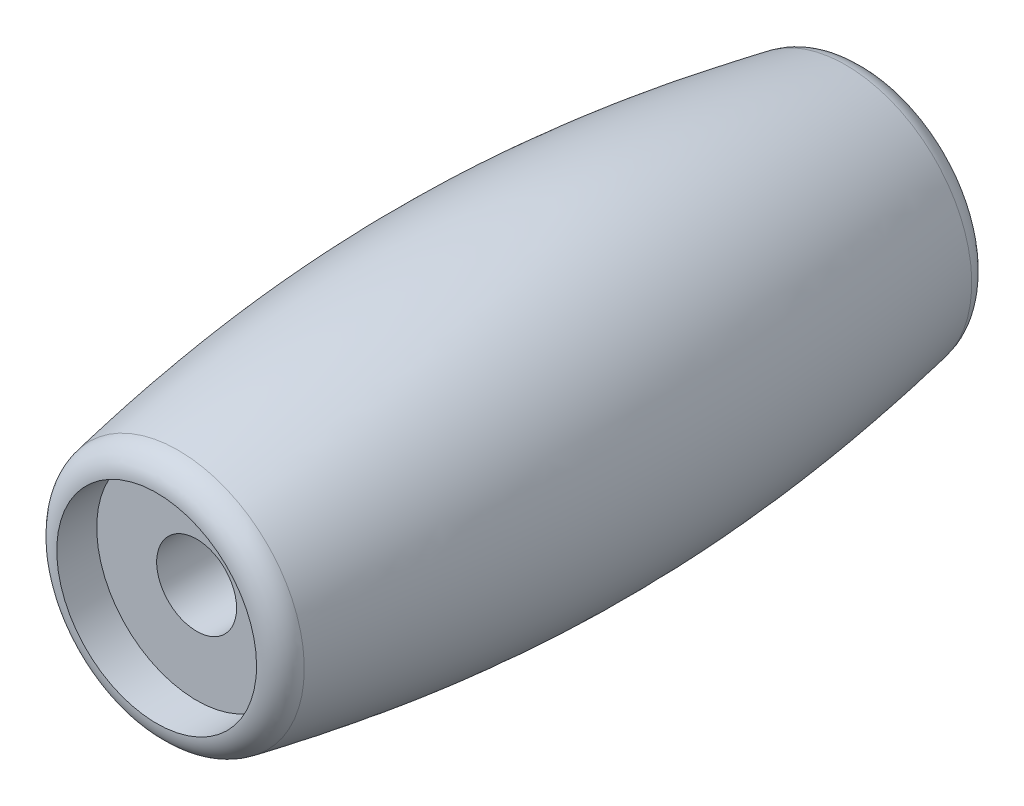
ISO-10303-21;
HEADER;
FILE_DESCRIPTION(('STEP AP214'),'2;1');
FILE_NAME('part.step','',(''),(''),'','','');
FILE_SCHEMA(('AUTOMOTIVE_DESIGN { 1 0 10303 214 1 1 1 1 }'));
ENDSEC;
DATA;
#1=APPLICATION_CONTEXT('core data for automotive mechanical design processes');
#2=APPLICATION_PROTOCOL_DEFINITION('international standard','automotive_design',2000,#1);
#3=PRODUCT_CONTEXT('',#1,'mechanical');
#4=PRODUCT('Part','Part','',(#3));
#5=PRODUCT_RELATED_PRODUCT_CATEGORY('part','',(#4));
#6=PRODUCT_DEFINITION_FORMATION('','',#4);
#7=PRODUCT_DEFINITION_CONTEXT('part definition',#1,'design');
#8=PRODUCT_DEFINITION('design','',#6,#7);
#9=PRODUCT_DEFINITION_SHAPE('','',#8);
#10=(LENGTH_UNIT() NAMED_UNIT(*) SI_UNIT(.MILLI.,.METRE.));
#11=(NAMED_UNIT(*) PLANE_ANGLE_UNIT() SI_UNIT($,.RADIAN.));
#12=(NAMED_UNIT(*) SI_UNIT($,.STERADIAN.) SOLID_ANGLE_UNIT());
#13=UNCERTAINTY_MEASURE_WITH_UNIT(LENGTH_MEASURE(1.E-05),#10,'distance_accuracy_value','');
#14=(GEOMETRIC_REPRESENTATION_CONTEXT(3) GLOBAL_UNCERTAINTY_ASSIGNED_CONTEXT((#13)) GLOBAL_UNIT_ASSIGNED_CONTEXT((#10,
#11,#12)) REPRESENTATION_CONTEXT('',''));
#15=CARTESIAN_POINT('',(0.,0.,0.));
#16=DIRECTION('',(0.,0.,1.));
#17=DIRECTION('',(1.,0.,0.));
#18=AXIS2_PLACEMENT_3D('',#15,#16,#17);
#19=CARTESIAN_POINT('',(3.84249790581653,2.75723384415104,-12.5289580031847));
#20=CARTESIAN_POINT('',(3.71572375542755,2.66621518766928,-13.34));
#21=CARTESIAN_POINT('',(3.04481197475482,2.18452796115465,-13.34));
#22=CARTESIAN_POINT('',(3.91987334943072,2.64947680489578,-12.5289389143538));
#23=CARTESIAN_POINT('',(3.79057007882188,2.5620018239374,-13.34));
#24=CARTESIAN_POINT('',(3.10620330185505,2.09902282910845,-13.34));
#25=CARTESIAN_POINT('',(3.99278868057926,2.53842683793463,-12.5289288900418));
#26=CARTESIAN_POINT('',(3.8610908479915,2.45460833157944,-13.34));
#27=CARTESIAN_POINT('',(3.16402011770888,2.01094758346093,-13.34));
#28=CARTESIAN_POINT('',(4.12919436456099,2.31003982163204,-12.5289701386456));
#29=CARTESIAN_POINT('',(3.99295219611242,2.23377884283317,-13.34));
#30=CARTESIAN_POINT('',(3.27197937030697,1.8302198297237,-13.34));
#31=CARTESIAN_POINT('',(4.19268548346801,2.19270328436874,-12.5290214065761));
#32=CARTESIAN_POINT('',(4.05429028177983,2.12034913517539,-13.34));
#33=CARTESIAN_POINT('',(3.32212243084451,1.73756769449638,-13.34));
#34=CARTESIAN_POINT('',(4.30926285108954,1.95352732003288,-12.5290650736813));
#35=CARTESIAN_POINT('',(4.16696821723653,1.88910348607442,-13.34));
#36=CARTESIAN_POINT('',(3.41435086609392,1.54834407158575,-13.34));
#37=CARTESIAN_POINT('',(4.36234954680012,1.8316880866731,-12.5290574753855));
#38=CARTESIAN_POINT('',(4.21831146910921,1.77128209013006,-13.34));
#39=CARTESIAN_POINT('',(3.45643658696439,1.45177275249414,-13.34));
#40=CARTESIAN_POINT('',(4.45810663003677,1.58418674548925,-12.5290219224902));
#41=CARTESIAN_POINT('',(4.31094387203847,1.5319244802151,-13.34));
#42=CARTESIAN_POINT('',(3.53239279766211,1.25544189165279,-13.34));
#43=CARTESIAN_POINT('',(4.5007758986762,1.45852422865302,-12.5289939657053));
#44=CARTESIAN_POINT('',(4.352232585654,1.41038576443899,-13.34));
#45=CARTESIAN_POINT('',(3.56626240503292,1.15568200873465,-13.34));
#46=CARTESIAN_POINT('',(4.5755186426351,1.20395440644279,-12.5289456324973));
#47=CARTESIAN_POINT('',(4.42455603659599,1.16417069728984,-13.34));
#48=CARTESIAN_POINT('',(3.62558092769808,0.953619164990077,-13.34));
#49=CARTESIAN_POINT('',(4.60758492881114,1.07504496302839,-12.5289252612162));
#50=CARTESIAN_POINT('',(4.45558337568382,1.03949300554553,-13.34));
#51=CARTESIAN_POINT('',(3.65102412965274,0.851314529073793,-13.34));
#52=CARTESIAN_POINT('',(4.66083040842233,0.814703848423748,-12.5289169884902));
#53=CARTESIAN_POINT('',(4.50708074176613,0.787726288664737,-13.34));
#54=CARTESIAN_POINT('',(3.69323269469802,0.644925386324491,-13.34));
#55=CARTESIAN_POINT('',(4.68201085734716,0.683272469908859,-12.5289290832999));
#56=CARTESIAN_POINT('',(4.52755124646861,0.660640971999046,-13.34));
#57=CARTESIAN_POINT('',(3.7099990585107,0.540841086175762,-13.34));
#58=CARTESIAN_POINT('',(4.70533297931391,0.484718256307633,-12.5289925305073));
#59=CARTESIAN_POINT('',(4.55005398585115,0.468701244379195,-13.34));
#60=CARTESIAN_POINT('',(3.72843974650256,0.38395076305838,-13.34));
#61=CARTESIAN_POINT('',(4.71169918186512,0.418291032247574,-12.5290212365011));
#62=CARTESIAN_POINT('',(4.5561877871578,0.404497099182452,-13.34));
#63=CARTESIAN_POINT('',(3.73346869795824,0.331520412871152,-13.34));
#64=CARTESIAN_POINT('',(4.72158117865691,0.285389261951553,-12.5290593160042));
#65=CARTESIAN_POINT('',(4.56571458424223,0.276025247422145,-13.34));
#66=CARTESIAN_POINT('',(3.74128257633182,0.226492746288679,-13.34));
#67=CARTESIAN_POINT('',(4.72509695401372,0.218914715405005,-12.5290686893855));
#68=CARTESIAN_POINT('',(4.56910768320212,0.211756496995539,-13.34));
#69=CARTESIAN_POINT('',(3.74406748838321,0.173895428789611,-13.34));
#70=CARTESIAN_POINT('',(4.73142715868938,0.0194967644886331,-12.5290803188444));
#71=CARTESIAN_POINT('',(4.57522064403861,0.0189396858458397,-13.34));
#72=CARTESIAN_POINT('',(3.74908228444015,0.015992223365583,-13.34));
#73=CARTESIAN_POINT('',(4.73002649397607,-0.113458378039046,-12.529066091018));
#74=CARTESIAN_POINT('',(4.57387627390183,-0.109639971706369,-13.34));
#75=CARTESIAN_POINT('',(3.74797383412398,-0.0894386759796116,-13.34));
#76=CARTESIAN_POINT('',(4.71615290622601,-0.378365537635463,-12.5290219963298));
#77=CARTESIAN_POINT('',(4.5604876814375,-0.365850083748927,-13.34));
#78=CARTESIAN_POINT('',(3.73695810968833,-0.299634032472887,-13.34));
#79=CARTESIAN_POINT('',(4.70369947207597,-0.510318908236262,-12.5289921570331));
#80=CARTESIAN_POINT('',(4.54846200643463,-0.493483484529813,-13.34));
#81=CARTESIAN_POINT('',(3.72706632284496,-0.404399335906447,-13.34));
#82=CARTESIAN_POINT('',(4.66781137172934,-0.772860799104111,-12.528948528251));
#83=CARTESIAN_POINT('',(4.51378029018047,-0.747417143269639,-13.34));
#84=CARTESIAN_POINT('',(3.69857964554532,-0.612752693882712,-13.34));
#85=CARTESIAN_POINT('',(4.64437742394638,-0.903449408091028,-12.5289347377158));
#86=CARTESIAN_POINT('',(4.49112498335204,-0.873715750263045,-13.34));
#87=CARTESIAN_POINT('',(3.67998532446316,-0.716340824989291,-13.34));
#88=CARTESIAN_POINT('',(4.60099899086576,-1.09771392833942,-12.5289410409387));
#89=CARTESIAN_POINT('',(4.44917422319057,-1.06156666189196,-13.34));
#90=CARTESIAN_POINT('',(3.64561780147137,-0.870252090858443,-13.34));
#91=CARTESIAN_POINT('',(4.58516535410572,-1.16220831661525,-12.5289476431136));
#92=CARTESIAN_POINT('',(4.43386003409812,-1.12392564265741,-13.34));
#93=CARTESIAN_POINT('',(3.6330803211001,-0.921318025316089,-13.34));
#94=CARTESIAN_POINT('',(4.55071959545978,-1.29063533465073,-12.528979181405));
#95=CARTESIAN_POINT('',(4.4005394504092,-1.24807666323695,-13.34));
#96=CARTESIAN_POINT('',(3.60584772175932,-1.02287465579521,-13.34));
#97=CARTESIAN_POINT('',(4.53210749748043,-1.35456796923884,-12.5290041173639));
#98=CARTESIAN_POINT('',(4.38253337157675,-1.3098677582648,-13.34));
#99=CARTESIAN_POINT('',(3.5911526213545,-1.07336535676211,-13.34));
#100=CARTESIAN_POINT('',(4.49219562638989,-1.48150116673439,-12.5290434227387));
#101=CARTESIAN_POINT('',(4.34392729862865,-1.43255989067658,-13.34));
#102=CARTESIAN_POINT('',(3.55961821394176,-1.17367337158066,-13.34));
#103=CARTESIAN_POINT('',(4.47089581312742,-1.54450171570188,-12.5290577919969));
#104=CARTESIAN_POINT('',(4.32332713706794,-1.49346147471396,-13.34));
#105=CARTESIAN_POINT('',(3.54277887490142,-1.22349067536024,-13.34));
#106=CARTESIAN_POINT('',(4.42570031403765,-1.66942915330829,-12.5290725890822));
#107=CARTESIAN_POINT('',(4.27962094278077,-1.61424309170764,-13.34));
#108=CARTESIAN_POINT('',(3.50701069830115,-1.32236612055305,-13.34));
#109=CARTESIAN_POINT('',(4.40180460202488,-1.73135603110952,-12.5290730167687));
#110=CARTESIAN_POINT('',(4.25651464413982,-1.67412382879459,-13.34));
#111=CARTESIAN_POINT('',(3.48808183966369,-1.37142425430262,-13.34));
#112=CARTESIAN_POINT('',(4.32623380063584,-1.91559779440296,-12.5290619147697));
#113=CARTESIAN_POINT('',(4.18344225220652,-1.85229387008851,-13.34));
#114=CARTESIAN_POINT('',(3.42817922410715,-1.51746119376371,-13.34));
#115=CARTESIAN_POINT('',(4.27071727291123,-2.03623995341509,-12.5290379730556));
#116=CARTESIAN_POINT('',(4.12976263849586,-1.96898349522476,-13.34));
#117=CARTESIAN_POINT('',(3.38412279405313,-1.6131966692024,-13.34));
#118=CARTESIAN_POINT('',(4.14984362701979,-2.27241603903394,-12.5289876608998));
#119=CARTESIAN_POINT('',(4.01288310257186,-2.19742996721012,-13.34));
#120=CARTESIAN_POINT('',(3.28817986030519,-1.80064664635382,-13.34));
#121=CARTESIAN_POINT('',(4.08448616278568,-2.38794978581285,-12.5289612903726));
#122=CARTESIAN_POINT('',(3.94968252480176,-2.3091867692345,-13.34));
#123=CARTESIAN_POINT('',(3.23629308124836,-1.89236100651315,-13.34));
#124=CARTESIAN_POINT('',(3.94425100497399,-2.61330427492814,-12.5289292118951));
#125=CARTESIAN_POINT('',(3.81407094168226,-2.5271509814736,-13.34));
#126=CARTESIAN_POINT('',(3.12502972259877,-2.07114158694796,-13.34));
#127=CARTESIAN_POINT('',(3.86937289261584,-2.72312476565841,-12.528923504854));
#128=CARTESIAN_POINT('',(3.74166058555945,-2.63335617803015,-13.34));
#129=CARTESIAN_POINT('',(3.06565281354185,-2.15820760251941,-13.34));
#130=CARTESIAN_POINT('',(3.71017075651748,-2.93645002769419,-12.5289749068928));
#131=CARTESIAN_POINT('',(3.58771617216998,-2.83958111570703,-13.34));
#132=CARTESIAN_POINT('',(2.93972330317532,-2.32697825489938,-13.34));
#133=CARTESIAN_POINT('',(3.62584747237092,-3.03995529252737,-12.5290320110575));
#134=CARTESIAN_POINT('',(3.50618709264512,-2.93959602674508,-13.34));
#135=CARTESIAN_POINT('',(2.87317126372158,-2.40868331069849,-13.34));
#136=CARTESIAN_POINT('',(3.44897595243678,-3.2391371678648,-12.5290825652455));
#137=CARTESIAN_POINT('',(3.33516991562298,-3.13213181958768,-13.34));
#138=CARTESIAN_POINT('',(2.73327657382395,-2.56622260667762,-13.34));
#139=CARTESIAN_POINT('',(3.35641830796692,-3.3348045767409,-12.5290759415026));
#140=CARTESIAN_POINT('',(3.24566828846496,-3.22464922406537,-13.34));
#141=CARTESIAN_POINT('',(2.65992615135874,-2.64204994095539,-13.34));
#142=CARTESIAN_POINT('',(3.16378208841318,-3.51793180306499,-12.5290411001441));
#143=CARTESIAN_POINT('',(3.05938237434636,-3.40177263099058,-13.34));
#144=CARTESIAN_POINT('',(2.50712708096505,-2.78730305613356,-13.34));
#145=CARTESIAN_POINT('',(3.06370269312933,-3.60539072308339,-12.5290128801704));
#146=CARTESIAN_POINT('',(2.96259549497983,-3.48637926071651,-13.34));
#147=CARTESIAN_POINT('',(2.42767776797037,-2.85672813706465,-13.34));
#148=CARTESIAN_POINT('',(2.85656705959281,-3.77166021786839,-12.5289625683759));
#149=CARTESIAN_POINT('',(2.76227150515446,-3.64722408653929,-13.34));
#150=CARTESIAN_POINT('',(2.2632584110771,-2.98869833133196,-13.34));
#151=CARTESIAN_POINT('',(2.74951068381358,-3.85047062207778,-12.528940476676));
#152=CARTESIAN_POINT('',(2.6587346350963,-3.72346152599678,-13.34));
#153=CARTESIAN_POINT('',(2.17828825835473,-3.05124330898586,-13.34));
#154=CARTESIAN_POINT('',(2.52890948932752,-3.99897607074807,-12.5289292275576));
#155=CARTESIAN_POINT('',(2.44540080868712,-3.86708371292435,-13.34));
#156=CARTESIAN_POINT('',(2.00339096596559,-3.1689784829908,-13.34));
#157=CARTESIAN_POINT('',(2.41536542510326,-4.06867217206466,-12.5289400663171));
#158=CARTESIAN_POINT('',(2.33560750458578,-3.93446745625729,-13.34));
#159=CARTESIAN_POINT('',(1.91346440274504,-3.2241695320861,-13.34));
#160=CARTESIAN_POINT('',(2.24043758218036,-4.16598253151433,-12.5289996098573));
#161=CARTESIAN_POINT('',(2.16648904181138,-4.02850084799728,-13.34));
#162=CARTESIAN_POINT('',(1.77522530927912,-3.30108358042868,-13.34));
#163=CARTESIAN_POINT('',(2.18129656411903,-4.19724205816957,-12.5290267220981));
#164=CARTESIAN_POINT('',(2.10931890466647,-4.05869807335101,-13.34));
#165=CARTESIAN_POINT('',(1.72853773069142,-3.32576516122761,-13.34));
#166=CARTESIAN_POINT('',(2.06188349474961,-4.25713271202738,-12.5290613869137));
#167=CARTESIAN_POINT('',(1.99387399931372,-4.11657228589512,-13.34));
#168=CARTESIAN_POINT('',(1.63414970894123,-3.3731090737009,-13.34));
#169=CARTESIAN_POINT('',(2.00161143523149,-4.28576382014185,-12.5290689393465));
#170=CARTESIAN_POINT('',(1.93559828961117,-4.14424976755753,-13.34));
#171=CARTESIAN_POINT('',(1.58644925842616,-3.39577139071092,-13.34));
#172=CARTESIAN_POINT('',(1.81917983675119,-4.36774281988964,-12.5290761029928));
#173=CARTESIAN_POINT('',(1.75919893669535,-4.22351292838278,-13.34));
#174=CARTESIAN_POINT('',(1.44196695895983,-3.46069918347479,-13.34));
#175=CARTESIAN_POINT('',(1.69538995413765,-4.41718466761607,-12.5290602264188));
#176=CARTESIAN_POINT('',(1.63948522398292,-4.27133885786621,-13.34));
#177=CARTESIAN_POINT('',(1.343792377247,-3.49991204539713,-13.34));
#178=CARTESIAN_POINT('',(1.44427603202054,-4.50547688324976,-12.5290144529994));
#179=CARTESIAN_POINT('',(1.39662463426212,-4.35676160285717,-13.34));
#180=CARTESIAN_POINT('',(1.14452438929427,-3.5699668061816,-13.34));
#181=CARTESIAN_POINT('',(1.31695210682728,-4.5443275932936,-12.5289845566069));
#182=CARTESIAN_POINT('',(1.27347637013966,-4.39435905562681,-13.34));
#183=CARTESIAN_POINT('',(1.04343107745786,-3.60080897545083,-13.34));
#184=CARTESIAN_POINT('',(1.05935146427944,-4.61126026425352,-12.5289424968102));
#185=CARTESIAN_POINT('',(1.0243339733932,-4.45912332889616,-13.34));
#186=CARTESIAN_POINT('',(0.839004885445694,-3.65391962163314,-13.34));
#187=CARTESIAN_POINT('',(0.929074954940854,-4.63934298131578,-12.5289303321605));
#188=CARTESIAN_POINT('',(0.898341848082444,-4.48629021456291,-13.34));
#189=CARTESIAN_POINT('',(0.735672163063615,-3.67618870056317,-13.34));
#190=CARTESIAN_POINT('',(0.732082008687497,-4.67315153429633,-12.5289400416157));
#191=CARTESIAN_POINT('',(0.707853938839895,-4.51897559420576,-13.34));
#192=CARTESIAN_POINT('',(0.579621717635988,-3.7029711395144,-13.34));
#193=CARTESIAN_POINT('',(0.666183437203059,-4.6830326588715,-12.5289479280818));
#194=CARTESIAN_POINT('',(0.644136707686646,-4.52852403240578,-13.34));
#195=CARTESIAN_POINT('',(0.52745241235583,-3.71079314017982,-13.34));
#196=CARTESIAN_POINT('',(0.533847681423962,-4.69998857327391,-12.5289823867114));
#197=CARTESIAN_POINT('',(0.516201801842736,-4.54489301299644,-13.34));
#198=CARTESIAN_POINT('',(0.422827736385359,-3.7242052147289,-13.34));
#199=CARTESIAN_POINT('',(0.467410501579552,-4.7070633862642,-12.5290089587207));
#200=CARTESIAN_POINT('',(0.451985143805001,-4.55171348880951,-13.34));
#201=CARTESIAN_POINT('',(0.370372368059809,-3.72979530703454,-13.34));
#202=CARTESIAN_POINT('',(0.267918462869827,-4.72400043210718,-12.5290670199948));
#203=CARTESIAN_POINT('',(0.259143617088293,-4.56804648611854,-13.34));
#204=CARTESIAN_POINT('',(0.212721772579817,-3.74318692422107,-13.34));
#205=CARTESIAN_POINT('',(0.134656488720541,-4.72957983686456,-12.5290768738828));
#206=CARTESIAN_POINT('',(0.130293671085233,-4.57343585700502,-13.34));
#207=CARTESIAN_POINT('',(0.107221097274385,-3.74761339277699,-13.34));
#208=CARTESIAN_POINT('',(-0.131501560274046,-4.72954012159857,-12.5290612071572));
#209=CARTESIAN_POINT('',(-0.127089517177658,-4.57340795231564,-13.34));
#210=CARTESIAN_POINT('',(-0.103751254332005,-3.74757899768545,-13.34));
#211=CARTESIAN_POINT('',(-0.264397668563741,-4.72392206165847,-12.5290356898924));
#212=CARTESIAN_POINT('',(-0.25562661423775,-4.56799162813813,-13.34));
#213=CARTESIAN_POINT('',(-0.209222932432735,-3.74311897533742,-13.34));
#214=CARTESIAN_POINT('',(-0.529230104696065,-4.70160350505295,-12.5289839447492));
#215=CARTESIAN_POINT('',(-0.511778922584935,-4.54643961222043,-13.34));
#216=CARTESIAN_POINT('',(-0.419430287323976,-3.72539750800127,-13.34));
#217=CARTESIAN_POINT('',(-0.661166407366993,-4.68490271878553,-12.5289577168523));
#218=CARTESIAN_POINT('',(-0.639394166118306,-4.53030340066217,-13.34));
#219=CARTESIAN_POINT('',(-0.524165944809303,-3.71213583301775,-13.34));
#220=CARTESIAN_POINT('',(-0.923164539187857,-4.64051218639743,-12.528927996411));
#221=CARTESIAN_POINT('',(-0.892788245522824,-4.48739037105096,-13.34));
#222=CARTESIAN_POINT('',(-0.732004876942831,-3.67691306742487,-13.34));
#223=CARTESIAN_POINT('',(-1.05322887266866,-4.61283888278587,-12.5289244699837));
#224=CARTESIAN_POINT('',(-1.0185671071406,-4.46062974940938,-13.34));
#225=CARTESIAN_POINT('',(-0.835110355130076,-3.6549649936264,-13.34));
#226=CARTESIAN_POINT('',(-1.31107610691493,-4.54634384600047,-12.5289782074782));
#227=CARTESIAN_POINT('',(-1.2678444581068,-4.39630901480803,-13.34));
#228=CARTESIAN_POINT('',(-1.03907832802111,-3.60238294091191,-13.34));
#229=CARTESIAN_POINT('',(-1.43885916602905,-4.50752288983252,-12.5290354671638));
#230=CARTESIAN_POINT('',(-1.39133678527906,-4.35875154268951,-13.34));
#231=CARTESIAN_POINT('',(-1.13994097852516,-3.57174956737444,-13.34));
#232=CARTESIAN_POINT('',(-1.69015178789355,-4.41935802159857,-12.5290837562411));
#233=CARTESIAN_POINT('',(-1.6342650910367,-4.27348527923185,-13.34));
#234=CARTESIAN_POINT('',(-1.33871095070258,-3.50200992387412,-13.34));
#235=CARTESIAN_POINT('',(-1.81366053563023,-4.37001211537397,-12.5290747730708));
#236=CARTESIAN_POINT('',(-1.75370714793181,-4.22577239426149,-13.34));
#237=CARTESIAN_POINT('',(-1.43661770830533,-3.46290204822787,-13.34));
#238=CARTESIAN_POINT('',(-2.05596080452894,-4.26125799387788,-12.5290379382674));
#239=CARTESIAN_POINT('',(-1.98805372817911,-4.12061602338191,-13.34));
#240=CARTESIAN_POINT('',(-1.62882302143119,-3.37663026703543,-13.34));
#241=CARTESIAN_POINT('',(-2.17475192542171,-4.20184892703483,-12.529010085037));
#242=CARTESIAN_POINT('',(-2.10295965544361,-4.06317072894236,-13.34));
#243=CARTESIAN_POINT('',(-1.7231212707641,-3.3294656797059,-13.34));
#244=CARTESIAN_POINT('',(-2.40692074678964,-4.07334302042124,-12.5289608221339));
#245=CARTESIAN_POINT('',(-2.32753251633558,-3.93890670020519,-13.34));
#246=CARTESIAN_POINT('',(-1.9073978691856,-3.22745825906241,-13.34));
#247=CARTESIAN_POINT('',(-2.5203013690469,-4.0042514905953,-12.5289394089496));
#248=CARTESIAN_POINT('',(-2.4372015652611,-3.87209324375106,-13.34));
#249=CARTESIAN_POINT('',(-1.9973785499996,-3.17261963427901,-13.34));
#250=CARTESIAN_POINT('',(-2.74112900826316,-3.85660493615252,-12.5289319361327));
#251=CARTESIAN_POINT('',(-2.6507580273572,-3.72931435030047,-13.34));
#252=CARTESIAN_POINT('',(-2.17243159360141,-3.05557684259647,-13.34));
#253=CARTESIAN_POINT('',(-2.84857624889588,-3.77805026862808,-12.5289458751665));
#254=CARTESIAN_POINT('',(-2.75464246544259,-3.65335135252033,-13.34));
#255=CARTESIAN_POINT('',(-2.25750414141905,-2.99337295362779,-13.34));
#256=CARTESIAN_POINT('',(-3.00463080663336,-3.65336431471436,-12.5290050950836));
#257=CARTESIAN_POINT('',(-2.90547224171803,-3.53278949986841,-13.34));
#258=CARTESIAN_POINT('',(-2.38083880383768,-2.89484410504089,-13.34));
#259=CARTESIAN_POINT('',(-3.05577705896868,-3.61067823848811,-12.5290312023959));
#260=CARTESIAN_POINT('',(-2.95489606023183,-3.49151814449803,-13.34));
#261=CARTESIAN_POINT('',(-2.42122287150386,-2.86114501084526,-13.34));
#262=CARTESIAN_POINT('',(-3.15607958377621,-3.52328661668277,-12.5290631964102));
#263=CARTESIAN_POINT('',(-3.05184421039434,-3.40702037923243,-13.34));
#264=CARTESIAN_POINT('',(-2.5005206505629,-2.79205897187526,-13.34));
#265=CARTESIAN_POINT('',(-3.20523588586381,-3.47858110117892,-12.5290690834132));
#266=CARTESIAN_POINT('',(-3.09936942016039,-3.36379330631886,-13.34));
#267=CARTESIAN_POINT('',(-2.53943438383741,-2.75667205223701,-13.34));
#268=CARTESIAN_POINT('',(-3.34969541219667,-3.34153863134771,-12.5290721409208));
#269=CARTESIAN_POINT('',(-3.23905256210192,-3.23127936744,-13.34));
#270=CARTESIAN_POINT('',(-2.65386385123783,-2.64811983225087,-13.34));
#271=CARTESIAN_POINT('',(-3.44203188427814,-3.24624161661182,-12.5290547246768));
#272=CARTESIAN_POINT('',(-3.32836159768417,-3.13912448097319,-13.34));
#273=CARTESIAN_POINT('',(-2.72710154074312,-2.57253611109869,-13.34));
#274=CARTESIAN_POINT('',(-3.64140212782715,-3.02251979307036,-12.5290011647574));
#275=CARTESIAN_POINT('',(-3.52121538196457,-2.92276858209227,-13.34));
#276=CARTESIAN_POINT('',(-2.88530595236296,-2.39499242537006,-13.34));
#277=CARTESIAN_POINT('',(-3.74597884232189,-2.89194184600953,-12.528961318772));
#278=CARTESIAN_POINT('',(-3.62238961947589,-2.79648128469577,-13.34));
#279=CARTESIAN_POINT('',(-2.96834255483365,-2.29129827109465,-13.34));
#280=CARTESIAN_POINT('',(-3.89218762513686,-2.68823102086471,-12.5289321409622));
#281=CARTESIAN_POINT('',(-3.76381140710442,-2.59947426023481,-13.34));
#282=CARTESIAN_POINT('',(-3.08432685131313,-2.12969498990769,-13.34));
#283=CARTESIAN_POINT('',(-3.93915242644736,-2.6190120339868,-12.5289275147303));
#284=CARTESIAN_POINT('',(-3.80923280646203,-2.53253518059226,-13.34));
#285=CARTESIAN_POINT('',(-3.12156348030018,-2.07481050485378,-13.34));
#286=CARTESIAN_POINT('',(-4.02942277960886,-2.47804816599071,-12.5289322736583));
#287=CARTESIAN_POINT('',(-3.89652080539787,-2.39622223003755,-13.34));
#288=CARTESIAN_POINT('',(-3.19308423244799,-1.96312466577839,-13.34));
#289=CARTESIAN_POINT('',(-4.07272764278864,-2.40630281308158,-12.5289416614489));
#290=CARTESIAN_POINT('',(-3.93838622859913,-2.32684871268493,-13.34));
#291=CARTESIAN_POINT('',(-3.22736779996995,-1.90632295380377,-13.34));
#292=CARTESIAN_POINT('',(-4.14693499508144,-2.27552111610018,-12.5289835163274));
#293=CARTESIAN_POINT('',(-4.01009832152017,-2.20040828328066,-13.34));
#294=CARTESIAN_POINT('',(-3.2860321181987,-1.80295037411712,-13.34));
#295=CARTESIAN_POINT('',(-4.17854489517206,-2.21694144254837,-12.5290107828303));
#296=CARTESIAN_POINT('',(-4.04063423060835,-2.14378041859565,-13.34));
#297=CARTESIAN_POINT('',(-3.31099038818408,-1.7567059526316,-13.34));
#298=CARTESIAN_POINT('',(-4.23918077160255,-2.09860623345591,-12.5290494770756));
#299=CARTESIAN_POINT('',(-4.09922481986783,-2.02937950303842,-13.34));
#300=CARTESIAN_POINT('',(-3.35891226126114,-1.66319383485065,-13.34));
#301=CARTESIAN_POINT('',(-4.26820657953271,-2.03885062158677,-12.5290609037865));
#302=CARTESIAN_POINT('',(-4.12727976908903,-1.97160563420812,-13.34));
#303=CARTESIAN_POINT('',(-3.38187573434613,-1.61592607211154,-13.34));
#304=CARTESIAN_POINT('',(-4.35141679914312,-1.85794238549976,-12.5290774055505));
#305=CARTESIAN_POINT('',(-4.20772339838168,-1.79668583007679,-13.34));
#306=CARTESIAN_POINT('',(-3.44775306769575,-1.47270769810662,-13.34));
#307=CARTESIAN_POINT('',(-4.40172958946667,-1.73515616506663,-12.529064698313));
#308=CARTESIAN_POINT('',(-4.2563886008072,-1.6779449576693,-13.34));
#309=CARTESIAN_POINT('',(-3.48765035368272,-1.37534815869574,-13.34));
#310=CARTESIAN_POINT('',(-4.49193230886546,-1.4858652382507,-12.5290228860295));
#311=CARTESIAN_POINT('',(-4.34365532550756,-1.4368505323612,-13.34));
#312=CARTESIAN_POINT('',(-3.55921438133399,-1.17754899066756,-13.34));
#313=CARTESIAN_POINT('',(-4.53181067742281,-1.35935657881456,-12.5289937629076));
#314=CARTESIAN_POINT('',(-4.38224610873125,-1.31449141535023,-13.34));
#315=CARTESIAN_POINT('',(-3.59087199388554,-1.077106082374,-13.34));
#316=CARTESIAN_POINT('',(-4.60090083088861,-1.10334765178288,-12.528949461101));
#317=CARTESIAN_POINT('',(-4.44909917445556,-1.06688627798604,-13.34));
#318=CARTESIAN_POINT('',(-3.64569954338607,-0.873922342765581,-13.34));
#319=CARTESIAN_POINT('',(-4.63011383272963,-0.973847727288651,-12.5289342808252));
#320=CARTESIAN_POINT('',(-4.47736205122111,-0.941641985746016,-13.34));
#321=CARTESIAN_POINT('',(-3.66887044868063,-0.771181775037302,-13.34));
#322=CARTESIAN_POINT('',(-4.66571382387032,-0.777921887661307,-12.5289376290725));
#323=CARTESIAN_POINT('',(-4.51178539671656,-0.752178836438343,-13.34));
#324=CARTESIAN_POINT('',(-3.69708047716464,-0.615926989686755,-13.34));
#325=CARTESIAN_POINT('',(-4.67621026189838,-0.712337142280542,-12.5289430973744));
#326=CARTESIAN_POINT('',(-4.52193091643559,-0.68876215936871,-13.34));
#327=CARTESIAN_POINT('',(-3.70539252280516,-0.563987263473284,-13.34));
#328=CARTESIAN_POINT('',(-4.69442785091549,-0.580617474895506,-12.5289710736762));
#329=CARTESIAN_POINT('',(-4.53952494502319,-0.561415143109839,-13.34));
#330=CARTESIAN_POINT('',(-3.71980753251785,-0.459798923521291,-13.34));
#331=CARTESIAN_POINT('',(-4.70214902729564,-0.514482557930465,-12.5289935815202));
#332=CARTESIAN_POINT('',(-4.54697338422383,-0.4974857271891,-13.34));
#333=CARTESIAN_POINT('',(-3.72591051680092,-0.407550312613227,-13.34));
#334=CARTESIAN_POINT('',(-4.71475309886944,-0.381964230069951,-12.5290346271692));
#335=CARTESIAN_POINT('',(-4.5591296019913,-0.369385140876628,-13.34));
#336=CARTESIAN_POINT('',(-3.73587594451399,-0.302838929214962,-13.34));
#337=CARTESIAN_POINT('',(-4.71963594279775,-0.315580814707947,-12.5290531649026));
#338=CARTESIAN_POINT('',(-4.56383739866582,-0.305213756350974,-13.34));
#339=CARTESIAN_POINT('',(-3.73973834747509,-0.250376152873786,-13.34));
#340=CARTESIAN_POINT('',(-4.72658375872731,-0.18281665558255,-12.5290735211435));
#341=CARTESIAN_POINT('',(-4.57054080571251,-0.176857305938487,-13.34));
#342=CARTESIAN_POINT('',(-3.74523782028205,-0.145337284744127,-13.34));
#343=CARTESIAN_POINT('',(-4.72864870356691,-0.116435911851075,-12.52907533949));
#344=CARTESIAN_POINT('',(-4.57253646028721,-0.112671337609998,-13.34));
#345=CARTESIAN_POINT('',(-3.74687486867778,-0.0927611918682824,-13.34));
#346=CARTESIAN_POINT('',(-4.7306569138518,0.0825825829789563,-12.5290679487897));
#347=CARTESIAN_POINT('',(-4.57448338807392,0.0797809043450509,-13.34));
#348=CARTESIAN_POINT('',(-3.74846541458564,0.0649615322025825,-13.34));
#349=CARTESIAN_POINT('',(-4.72642055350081,0.215170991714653,-12.5290459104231));
#350=CARTESIAN_POINT('',(-4.57040134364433,0.208015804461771,-13.34));
#351=CARTESIAN_POINT('',(-3.74510386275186,0.170161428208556,-13.34));
#352=CARTESIAN_POINT('',(-4.70693016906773,0.47943394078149,-12.5289956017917));
#353=CARTESIAN_POINT('',(-4.55158386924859,0.463613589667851,-13.34));
#354=CARTESIAN_POINT('',(-3.72962694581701,0.379900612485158,-13.34));
#355=CARTESIAN_POINT('',(-4.69167566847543,0.611108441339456,-12.5289673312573));
#356=CARTESIAN_POINT('',(-4.53684770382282,0.590977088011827,-13.34));
#357=CARTESIAN_POINT('',(-3.71751120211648,0.484439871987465,-13.34));
#358=CARTESIAN_POINT('',(-4.65015565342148,0.873115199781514,-12.5289326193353));
#359=CARTESIAN_POINT('',(-4.49671391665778,0.844384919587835,-13.34));
#360=CARTESIAN_POINT('',(-3.68456381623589,0.692314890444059,-13.34));
#361=CARTESIAN_POINT('',(-4.6238738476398,1.00344517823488,-12.5289262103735));
#362=CARTESIAN_POINT('',(-4.47130073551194,0.970424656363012,-13.34));
#363=CARTESIAN_POINT('',(-3.66371927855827,0.795648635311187,-13.34));
#364=CARTESIAN_POINT('',(-4.57616972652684,1.19721572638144,-12.5289535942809));
#365=CARTESIAN_POINT('',(-4.42515921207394,1.1577714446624,-13.34));
#366=CARTESIAN_POINT('',(-3.62596535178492,0.949021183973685,-13.34));
#367=CARTESIAN_POINT('',(-4.55888657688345,1.26152306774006,-12.5289688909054));
#368=CARTESIAN_POINT('',(-4.40844060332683,1.2199379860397,-13.34));
#369=CARTESIAN_POINT('',(-3.61229830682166,0.999877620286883,-13.34));
#370=CARTESIAN_POINT('',(-4.52155042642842,1.389436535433,-12.5290095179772));
#371=CARTESIAN_POINT('',(-4.37232331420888,1.34357886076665,-13.34));
#372=CARTESIAN_POINT('',(-3.5828012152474,1.10095935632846,-13.34));
#373=CARTESIAN_POINT('',(-4.50149743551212,1.45304266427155,-12.5290348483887));
#374=CARTESIAN_POINT('',(-4.35292484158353,1.40505268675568,-13.34));
#375=CARTESIAN_POINT('',(-3.56697117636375,1.15118465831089,-13.34));
#376=CARTESIAN_POINT('',(-4.43739197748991,1.64226620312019,-12.5290831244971));
#377=CARTESIAN_POINT('',(-4.29092357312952,1.5879627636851,-13.34));
#378=CARTESIAN_POINT('',(-3.5162962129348,1.30077841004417,-13.34));
#379=CARTESIAN_POINT('',(-4.38938648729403,1.76631523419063,-12.5290783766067));
#380=CARTESIAN_POINT('',(-4.24450598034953,1.70792139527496,-13.34));
#381=CARTESIAN_POINT('',(-3.47826130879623,1.39908553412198,-13.34));
#382=CARTESIAN_POINT('',(-4.28326133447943,2.00976215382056,-12.5290466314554));
#383=CARTESIAN_POINT('',(-4.14189168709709,1.94336887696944,-13.34));
#384=CARTESIAN_POINT('',(-3.39409029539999,1.59216384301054,-13.34));
#385=CARTESIAN_POINT('',(-4.22514054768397,2.12915952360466,-12.5290196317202));
#386=CARTESIAN_POINT('',(-4.08569280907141,2.05885937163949,-13.34));
#387=CARTESIAN_POINT('',(-3.34795328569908,1.68693463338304,-13.34));
#388=CARTESIAN_POINT('',(-4.09919469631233,2.3625902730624,-12.5289694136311));
#389=CARTESIAN_POINT('',(-3.96390582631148,2.28465277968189,-13.34));
#390=CARTESIAN_POINT('',(-3.24797846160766,1.87221362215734,-13.34));
#391=CARTESIAN_POINT('',(-4.03137837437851,2.47662836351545,-12.5289461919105));
#392=CARTESIAN_POINT('',(-3.89832617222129,2.39495978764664,-13.34));
#393=CARTESIAN_POINT('',(-3.19414758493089,1.9627255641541,-13.34));
#394=CARTESIAN_POINT('',(-3.88629233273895,2.69882536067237,-12.528927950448));
#395=CARTESIAN_POINT('',(-3.75802297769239,2.60985392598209,-13.34));
#396=CARTESIAN_POINT('',(-3.07909069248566,2.13892505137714,-13.34));
#397=CARTESIAN_POINT('',(-3.80902370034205,2.80698494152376,-12.5289329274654));
#398=CARTESIAN_POINT('',(-3.68330208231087,2.71443912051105,-13.34));
#399=CARTESIAN_POINT('',(-3.01786552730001,2.22461314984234,-13.34));
#400=CARTESIAN_POINT('',(-3.68614201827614,2.9643283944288,-12.528989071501));
#401=CARTESIAN_POINT('',(-3.56448267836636,2.86652056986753,-13.34));
#402=CARTESIAN_POINT('',(-2.9207448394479,2.3489895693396,-13.34));
#403=CARTESIAN_POINT('',(-3.64401291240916,3.01596607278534,-12.5290159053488));
#404=CARTESIAN_POINT('',(-3.52374927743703,2.91641903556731,-13.34));
#405=CARTESIAN_POINT('',(-2.88748651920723,2.38976035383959,-13.34));
#406=CARTESIAN_POINT('',(-3.55767967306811,3.1172951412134,-12.5290533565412));
#407=CARTESIAN_POINT('',(-3.44027501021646,3.01435355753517,-13.34));
#408=CARTESIAN_POINT('',(-2.8192597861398,2.46984499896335,-13.34));
#409=CARTESIAN_POINT('',(-3.51347552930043,3.1669865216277,-12.5290639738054));
#410=CARTESIAN_POINT('',(-3.39753359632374,3.06239030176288,-13.34));
#411=CARTESIAN_POINT('',(-2.78429136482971,2.509158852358,-13.34));
#412=CARTESIAN_POINT('',(-3.37788028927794,3.31308912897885,-12.5290783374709));
#413=CARTESIAN_POINT('',(-3.26642187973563,3.20364784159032,-13.34));
#414=CARTESIAN_POINT('',(-2.67693790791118,2.62483471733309,-13.34));
#415=CARTESIAN_POINT('',(-3.2834952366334,3.40654306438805,-12.5290646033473));
#416=CARTESIAN_POINT('',(-3.1751502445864,3.29403306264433,-13.34));
#417=CARTESIAN_POINT('',(-2.60209588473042,2.69894227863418,-13.34));
#418=CARTESIAN_POINT('',(-3.08740331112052,3.58512277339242,-12.5290212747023));
#419=CARTESIAN_POINT('',(-2.98551713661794,3.46677002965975,-13.34));
#420=CARTESIAN_POINT('',(-2.44650080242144,2.84063235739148,-13.34));
#421=CARTESIAN_POINT('',(-2.98569667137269,3.67024881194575,-12.5289916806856));
#422=CARTESIAN_POINT('',(-2.88715449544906,3.54912303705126,-13.34));
#423=CARTESIAN_POINT('',(-2.3657479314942,2.90821508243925,-13.34));
#424=CARTESIAN_POINT('',(-2.77543662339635,3.83179244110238,-12.5289471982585));
#425=CARTESIAN_POINT('',(-2.68380893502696,3.70539199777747,-13.34));
#426=CARTESIAN_POINT('',(-2.19887498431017,3.0364164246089,-13.34));
#427=CARTESIAN_POINT('',(-2.66688359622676,3.90821051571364,-12.5289323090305));
#428=CARTESIAN_POINT('',(-2.57882751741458,3.77930729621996,-13.34));
#429=CARTESIAN_POINT('',(-2.11275520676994,3.09703542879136,-13.34));
#430=CARTESIAN_POINT('',(-2.49934385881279,4.01589285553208,-12.5289364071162));
#431=CARTESIAN_POINT('',(-2.41681424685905,3.88343424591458,-13.34));
#432=CARTESIAN_POINT('',(-1.98000238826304,3.18235933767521,-13.34));
#433=CARTESIAN_POINT('',(-2.44270370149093,4.05063403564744,-12.5289421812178));
#434=CARTESIAN_POINT('',(-2.36204534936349,3.91702285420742,-13.34));
#435=CARTESIAN_POINT('',(-1.93514916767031,3.2098701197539,-13.34));
#436=CARTESIAN_POINT('',(-2.32785043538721,4.11775977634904,-12.5289712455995));
#437=CARTESIAN_POINT('',(-2.25099870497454,3.98190142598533,-13.34));
#438=CARTESIAN_POINT('',(-1.84431302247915,3.26296531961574,-13.34));
#439=CARTESIAN_POINT('',(-2.26963734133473,4.15014435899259,-12.5289945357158));
#440=CARTESIAN_POINT('',(-2.19472180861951,4.01319096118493,-13.34));
#441=CARTESIAN_POINT('',(-1.79833010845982,3.28854975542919,-13.34));
#442=CARTESIAN_POINT('',(-2.15191010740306,4.21237632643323,-12.5290357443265));
#443=CARTESIAN_POINT('',(-2.08090910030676,4.07332236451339,-13.34));
#444=CARTESIAN_POINT('',(-1.70531125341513,3.33772742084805,-13.34));
#445=CARTESIAN_POINT('',(-2.09239595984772,4.24222369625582,-12.5290536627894));
#446=CARTESIAN_POINT('',(-2.02337304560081,4.10216439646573,-13.34));
#447=CARTESIAN_POINT('',(-1.6582753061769,3.36132063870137,-13.34));
#448=CARTESIAN_POINT('',(-1.9722916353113,4.29931317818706,-12.5290732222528));
#449=CARTESIAN_POINT('',(-1.90725043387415,4.15734665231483,-13.34));
#450=CARTESIAN_POINT('',(-1.56324925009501,3.40649242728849,-13.34));
#451=CARTESIAN_POINT('',(-1.9117014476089,4.32655526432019,-12.5290748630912));
#452=CARTESIAN_POINT('',(-1.8486630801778,4.18368724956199,-13.34));
#453=CARTESIAN_POINT('',(-1.51525913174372,3.42807097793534,-13.34));
#454=CARTESIAN_POINT('',(-1.72833944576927,4.40440821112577,-12.5290669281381));
#455=CARTESIAN_POINT('',(-1.67135225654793,4.2589767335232,-13.34));
#456=CARTESIAN_POINT('',(-1.36994040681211,3.48977003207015,-13.34));
#457=CARTESIAN_POINT('',(-1.60401489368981,4.4511253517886,-12.5290444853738));
#458=CARTESIAN_POINT('',(-1.55111525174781,4.30417444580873,-13.34));
#459=CARTESIAN_POINT('',(-1.27129402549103,3.52683779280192,-13.34));
#460=CARTESIAN_POINT('',(-1.35199666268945,4.53400324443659,-12.5289938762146));
#461=CARTESIAN_POINT('',(-1.30737299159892,4.38436646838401,-13.34));
#462=CARTESIAN_POINT('',(-1.07126652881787,3.59260999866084,-13.34));
#463=CARTESIAN_POINT('',(-1.22430283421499,4.57016352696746,-12.5289657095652));
#464=CARTESIAN_POINT('',(-1.18386693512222,4.4193603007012,-13.34));
#465=CARTESIAN_POINT('',(-0.96988529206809,3.62131407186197,-13.34));
#466=CARTESIAN_POINT('',(-0.966134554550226,4.63172327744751,-12.5289314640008));
#467=CARTESIAN_POINT('',(-0.934180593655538,4.4789211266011,-13.34));
#468=CARTESIAN_POINT('',(-0.765054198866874,3.67014990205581,-13.34));
#469=CARTESIAN_POINT('',(-0.835659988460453,4.65712229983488,-12.5289253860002));
#470=CARTESIAN_POINT('',(-0.808002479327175,4.50348698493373,-13.34));
#471=CARTESIAN_POINT('',(-0.661604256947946,3.69028130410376,-13.34));
#472=CARTESIAN_POINT('',(-0.638374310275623,4.68691030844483,-12.5289542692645));
#473=CARTESIAN_POINT('',(-0.617251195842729,4.53226886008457,-13.34));
#474=CARTESIAN_POINT('',(-0.505460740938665,3.71386227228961,-13.34));
#475=CARTESIAN_POINT('',(-0.572345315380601,4.69545487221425,-12.5289702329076));
#476=CARTESIAN_POINT('',(-0.553416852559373,4.54051844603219,-13.34));
#477=CARTESIAN_POINT('',(-0.453247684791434,3.72062015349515,-13.34));
#478=CARTESIAN_POINT('',(-0.439889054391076,4.70971596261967,-12.5290110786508));
#479=CARTESIAN_POINT('',(-0.425374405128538,4.55427688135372,-13.34));
#480=CARTESIAN_POINT('',(-0.348580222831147,3.73189627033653,-13.34));
#481=CARTESIAN_POINT('',(-0.373461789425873,4.71543249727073,-12.5290359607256));
#482=CARTESIAN_POINT('',(-0.361166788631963,4.55978573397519,-13.34));
#483=CARTESIAN_POINT('',(-0.296125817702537,3.73641451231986,-13.34));
#484=CARTESIAN_POINT('',(-0.173959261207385,4.7283417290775,-12.5290831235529));
#485=CARTESIAN_POINT('',(-0.168306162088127,4.57223301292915,-13.34));
#486=CARTESIAN_POINT('',(-0.138399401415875,3.74662481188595,-13.34));
#487=CARTESIAN_POINT('',(-0.0408247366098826,4.73126979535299,-12.529077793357));
#488=CARTESIAN_POINT('',(-0.0395628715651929,4.57506950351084,-13.34));
#489=CARTESIAN_POINT('',(-0.0328912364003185,3.74895328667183,-13.34));
#490=CARTESIAN_POINT('',(0.225006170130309,4.72597642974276,-12.529045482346));
#491=CARTESIAN_POINT('',(0.217524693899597,4.56997234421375,-13.34));
#492=CARTESIAN_POINT('',(0.177944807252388,3.74475231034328,-13.34));
#493=CARTESIAN_POINT('',(0.357702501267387,4.71775374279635,-12.529018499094));
#494=CARTESIAN_POINT('',(0.345871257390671,4.56203728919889,-13.34));
#495=CARTESIAN_POINT('',(0.28327266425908,3.73822186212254,-13.34));
#496=CARTESIAN_POINT('',(0.621955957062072,4.69025220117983,-12.5289684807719));
#497=CARTESIAN_POINT('',(0.601463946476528,4.5354707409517,-13.34));
#498=CARTESIAN_POINT('',(0.493017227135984,3.71638523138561,-13.34));
#499=CARTESIAN_POINT('',(0.753513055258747,4.67097309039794,-12.5289454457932));
#500=CARTESIAN_POINT('',(0.728709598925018,4.51683881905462,-13.34));
#501=CARTESIAN_POINT('',(0.597433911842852,3.70107884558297,-13.34));
#502=CARTESIAN_POINT('',(1.01479221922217,4.62138389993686,-12.5289284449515));
#503=CARTESIAN_POINT('',(0.981394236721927,4.46889224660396,-13.34));
#504=CARTESIAN_POINT('',(0.804617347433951,3.6617524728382,-13.34));
#505=CARTESIAN_POINT('',(1.14451449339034,4.59107508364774,-12.52893447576));
#506=CARTESIAN_POINT('',(1.10683032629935,4.43957932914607,-13.34));
#507=CARTESIAN_POINT('',(0.907384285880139,3.63773348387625,-13.34));
#508=CARTESIAN_POINT('',(1.33731059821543,4.53723128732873,-12.5289908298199));
#509=CARTESIAN_POINT('',(1.29319650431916,4.38749246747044,-13.34));
#510=CARTESIAN_POINT('',(1.05977804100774,3.59518500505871,-13.34));
#511=CARTESIAN_POINT('',(1.40133668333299,4.51786471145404,-12.5290175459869));
#512=CARTESIAN_POINT('',(1.35507521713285,4.36875669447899,-13.34));
#513=CARTESIAN_POINT('',(1.11032929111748,3.57989828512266,-13.34));
#514=CARTESIAN_POINT('',(1.52836272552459,4.47645754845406,-12.5290536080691));
#515=CARTESIAN_POINT('',(1.47786041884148,4.32870630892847,-13.34));
#516=CARTESIAN_POINT('',(1.21073092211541,3.54717451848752,-13.34));
#517=CARTESIAN_POINT('',(1.59136267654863,4.45441694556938,-12.5290629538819));
#518=CARTESIAN_POINT('',(1.53876781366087,4.3073914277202,-13.34));
#519=CARTESIAN_POINT('',(1.26058129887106,3.52973745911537,-13.34));
#520=CARTESIAN_POINT('',(1.77874562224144,4.38437729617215,-12.5290742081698));
#521=CARTESIAN_POINT('',(1.71994618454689,4.23966291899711,-13.34));
#522=CARTESIAN_POINT('',(1.40896140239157,3.4742784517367,-13.34));
#523=CARTESIAN_POINT('',(1.90152877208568,4.33245562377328,-12.5290593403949));
#524=CARTESIAN_POINT('',(1.83869382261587,4.18945932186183,-13.34));
#525=CARTESIAN_POINT('',(1.50633357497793,3.43310490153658,-13.34));
#526=CARTESIAN_POINT('',(2.14214911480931,4.21859839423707,-12.5290149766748));
#527=CARTESIAN_POINT('',(2.07142706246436,4.07936697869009,-13.34));
#528=CARTESIAN_POINT('',(1.69726175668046,3.34275303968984,-13.34));
#529=CARTESIAN_POINT('',(2.25998658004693,4.15666338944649,-12.5289854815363));
#530=CARTESIAN_POINT('',(2.18541426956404,4.01947790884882,-13.34));
#531=CARTESIAN_POINT('',(1.79081797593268,3.29357516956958,-13.34));
#532=CARTESIAN_POINT('',(2.49018164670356,4.02306574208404,-12.5289433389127));
#533=CARTESIAN_POINT('',(2.40807188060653,3.89028758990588,-13.34));
#534=CARTESIAN_POINT('',(1.97349392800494,3.18754950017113,-13.34));
#535=CARTESIAN_POINT('',(2.60253959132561,3.95140370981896,-12.5289306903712));
#536=CARTESIAN_POINT('',(2.51674094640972,3.82098767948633,-13.34));
#537=CARTESIAN_POINT('',(2.06261393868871,3.13070218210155,-13.34));
#538=CARTESIAN_POINT('',(2.76633927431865,3.83689882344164,-12.5289394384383));
#539=CARTESIAN_POINT('',(2.67512843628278,3.7102589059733,-13.34));
#540=CARTESIAN_POINT('',(2.19237719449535,3.03999133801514,-13.34));
#541=CARTESIAN_POINT('',(2.82012363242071,3.79758353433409,-12.5289469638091));
#542=CARTESIAN_POINT('',(2.72712907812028,3.67224092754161,-13.34));
#543=CARTESIAN_POINT('',(2.23495827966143,3.00886485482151,-13.34));
#544=CARTESIAN_POINT('',(2.9261064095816,3.71658018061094,-12.528980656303));
#545=CARTESIAN_POINT('',(2.82957225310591,3.5939147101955,-13.34));
#546=CARTESIAN_POINT('',(2.31875815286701,2.94482393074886,-13.34));
#547=CARTESIAN_POINT('',(2.9783048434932,3.67489213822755,-12.5290068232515));
#548=CARTESIAN_POINT('',(2.88001401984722,3.55360713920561,-13.34));
#549=CARTESIAN_POINT('',(2.35997695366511,2.91190950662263,-13.34));
#550=CARTESIAN_POINT('',(3.08081299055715,3.58935870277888,-12.5290500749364));
#551=CARTESIAN_POINT('',(2.97908143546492,3.47090679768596,-13.34));
#552=CARTESIAN_POINT('',(2.4409639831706,2.8443413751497,-13.34));
#553=CARTESIAN_POINT('',(3.13112268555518,3.54551328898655,-12.5290671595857));
#554=CARTESIAN_POINT('',(3.02770747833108,3.42851372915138,-13.34));
#555=CARTESIAN_POINT('',(2.48073219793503,2.80968765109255,-13.34));
#556=CARTESIAN_POINT('',(3.22973724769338,3.45582254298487,-12.5290860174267));
#557=CARTESIAN_POINT('',(3.12303957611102,3.34179129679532,-13.34));
#558=CARTESIAN_POINT('',(2.55875919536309,2.73872514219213,-13.34));
#559=CARTESIAN_POINT('',(3.27804209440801,3.40997719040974,-12.5290877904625));
#560=CARTESIAN_POINT('',(3.16974624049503,3.29746137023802,-13.34));
#561=CARTESIAN_POINT('',(2.59701796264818,2.70241634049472,-13.34));
#562=CARTESIAN_POINT('',(3.41990156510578,3.26954488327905,-12.5290797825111));
#563=CARTESIAN_POINT('',(3.30692844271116,3.16166674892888,-13.34));
#564=CARTESIAN_POINT('',(2.70943878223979,2.59112429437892,-13.34));
#565=CARTESIAN_POINT('',(3.51042960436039,3.1720378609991,-12.5290566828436));
#566=CARTESIAN_POINT('',(3.39449541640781,3.06737241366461,-13.34));
#567=CARTESIAN_POINT('',(2.7812678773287,2.51375658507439,-13.34));
#568=CARTESIAN_POINT('',(3.68296385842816,2.96986733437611,-12.5290053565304));
#569=CARTESIAN_POINT('',(3.56139671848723,2.87185573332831,-13.34));
#570=CARTESIAN_POINT('',(2.91819835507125,2.35329547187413,-13.34));
#571=CARTESIAN_POINT('',(3.76496974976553,2.86520355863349,-12.5289771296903));
#572=CARTESIAN_POINT('',(3.64073091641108,2.77063255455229,-13.34));
#573=CARTESIAN_POINT('',(2.98329948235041,2.2702018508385,-13.34));
#574=CARTESIAN_POINT('',(3.84249790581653,2.75723384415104,-12.5289580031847));
#575=CARTESIAN_POINT('',(3.71572375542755,2.66621518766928,-13.34));
#576=CARTESIAN_POINT('',(3.04481197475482,2.18452796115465,-13.34));
#577=(BOUNDED_SURFACE() B_SPLINE_SURFACE(3,2,((#19,#20,#21),(#22,#23,#24),(#25,#26,#27),(#28,
#29,#30),(#31,#32,#33),(#34,#35,#36),(#37,#38,#39),(#40,#41,#42),(#43,#44,#45),(#46,#47,#48),
(#49,#50,#51),(#52,#53,#54),(#55,#56,#57),(#58,#59,#60),(#61,#62,#63),(#64,#65,#66),(#67,#68,
#69),(#70,#71,#72),(#73,#74,#75),(#76,#77,#78),(#79,#80,#81),(#82,#83,#84),(#85,#86,#87),(#88,
#89,#90),(#91,#92,#93),(#94,#95,#96),(#97,#98,#99),(#100,#101,#102),(#103,#104,#105),(#106,#107,
#108),(#109,#110,#111),(#112,#113,#114),(#115,#116,#117),(#118,#119,#120),(#121,#122,#123),
(#124,#125,#126),(#127,#128,#129),(#130,#131,#132),(#133,#134,#135),(#136,#137,#138),(#139,#140,
#141),(#142,#143,#144),(#145,#146,#147),(#148,#149,#150),(#151,#152,#153),(#154,#155,#156),
(#157,#158,#159),(#160,#161,#162),(#163,#164,#165),(#166,#167,#168),(#169,#170,#171),(#172,#173,
#174),(#175,#176,#177),(#178,#179,#180),(#181,#182,#183),(#184,#185,#186),(#187,#188,#189),
(#190,#191,#192),(#193,#194,#195),(#196,#197,#198),(#199,#200,#201),(#202,#203,#204),(#205,#206,
#207),(#208,#209,#210),(#211,#212,#213),(#214,#215,#216),(#217,#218,#219),(#220,#221,#222),
(#223,#224,#225),(#226,#227,#228),(#229,#230,#231),(#232,#233,#234),(#235,#236,#237),(#238,#239,
#240),(#241,#242,#243),(#244,#245,#246),(#247,#248,#249),(#250,#251,#252),(#253,#254,#255),
(#256,#257,#258),(#259,#260,#261),(#262,#263,#264),(#265,#266,#267),(#268,#269,#270),(#271,#272,
#273),(#274,#275,#276),(#277,#278,#279),(#280,#281,#282),(#283,#284,#285),(#286,#287,#288),
(#289,#290,#291),(#292,#293,#294),(#295,#296,#297),(#298,#299,#300),(#301,#302,#303),(#304,#305,
#306),(#307,#308,#309),(#310,#311,#312),(#313,#314,#315),(#316,#317,#318),(#319,#320,#321),
(#322,#323,#324),(#325,#326,#327),(#328,#329,#330),(#331,#332,#333),(#334,#335,#336),(#337,#338,
#339),(#340,#341,#342),(#343,#344,#345),(#346,#347,#348),(#349,#350,#351),(#352,#353,#354),
(#355,#356,#357),(#358,#359,#360),(#361,#362,#363),(#364,#365,#366),(#367,#368,#369),(#370,#371,
#372),(#373,#374,#375),(#376,#377,#378),(#379,#380,#381),(#382,#383,#384),(#385,#386,#387),
(#388,#389,#390),(#391,#392,#393),(#394,#395,#396),(#397,#398,#399),(#400,#401,#402),(#403,#404,
#405),(#406,#407,#408),(#409,#410,#411),(#412,#413,#414),(#415,#416,#417),(#418,#419,#420),
(#421,#422,#423),(#424,#425,#426),(#427,#428,#429),(#430,#431,#432),(#433,#434,#435),(#436,#437,
#438),(#439,#440,#441),(#442,#443,#444),(#445,#446,#447),(#448,#449,#450),(#451,#452,#453),
(#454,#455,#456),(#457,#458,#459),(#460,#461,#462),(#463,#464,#465),(#466,#467,#468),(#469,#470,
#471),(#472,#473,#474),(#475,#476,#477),(#478,#479,#480),(#481,#482,#483),(#484,#485,#486),
(#487,#488,#489),(#490,#491,#492),(#493,#494,#495),(#496,#497,#498),(#499,#500,#501),(#502,#503,
#504),(#505,#506,#507),(#508,#509,#510),(#511,#512,#513),(#514,#515,#516),(#517,#518,#519),
(#520,#521,#522),(#523,#524,#525),(#526,#527,#528),(#529,#530,#531),(#532,#533,#534),(#535,#536,
#537),(#538,#539,#540),(#541,#542,#543),(#544,#545,#546),(#547,#548,#549),(#550,#551,#552),
(#553,#554,#555),(#556,#557,#558),(#559,#560,#561),(#562,#563,#564),(#565,#566,#567),(#568,#569,
#570),(#571,#572,#573),(#574,#575,#576)),.UNSPECIFIED.,.T.,.F.,
.F.) B_SPLINE_SURFACE_WITH_KNOTS((4,2,2,2,2,2,2,2,2,2,2,2,2,2,2,2,2,2,2,2,2,2,2,2,2,2,2,2,2,2,2,
2,2,2,2,2,2,2,2,2,2,2,2,2,2,2,2,2,2,2,2,2,2,2,2,2,2,2,2,2,2,2,2,2,2,2,2,2,2,2,2,2,2,2,2,2,2,2,2,
2,2,2,2,2,2,2,2,2,2,2,2,2,4),(3,3),(0.,0.315694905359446,0.631364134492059,0.947019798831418,
1.26270935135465,1.57861251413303,1.89447923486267,2.05245007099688,2.21042195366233,
2.52632429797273,2.84167072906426,3.15699653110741,3.31470540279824,3.4724129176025,
3.63012278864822,3.78783425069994,4.10358912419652,4.41935510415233,4.73513497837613,
5.05089014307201,5.3670108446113,5.6831660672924,5.99932752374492,6.31545228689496,
6.4738403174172,6.63222949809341,6.94896755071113,7.26569537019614,7.58240094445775,
7.74061725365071,7.89883225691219,8.215198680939,8.53153515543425,8.84787989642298,
9.16375237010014,9.4796028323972,9.79551319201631,10.1114502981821,10.4272148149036,
10.7429674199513,10.9007190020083,11.0584682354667,11.3738376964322,11.771546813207,
11.9704452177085,12.1693809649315,12.3269827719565,12.4845948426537,12.7998401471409,
13.1154332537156,13.4309903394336,13.5887537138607,13.7465156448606,13.9042804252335,
14.0620467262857,14.3774026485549,14.6927722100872,15.0086093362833,15.1665506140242,
15.3244913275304,15.640308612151,15.9561610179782,16.2717303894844,16.5872634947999,
16.7450675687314,16.9028724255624,17.2184394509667,17.5339964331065,17.8495358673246,
18.0073513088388,18.1651652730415,18.3229801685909,18.4807966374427,18.7965330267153,
19.1122834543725,19.4280469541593,19.5859513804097,19.7438553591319,20.0600474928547,
20.3762752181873,20.6925102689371,21.0087091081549,21.1671028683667,21.3254975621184,
21.6422451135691,21.9589751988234,22.2756854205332,22.4338806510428,22.59207439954,
22.7502696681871,22.9084665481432,23.2247725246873,23.5410905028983),(0.,1.),
.UNSPECIFIED.) GEOMETRIC_REPRESENTATION_ITEM() RATIONAL_B_SPLINE_SURFACE(((1.,0.771024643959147,
1.),(1.,0.771018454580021,1.),(1.,0.771015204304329,1.),(1.,0.771028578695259,1.),(1.,
0.771045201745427,1.),(1.,0.771059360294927,1.),(1.,0.77105689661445,1.),(1.,0.771045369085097,
1.),(1.,0.771036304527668,1.),(1.,0.771020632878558,1.),(1.,0.771014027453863,1.),(1.,
0.771011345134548,1.),(1.,0.771015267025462,1.),(1.,0.771035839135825,1.),(1.,0.771045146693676,
1.),(1.,0.771057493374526,1.),(1.,0.771060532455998,1.),(1.,0.771064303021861,1.),(1.,
0.771059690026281,1.),(1.,0.771045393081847,1.),(1.,0.771035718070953,1.),(1.,0.771021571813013,
1.),(1.,0.771017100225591,1.),(1.,0.77101914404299,1.),(1.,0.771021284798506,1.),(1.,
0.771031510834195,1.),(1.,0.771039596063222,1.),(1.,0.771052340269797,1.),(1.,0.771056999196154,
1.),(1.,0.771061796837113,1.),(1.,0.771061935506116,1.),(1.,0.771058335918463,1.),(1.,
0.771050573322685,1.),(1.,0.771034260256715,1.),(1.,0.77102570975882,1.),(1.,0.771015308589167,
1.),(1.,0.77101345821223,1.),(1.,0.771030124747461,1.),(1.,0.771048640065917,1.),(1.,
0.771065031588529,1.),(1.,0.771062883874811,1.),(1.,0.771051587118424,1.),(1.,0.771042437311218,
1.),(1.,0.771026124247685,1.),(1.,0.771018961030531,1.),(1.,0.771015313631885,1.),(1.,
0.771018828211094,1.),(1.,0.771038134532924,1.),(1.,0.771046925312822,1.),(1.,0.771058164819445,
1.),(1.,0.771060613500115,1.),(1.,0.771062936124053,1.),(1.,0.771057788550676,1.),(1.,
0.771042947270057,1.),(1.,0.771033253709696,1.),(1.,0.771019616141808,1.),(1.,0.771015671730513,
1.),(1.,0.771018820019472,1.),(1.,0.77102137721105,1.),(1.,0.771032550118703,1.),(1.,
0.771041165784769,1.),(1.,0.771059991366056,1.),(1.,0.77106318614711,1.),(1.,0.771058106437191,
1.),(1.,0.771049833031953,1.),(1.,0.771033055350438,1.),(1.,0.771024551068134,1.),(1.,
0.771014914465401,1.),(1.,0.771013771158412,1.),(1.,0.771031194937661,1.),(1.,0.771049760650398,
1.),(1.,0.771065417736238,1.),(1.,0.771062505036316,1.),(1.,0.771050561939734,1.),(1.,
0.771041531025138,1.),(1.,0.771025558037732,1.),(1.,0.771018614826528,1.),(1.,0.771016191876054,
1.),(1.,0.771020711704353,1.),(1.,0.771039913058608,1.),(1.,0.771048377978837,1.),(1.,
0.771058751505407,1.),(1.,0.771060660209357,1.),(1.,0.771061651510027,1.),(1.,0.771056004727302,
1.),(1.,0.771038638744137,1.),(1.,0.771025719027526,1.),(1.,0.771016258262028,1.),(1.,
0.771014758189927,1.),(1.,0.771016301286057,1.),(1.,0.771019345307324,1.),(1.,0.771032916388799,
1.),(1.,0.771041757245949,1.),(1.,0.771054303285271,1.),(1.,0.771058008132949,1.),(1.,
0.771063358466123,1.),(1.,0.77105923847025,1.),(1.,0.771045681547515,1.),(1.,0.771036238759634,
1.),(1.,0.771021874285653,1.),(1.,0.77101695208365,1.),(1.,0.771018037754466,1.),(1.,
0.771019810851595,1.),(1.,0.771028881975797,1.),(1.,0.77103617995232,1.),(1.,0.771049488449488,
1.),(1.,0.771055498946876,1.),(1.,0.771062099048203,1.),(1.,0.77106268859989,1.),(1.,
0.771060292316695,1.),(1.,0.77105314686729,1.),(1.,0.771036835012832,1.),(1.,0.771027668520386,
1.),(1.,0.771016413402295,1.),(1.,0.771014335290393,1.),(1.,0.771023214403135,1.),(1.,
0.771028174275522,1.),(1.,0.771041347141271,1.),(1.,0.771049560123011,1.),(1.,0.771065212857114,
1.),(1.,0.771063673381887,1.),(1.,0.771053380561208,1.),(1.,0.771044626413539,1.),(1.,
0.771028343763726,1.),(1.,0.771020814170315,1.),(1.,0.771014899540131,1.),(1.,0.771016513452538,
1.),(1.,0.771034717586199,1.),(1.,0.771043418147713,1.),(1.,0.771055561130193,1.),(1.,
0.771059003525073,1.),(1.,0.771063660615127,1.),(1.,0.771059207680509,1.),(1.,0.771045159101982,
1.),(1.,0.771035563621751,1.),(1.,0.771021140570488,1.),(1.,0.771016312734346,1.),(1.,
0.771017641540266,1.),(1.,0.771019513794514,1.),(1.,0.771028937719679,1.),(1.,0.771036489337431,
1.),(1.,0.771049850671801,1.),(1.,0.77105566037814,1.),(1.,0.771062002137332,1.),(1.,
0.771062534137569,1.),(1.,0.771059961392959,1.),(1.,0.771052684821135,1.),(1.,0.771036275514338,
1.),(1.,0.77102714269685,1.),(1.,0.771016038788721,1.),(1.,0.771014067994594,1.),(1.,
0.771023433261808,1.),(1.,0.771028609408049,1.),(1.,0.771041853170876,1.),(1.,0.771049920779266,
1.),(1.,0.771065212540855,1.),(1.,0.77106348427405,1.),(1.,0.771053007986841,1.),(1.,
0.771044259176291,1.),(1.,0.77102804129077,1.),(1.,0.771020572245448,1.),(1.,0.771015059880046,
1.),(1.,0.771017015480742,1.),(1.,0.771035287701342,1.),(1.,0.771043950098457,1.),(1.,
0.771055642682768,1.),(1.,0.77105867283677,1.),(1.,0.771062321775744,1.),(1.,0.771057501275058,
1.),(1.,0.771043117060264,1.),(1.,0.771033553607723,1.),(1.,0.771019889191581,1.),(1.,
0.771015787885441,1.),(1.,0.771018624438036,1.),(1.,0.771021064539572,1.),(1.,0.771031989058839,
1.),(1.,0.771040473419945,1.),(1.,0.771054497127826,1.),(1.,0.771060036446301,1.),(1.,
0.77106615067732,1.),(1.,0.771066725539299,1.),(1.,0.771064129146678,1.),(1.,0.771056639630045,
1.),(1.,0.771039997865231,1.),(1.,0.771030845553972,1.),(1.,0.771024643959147,1.))) REPRESENTATION_ITEM('') SURFACE());
#578=CARTESIAN_POINT('',(3.84249790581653,2.75723384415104,-12.5289580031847));
#579=CARTESIAN_POINT('',(3.76496974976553,2.86520355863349,-12.5289771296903));
#580=CARTESIAN_POINT('',(3.68296385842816,2.96986733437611,-12.5290053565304));
#581=CARTESIAN_POINT('',(3.51042960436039,3.1720378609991,-12.5290566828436));
#582=CARTESIAN_POINT('',(3.41990156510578,3.26954488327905,-12.5290797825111));
#583=CARTESIAN_POINT('',(3.27804209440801,3.40997719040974,-12.5290877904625));
#584=CARTESIAN_POINT('',(3.22973724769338,3.45582254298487,-12.5290860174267));
#585=CARTESIAN_POINT('',(3.13112268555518,3.54551328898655,-12.5290671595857));
#586=CARTESIAN_POINT('',(3.08081299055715,3.58935870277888,-12.5290500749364));
#587=CARTESIAN_POINT('',(2.9783048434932,3.67489213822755,-12.5290068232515));
#588=CARTESIAN_POINT('',(2.9261064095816,3.71658018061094,-12.528980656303));
#589=CARTESIAN_POINT('',(2.82012363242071,3.79758353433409,-12.5289469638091));
#590=CARTESIAN_POINT('',(2.76633927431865,3.83689882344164,-12.5289394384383));
#591=CARTESIAN_POINT('',(2.60253959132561,3.95140370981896,-12.5289306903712));
#592=CARTESIAN_POINT('',(2.49018164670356,4.02306574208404,-12.5289433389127));
#593=CARTESIAN_POINT('',(2.25998658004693,4.15666338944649,-12.5289854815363));
#594=CARTESIAN_POINT('',(2.14214911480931,4.21859839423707,-12.5290149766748));
#595=CARTESIAN_POINT('',(1.90152877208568,4.33245562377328,-12.5290593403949));
#596=CARTESIAN_POINT('',(1.77874562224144,4.38437729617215,-12.5290742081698));
#597=CARTESIAN_POINT('',(1.59136267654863,4.45441694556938,-12.5290629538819));
#598=CARTESIAN_POINT('',(1.52836272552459,4.47645754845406,-12.5290536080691));
#599=CARTESIAN_POINT('',(1.40133668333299,4.51786471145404,-12.5290175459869));
#600=CARTESIAN_POINT('',(1.33731059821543,4.53723128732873,-12.5289908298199));
#601=CARTESIAN_POINT('',(1.14451449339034,4.59107508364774,-12.52893447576));
#602=CARTESIAN_POINT('',(1.01479221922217,4.62138389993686,-12.5289284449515));
#603=CARTESIAN_POINT('',(0.753513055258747,4.67097309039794,-12.5289454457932));
#604=CARTESIAN_POINT('',(0.621955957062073,4.69025220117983,-12.5289684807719));
#605=CARTESIAN_POINT('',(0.357702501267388,4.71775374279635,-12.529018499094));
#606=CARTESIAN_POINT('',(0.225006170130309,4.72597642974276,-12.529045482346));
#607=CARTESIAN_POINT('',(-0.0408247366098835,4.73126979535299,-12.529077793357));
#608=CARTESIAN_POINT('',(-0.173959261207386,4.7283417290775,-12.5290831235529));
#609=CARTESIAN_POINT('',(-0.373461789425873,4.71543249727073,-12.5290359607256));
#610=CARTESIAN_POINT('',(-0.439889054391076,4.70971596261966,-12.5290110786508));
#611=CARTESIAN_POINT('',(-0.5723453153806,4.69545487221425,-12.5289702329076));
#612=CARTESIAN_POINT('',(-0.638374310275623,4.68691030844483,-12.5289542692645));
#613=CARTESIAN_POINT('',(-0.835659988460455,4.65712229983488,-12.5289253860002));
#614=CARTESIAN_POINT('',(-0.966134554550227,4.63172327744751,-12.5289314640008));
#615=CARTESIAN_POINT('',(-1.22430283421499,4.57016352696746,-12.5289657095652));
#616=CARTESIAN_POINT('',(-1.35199666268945,4.53400324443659,-12.5289938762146));
#617=CARTESIAN_POINT('',(-1.60401489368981,4.4511253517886,-12.5290444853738));
#618=CARTESIAN_POINT('',(-1.72833944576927,4.40440821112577,-12.529066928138));
#619=CARTESIAN_POINT('',(-1.9117014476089,4.32655526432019,-12.5290748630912));
#620=CARTESIAN_POINT('',(-1.9722916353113,4.29931317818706,-12.5290732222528));
#621=CARTESIAN_POINT('',(-2.09239595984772,4.24222369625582,-12.5290536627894));
#622=CARTESIAN_POINT('',(-2.15191010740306,4.21237632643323,-12.5290357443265));
#623=CARTESIAN_POINT('',(-2.26963734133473,4.15014435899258,-12.5289945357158));
#624=CARTESIAN_POINT('',(-2.32785043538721,4.11775977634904,-12.5289712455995));
#625=CARTESIAN_POINT('',(-2.44270370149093,4.05063403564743,-12.5289421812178));
#626=CARTESIAN_POINT('',(-2.49934385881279,4.01589285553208,-12.5289364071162));
#627=CARTESIAN_POINT('',(-2.66688359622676,3.90821051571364,-12.5289323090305));
#628=CARTESIAN_POINT('',(-2.77543662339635,3.83179244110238,-12.5289471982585));
#629=CARTESIAN_POINT('',(-2.98569667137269,3.67024881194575,-12.5289916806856));
#630=CARTESIAN_POINT('',(-3.08740331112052,3.58512277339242,-12.5290212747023));
#631=CARTESIAN_POINT('',(-3.2834952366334,3.40654306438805,-12.5290646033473));
#632=CARTESIAN_POINT('',(-3.37788028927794,3.31308912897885,-12.5290783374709));
#633=CARTESIAN_POINT('',(-3.51347552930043,3.1669865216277,-12.5290639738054));
#634=CARTESIAN_POINT('',(-3.55767967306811,3.1172951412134,-12.5290533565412));
#635=CARTESIAN_POINT('',(-3.64401291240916,3.01596607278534,-12.5290159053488));
#636=CARTESIAN_POINT('',(-3.68614201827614,2.9643283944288,-12.528989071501));
#637=CARTESIAN_POINT('',(-3.80902370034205,2.80698494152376,-12.5289329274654));
#638=CARTESIAN_POINT('',(-3.88629233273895,2.69882536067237,-12.528927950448));
#639=CARTESIAN_POINT('',(-4.03137837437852,2.47662836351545,-12.5289461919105));
#640=CARTESIAN_POINT('',(-4.09919469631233,2.3625902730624,-12.5289694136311));
#641=CARTESIAN_POINT('',(-4.22514054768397,2.12915952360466,-12.5290196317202));
#642=CARTESIAN_POINT('',(-4.28326133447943,2.00976215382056,-12.5290466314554));
#643=CARTESIAN_POINT('',(-4.38938648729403,1.76631523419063,-12.5290783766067));
#644=CARTESIAN_POINT('',(-4.43739197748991,1.64226620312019,-12.5290831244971));
#645=CARTESIAN_POINT('',(-4.50149743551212,1.45304266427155,-12.5290348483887));
#646=CARTESIAN_POINT('',(-4.52155042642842,1.389436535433,-12.5290095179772));
#647=CARTESIAN_POINT('',(-4.55888657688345,1.26152306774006,-12.5289688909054));
#648=CARTESIAN_POINT('',(-4.57616972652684,1.19721572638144,-12.5289535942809));
#649=CARTESIAN_POINT('',(-4.6238738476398,1.00344517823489,-12.5289262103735));
#650=CARTESIAN_POINT('',(-4.65015565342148,0.873115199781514,-12.5289326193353));
#651=CARTESIAN_POINT('',(-4.69167566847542,0.611108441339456,-12.5289673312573));
#652=CARTESIAN_POINT('',(-4.70693016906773,0.479433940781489,-12.5289956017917));
#653=CARTESIAN_POINT('',(-4.72642055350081,0.215170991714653,-12.5290459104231));
#654=CARTESIAN_POINT('',(-4.73065691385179,0.082582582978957,-12.5290679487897));
#655=CARTESIAN_POINT('',(-4.72864870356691,-0.116435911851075,-12.52907533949));
#656=CARTESIAN_POINT('',(-4.72658375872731,-0.18281665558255,-12.5290735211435));
#657=CARTESIAN_POINT('',(-4.71963594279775,-0.315580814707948,-12.5290531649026));
#658=CARTESIAN_POINT('',(-4.71475309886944,-0.381964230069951,-12.5290346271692));
#659=CARTESIAN_POINT('',(-4.70214902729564,-0.514482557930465,-12.5289935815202));
#660=CARTESIAN_POINT('',(-4.69442785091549,-0.580617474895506,-12.5289710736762));
#661=CARTESIAN_POINT('',(-4.67621026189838,-0.712337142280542,-12.5289430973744));
#662=CARTESIAN_POINT('',(-4.66571382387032,-0.777921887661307,-12.5289376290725));
#663=CARTESIAN_POINT('',(-4.63011383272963,-0.973847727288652,-12.5289342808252));
#664=CARTESIAN_POINT('',(-4.60090083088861,-1.10334765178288,-12.528949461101));
#665=CARTESIAN_POINT('',(-4.53181067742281,-1.35935657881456,-12.5289937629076));
#666=CARTESIAN_POINT('',(-4.49193230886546,-1.4858652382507,-12.5290228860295));
#667=CARTESIAN_POINT('',(-4.40172958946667,-1.73515616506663,-12.529064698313));
#668=CARTESIAN_POINT('',(-4.35141679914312,-1.85794238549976,-12.5290774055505));
#669=CARTESIAN_POINT('',(-4.26820657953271,-2.03885062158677,-12.5290609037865));
#670=CARTESIAN_POINT('',(-4.23918077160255,-2.09860623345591,-12.5290494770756));
#671=CARTESIAN_POINT('',(-4.17854489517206,-2.21694144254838,-12.5290107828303));
#672=CARTESIAN_POINT('',(-4.14693499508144,-2.27552111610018,-12.5289835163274));
#673=CARTESIAN_POINT('',(-4.07272764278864,-2.40630281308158,-12.5289416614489));
#674=CARTESIAN_POINT('',(-4.02942277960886,-2.47804816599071,-12.5289322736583));
#675=CARTESIAN_POINT('',(-3.93915242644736,-2.6190120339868,-12.5289275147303));
#676=CARTESIAN_POINT('',(-3.89218762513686,-2.68823102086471,-12.5289321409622));
#677=CARTESIAN_POINT('',(-3.74597884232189,-2.89194184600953,-12.528961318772));
#678=CARTESIAN_POINT('',(-3.64140212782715,-3.02251979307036,-12.5290011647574));
#679=CARTESIAN_POINT('',(-3.44203188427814,-3.24624161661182,-12.5290547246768));
#680=CARTESIAN_POINT('',(-3.34969541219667,-3.34153863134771,-12.5290721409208));
#681=CARTESIAN_POINT('',(-3.20523588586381,-3.47858110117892,-12.5290690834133));
#682=CARTESIAN_POINT('',(-3.15607958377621,-3.52328661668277,-12.5290631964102));
#683=CARTESIAN_POINT('',(-3.05577705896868,-3.61067823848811,-12.5290312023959));
#684=CARTESIAN_POINT('',(-3.00463080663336,-3.65336431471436,-12.5290050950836));
#685=CARTESIAN_POINT('',(-2.84857624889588,-3.77805026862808,-12.5289458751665));
#686=CARTESIAN_POINT('',(-2.74112900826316,-3.85660493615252,-12.5289319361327));
#687=CARTESIAN_POINT('',(-2.5203013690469,-4.0042514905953,-12.5289394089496));
#688=CARTESIAN_POINT('',(-2.40692074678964,-4.07334302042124,-12.5289608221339));
#689=CARTESIAN_POINT('',(-2.17475192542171,-4.20184892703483,-12.529010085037));
#690=CARTESIAN_POINT('',(-2.05596080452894,-4.26125799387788,-12.5290379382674));
#691=CARTESIAN_POINT('',(-1.81366053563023,-4.37001211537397,-12.5290747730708));
#692=CARTESIAN_POINT('',(-1.69015178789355,-4.41935802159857,-12.5290837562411));
#693=CARTESIAN_POINT('',(-1.43885916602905,-4.50752288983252,-12.5290354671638));
#694=CARTESIAN_POINT('',(-1.31107610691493,-4.54634384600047,-12.5289782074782));
#695=CARTESIAN_POINT('',(-1.05322887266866,-4.61283888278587,-12.5289244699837));
#696=CARTESIAN_POINT('',(-0.923164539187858,-4.64051218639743,-12.528927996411));
#697=CARTESIAN_POINT('',(-0.661166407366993,-4.68490271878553,-12.5289577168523));
#698=CARTESIAN_POINT('',(-0.529230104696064,-4.70160350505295,-12.5289839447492));
#699=CARTESIAN_POINT('',(-0.264397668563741,-4.72392206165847,-12.5290356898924));
#700=CARTESIAN_POINT('',(-0.131501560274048,-4.72954012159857,-12.5290612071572));
#701=CARTESIAN_POINT('',(0.13465648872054,-4.72957983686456,-12.5290768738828));
#702=CARTESIAN_POINT('',(0.267918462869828,-4.72400043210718,-12.5290670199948));
#703=CARTESIAN_POINT('',(0.467410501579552,-4.7070633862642,-12.5290089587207));
#704=CARTESIAN_POINT('',(0.533847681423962,-4.69998857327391,-12.5289823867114));
#705=CARTESIAN_POINT('',(0.666183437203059,-4.6830326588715,-12.5289479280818));
#706=CARTESIAN_POINT('',(0.732082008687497,-4.67315153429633,-12.5289400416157));
#707=CARTESIAN_POINT('',(0.929074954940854,-4.63934298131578,-12.5289303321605));
#708=CARTESIAN_POINT('',(1.05935146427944,-4.61126026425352,-12.5289424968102));
#709=CARTESIAN_POINT('',(1.31695210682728,-4.5443275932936,-12.5289845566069));
#710=CARTESIAN_POINT('',(1.44427603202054,-4.50547688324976,-12.5290144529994));
#711=CARTESIAN_POINT('',(1.69538995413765,-4.41718466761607,-12.5290602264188));
#712=CARTESIAN_POINT('',(1.81917983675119,-4.36774281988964,-12.5290761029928));
#713=CARTESIAN_POINT('',(2.00161143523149,-4.28576382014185,-12.5290689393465));
#714=CARTESIAN_POINT('',(2.06188349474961,-4.25713271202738,-12.5290613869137));
#715=CARTESIAN_POINT('',(2.18129656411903,-4.19724205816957,-12.5290267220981));
#716=CARTESIAN_POINT('',(2.24043758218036,-4.16598253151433,-12.5289996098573));
#717=CARTESIAN_POINT('',(2.41536542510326,-4.06867217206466,-12.5289400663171));
#718=CARTESIAN_POINT('',(2.52890948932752,-3.99897607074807,-12.5289292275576));
#719=CARTESIAN_POINT('',(2.74951068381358,-3.85047062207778,-12.528940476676));
#720=CARTESIAN_POINT('',(2.85656705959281,-3.77166021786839,-12.5289625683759));
#721=CARTESIAN_POINT('',(3.06370269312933,-3.60539072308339,-12.5290128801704));
#722=CARTESIAN_POINT('',(3.16378208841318,-3.51793180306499,-12.5290411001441));
#723=CARTESIAN_POINT('',(3.35641830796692,-3.3348045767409,-12.5290759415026));
#724=CARTESIAN_POINT('',(3.44897595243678,-3.2391371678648,-12.5290825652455));
#725=CARTESIAN_POINT('',(3.62584747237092,-3.03995529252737,-12.5290320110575));
#726=CARTESIAN_POINT('',(3.71017075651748,-2.93645002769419,-12.5289749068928));
#727=CARTESIAN_POINT('',(3.86937289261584,-2.72312476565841,-12.528923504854));
#728=CARTESIAN_POINT('',(3.94425100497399,-2.61330427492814,-12.5289292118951));
#729=CARTESIAN_POINT('',(4.08448616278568,-2.38794978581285,-12.5289612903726));
#730=CARTESIAN_POINT('',(4.14984362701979,-2.27241603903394,-12.5289876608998));
#731=CARTESIAN_POINT('',(4.27071727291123,-2.03623995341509,-12.5290379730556));
#732=CARTESIAN_POINT('',(4.32623380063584,-1.91559779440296,-12.5290619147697));
#733=CARTESIAN_POINT('',(4.40180460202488,-1.73135603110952,-12.5290730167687));
#734=CARTESIAN_POINT('',(4.42570031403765,-1.66942915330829,-12.5290725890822));
#735=CARTESIAN_POINT('',(4.47089581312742,-1.54450171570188,-12.5290577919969));
#736=CARTESIAN_POINT('',(4.49219562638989,-1.48150116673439,-12.5290434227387));
#737=CARTESIAN_POINT('',(4.53210749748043,-1.35456796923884,-12.5290041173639));
#738=CARTESIAN_POINT('',(4.55071959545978,-1.29063533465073,-12.528979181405));
#739=CARTESIAN_POINT('',(4.58516535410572,-1.16220831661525,-12.5289476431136));
#740=CARTESIAN_POINT('',(4.60099899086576,-1.09771392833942,-12.5289410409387));
#741=CARTESIAN_POINT('',(4.64437742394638,-0.903449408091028,-12.5289347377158));
#742=CARTESIAN_POINT('',(4.66781137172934,-0.772860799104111,-12.528948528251));
#743=CARTESIAN_POINT('',(4.70369947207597,-0.510318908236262,-12.5289921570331));
#744=CARTESIAN_POINT('',(4.71615290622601,-0.378365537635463,-12.5290219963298));
#745=CARTESIAN_POINT('',(4.73002649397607,-0.113458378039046,-12.529066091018));
#746=CARTESIAN_POINT('',(4.73142715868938,0.0194967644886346,-12.5290803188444));
#747=CARTESIAN_POINT('',(4.72509695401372,0.218914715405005,-12.5290686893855));
#748=CARTESIAN_POINT('',(4.72158117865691,0.285389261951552,-12.5290593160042));
#749=CARTESIAN_POINT('',(4.71169918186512,0.418291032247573,-12.5290212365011));
#750=CARTESIAN_POINT('',(4.70533297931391,0.484718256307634,-12.5289925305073));
#751=CARTESIAN_POINT('',(4.68201085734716,0.683272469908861,-12.5289290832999));
#752=CARTESIAN_POINT('',(4.66083040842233,0.814703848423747,-12.5289169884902));
#753=CARTESIAN_POINT('',(4.60758492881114,1.07504496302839,-12.5289252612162));
#754=CARTESIAN_POINT('',(4.5755186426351,1.20395440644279,-12.5289456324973));
#755=CARTESIAN_POINT('',(4.5007758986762,1.45852422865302,-12.5289939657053));
#756=CARTESIAN_POINT('',(4.45810663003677,1.58418674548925,-12.5290219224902));
#757=CARTESIAN_POINT('',(4.36234954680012,1.8316880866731,-12.5290574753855));
#758=CARTESIAN_POINT('',(4.30926285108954,1.95352732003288,-12.5290650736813));
#759=CARTESIAN_POINT('',(4.19268548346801,2.19270328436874,-12.5290214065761));
#760=CARTESIAN_POINT('',(4.12919436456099,2.31003982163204,-12.5289701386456));
#761=CARTESIAN_POINT('',(3.99278868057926,2.53842683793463,-12.5289288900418));
#762=CARTESIAN_POINT('',(3.91987334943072,2.64947680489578,-12.5289389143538));
#763=CARTESIAN_POINT('',(3.84249790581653,2.75723384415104,-12.5289580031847));
#764=B_SPLINE_CURVE_WITH_KNOTS('',3,(#578,#579,#580,#581,#582,#583,#584,#585,#586,#587,#588,
#589,#590,#591,#592,#593,#594,#595,#596,#597,#598,#599,#600,#601,#602,#603,#604,#605,#606,#607,
#608,#609,#610,#611,#612,#613,#614,#615,#616,#617,#618,#619,#620,#621,#622,#623,#624,#625,#626,
#627,#628,#629,#630,#631,#632,#633,#634,#635,#636,#637,#638,#639,#640,#641,#642,#643,#644,#645,
#646,#647,#648,#649,#650,#651,#652,#653,#654,#655,#656,#657,#658,#659,#660,#661,#662,#663,#664,
#665,#666,#667,#668,#669,#670,#671,#672,#673,#674,#675,#676,#677,#678,#679,#680,#681,#682,#683,
#684,#685,#686,#687,#688,#689,#690,#691,#692,#693,#694,#695,#696,#697,#698,#699,#700,#701,#702,
#703,#704,#705,#706,#707,#708,#709,#710,#711,#712,#713,#714,#715,#716,#717,#718,#719,#720,#721,
#722,#723,#724,#725,#726,#727,#728,#729,#730,#731,#732,#733,#734,#735,#736,#737,#738,#739,#740,
#741,#742,#743,#744,#745,#746,#747,#748,#749,#750,#751,#752,#753,#754,#755,#756,#757,#758,#759,
#760,#761,#762,#763),.UNSPECIFIED.,.T.,.F.,(4,2,2,2,2,2,2,2,2,2,2,2,2,2,2,2,2,2,2,2,2,2,2,2,2,2,
2,2,2,2,2,2,2,2,2,2,2,2,2,2,2,2,2,2,2,2,2,2,2,2,2,2,2,2,2,2,2,2,2,2,2,2,2,2,2,2,2,2,2,2,2,2,2,2,
2,2,2,2,2,2,2,2,2,2,2,2,2,2,2,2,2,2,4),(0.,0.316317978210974,0.632623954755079,
0.790820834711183,0.949016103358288,1.10720985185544,1.26540508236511,1.58211530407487,
1.89884538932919,2.21559294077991,2.37398763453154,2.53238139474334,2.84858023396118,
3.164815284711,3.48104301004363,3.79723514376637,3.95513912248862,4.11304354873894,
4.42880704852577,4.74455747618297,5.06029386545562,5.21811033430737,5.37592522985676,
5.53373919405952,5.69155463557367,6.00709406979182,6.32265105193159,6.63821807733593,
6.7960229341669,6.95382700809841,7.26936011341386,7.58492948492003,7.90078189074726,
8.21659917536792,8.37453988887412,8.53248116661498,8.84831829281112,9.16368785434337,
9.47904377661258,9.63681007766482,9.79457485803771,9.9523367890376,10.1101001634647,
10.4256572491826,10.7412503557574,11.0564956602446,11.2141077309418,11.3717095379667,
11.5706452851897,11.7695436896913,12.1672528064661,12.4826222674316,12.6403715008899,
12.798123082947,13.1138756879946,13.4296402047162,13.745577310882,14.0614876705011,
14.3773381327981,14.6932106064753,15.009555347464,15.3258918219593,15.6422582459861,
15.8004732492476,15.9586895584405,16.2753951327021,16.5921229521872,16.9088610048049,
17.0672501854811,17.2256382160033,17.5417629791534,17.8579244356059,18.174079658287,
18.4902003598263,18.8059555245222,19.121735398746,19.4375013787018,19.7532562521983,
19.9109677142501,20.0686775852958,20.2263851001,20.3840939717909,20.699419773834,
21.0147662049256,21.330668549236,21.4886404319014,21.6466112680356,21.9624779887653,
22.2783811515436,22.5940707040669,22.9097263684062,23.2253955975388,23.5410905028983),.UNSPECIFIED.);
#765=CARTESIAN_POINT('',(3.84249790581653,2.75723384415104,-12.5289580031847));
#766=VERTEX_POINT('',#765);
#767=EDGE_CURVE('E11',#766,#766,#764,.T.);
#768=CARTESIAN_POINT('',(0.,0.,-13.34));
#769=DIRECTION('',(0.,0.,1.));
#770=DIRECTION('',(1.,0.,0.));
#771=AXIS2_PLACEMENT_3D('',#768,#769,#770);
#772=CIRCLE('',#771,3.75);
#773=CARTESIAN_POINT('',(3.75,0.,-13.34));
#774=VERTEX_POINT('',#773);
#775=EDGE_CURVE('E206',#774,#774,#772,.T.);
#776=ORIENTED_EDGE('',*,*,#767,.F.);
#777=EDGE_LOOP('',(#776));
#778=FACE_BOUND('',#777,.T.);
#779=ORIENTED_EDGE('',*,*,#775,.T.);
#780=EDGE_LOOP('',(#779));
#781=FACE_BOUND('',#780,.T.);
#782=ADVANCED_FACE('F87',(#778,#781),#577,.T.);
#783=CARTESIAN_POINT('',(3.97532414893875,2.25426216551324,-13.34));
#784=CARTESIAN_POINT('',(5.09788325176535,2.08583462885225,-8.89252403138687));
#785=CARTESIAN_POINT('',(6.21542662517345,1.92611780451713,0.00237544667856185));
#786=CARTESIAN_POINT('',(5.07782360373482,2.12067157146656,8.8941426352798));
#787=CARTESIAN_POINT('',(3.94523467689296,2.3065175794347,13.34));
#788=CARTESIAN_POINT('',(3.68024193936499,2.77463084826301,-13.34));
#789=CARTESIAN_POINT('',(4.82484900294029,2.75312053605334,-8.89252401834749));
#790=CARTESIAN_POINT('',(5.96329768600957,2.73974067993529,0.00237543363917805));
#791=CARTESIAN_POINT('',(4.80022895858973,2.78533153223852,8.89414264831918));
#792=CARTESIAN_POINT('',(3.64331225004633,2.82294755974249,13.34));
#793=CARTESIAN_POINT('',(2.88343728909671,3.69792729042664,-13.34));
#794=CARTESIAN_POINT('',(4.01378020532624,3.97901946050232,-8.89252389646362));
#795=CARTESIAN_POINT('',(5.13594912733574,4.26636447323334,0.0023753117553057));
#796=CARTESIAN_POINT('',(3.98108526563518,4.00416823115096,8.89414277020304));
#797=CARTESIAN_POINT('',(2.83439470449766,3.73565034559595,13.34));
#798=CARTESIAN_POINT('',(1.24865320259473,4.51979879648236,-13.34));
#799=CARTESIAN_POINT('',(2.18530380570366,5.21206075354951,-8.89252399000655));
#800=CARTESIAN_POINT('',(3.11199505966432,5.90701295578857,0.00237540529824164));
#801=CARTESIAN_POINT('',(2.14547423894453,5.22278184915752,8.89414267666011));
#802=CARTESIAN_POINT('',(1.18890889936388,4.53588046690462,13.34));
#803=CARTESIAN_POINT('',(-0.57595758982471,4.65363455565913,-13.34));
#804=CARTESIAN_POINT('',(0.0245132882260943,5.65163781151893,-8.89252395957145));
#805=CARTESIAN_POINT('',(0.614757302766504,6.64830425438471,0.00237537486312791));
#806=CARTESIAN_POINT('',(-0.0163875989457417,5.64630151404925,8.89414270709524));
#807=CARTESIAN_POINT('',(-0.637308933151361,4.64563010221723,13.34));
#808=CARTESIAN_POINT('',(-2.31305189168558,4.0789539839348,-13.34));
#809=CARTESIAN_POINT('',(-2.14023931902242,5.23078402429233,-8.892523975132));
#810=CARTESIAN_POINT('',(-1.97636455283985,6.3774682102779,0.00237539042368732));
#811=CARTESIAN_POINT('',(-2.17598440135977,5.21020123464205,8.89414269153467));
#812=CARTESIAN_POINT('',(-2.36666951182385,4.04807980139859,13.34));
#813=CARTESIAN_POINT('',(-3.69790639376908,2.8833023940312,-13.34));
#814=CARTESIAN_POINT('',(-3.9790367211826,4.0135733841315,-8.89252398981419));
#815=CARTESIAN_POINT('',(-4.26645500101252,5.13566912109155,0.00237540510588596));
#816=CARTESIAN_POINT('',(-4.00418423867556,3.98087851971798,8.89414267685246));
#817=CARTESIAN_POINT('',(-3.73562767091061,2.83426009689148,13.34));
#818=CARTESIAN_POINT('',(-4.51983510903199,1.24867074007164,-13.34));
#819=CARTESIAN_POINT('',(-5.21209933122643,2.18532769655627,-8.8925239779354));
#820=CARTESIAN_POINT('',(-5.90704434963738,3.11202557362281,0.00237539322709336));
#821=CARTESIAN_POINT('',(-5.22282059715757,2.14549784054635,8.89414268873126));
#822=CARTESIAN_POINT('',(-4.53591700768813,1.18892595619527,13.34));
#823=CARTESIAN_POINT('',(-4.65360255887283,-0.575999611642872,-13.34));
#824=CARTESIAN_POINT('',(-5.65163098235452,0.0244124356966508,-8.89252401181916));
#825=CARTESIAN_POINT('',(-6.64832504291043,0.614597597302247,0.00237542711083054));
#826=CARTESIAN_POINT('',(-5.64629431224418,-0.0164881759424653,8.89414265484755));
#827=CARTESIAN_POINT('',(-4.64559755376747,-0.637350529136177,13.34));
#828=CARTESIAN_POINT('',(-4.07899521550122,-2.31305026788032,-13.34));
#829=CARTESIAN_POINT('',(-5.23078086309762,-2.14021316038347,-8.89252397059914));
#830=CARTESIAN_POINT('',(-6.37741997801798,-1.97631392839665,0.00237538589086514));
#831=CARTESIAN_POINT('',(-5.21019808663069,-2.17595860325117,8.89414269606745));
#832=CARTESIAN_POINT('',(-4.04812105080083,-2.36666843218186,13.34));
#833=CARTESIAN_POINT('',(-2.88328751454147,-3.6978974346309,-13.34));
#834=CARTESIAN_POINT('',(-4.01360158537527,-3.97900674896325,-8.89252394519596));
#835=CARTESIAN_POINT('',(-5.13574060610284,-4.26640397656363,0.00237536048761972));
#836=CARTESIAN_POINT('',(-3.98090680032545,-4.00415413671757,8.89414272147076));
#837=CARTESIAN_POINT('',(-2.83424533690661,-3.73561851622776,13.34));
#838=CARTESIAN_POINT('',(-1.24873463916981,-4.51981745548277,-13.34));
#839=CARTESIAN_POINT('',(-2.18540269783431,-5.21206780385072,-8.89252397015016));
#840=CARTESIAN_POINT('',(-3.11211166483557,-5.90699913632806,0.00237538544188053));
#841=CARTESIAN_POINT('',(-2.14557299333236,-5.22278963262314,8.89414269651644));
#842=CARTESIAN_POINT('',(-1.18899008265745,-4.5359001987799,13.34));
#843=CARTESIAN_POINT('',(0.576007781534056,-4.65361788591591,-13.34));
#844=CARTESIAN_POINT('',(-0.0244516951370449,-5.65162751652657,-8.89252396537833));
#845=CARTESIAN_POINT('',(-0.614684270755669,-6.64830258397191,0.00237538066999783));
#846=CARTESIAN_POINT('',(0.0164490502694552,-5.64629077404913,8.89414270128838));
#847=CARTESIAN_POINT('',(0.63735890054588,-4.64561277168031,13.34));
#848=CARTESIAN_POINT('',(2.31301405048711,-4.0789754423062,-13.34));
#849=CARTESIAN_POINT('',(2.1401921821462,-5.2308033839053,-8.89252397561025));
#850=CARTESIAN_POINT('',(1.97630816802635,-6.37748555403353,0.00237539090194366));
#851=CARTESIAN_POINT('',(2.17593745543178,-5.21022092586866,8.8941426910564));
#852=CARTESIAN_POINT('',(2.36663195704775,-4.04810175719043,13.34));
#853=CARTESIAN_POINT('',(3.69794646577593,-2.88326787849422,-13.34));
#854=CARTESIAN_POINT('',(3.97908748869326,-4.01353752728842,-8.89252398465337));
#855=CARTESIAN_POINT('',(4.26651631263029,-5.1356294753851,0.00237539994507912));
#856=CARTESIAN_POINT('',(4.00423469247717,-3.98084231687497,8.89414268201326));
#857=CARTESIAN_POINT('',(3.73566728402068,-2.8342250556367,13.34));
#858=CARTESIAN_POINT('',(4.51977728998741,-1.24873104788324,-13.34));
#859=CARTESIAN_POINT('',(5.21202555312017,-2.18539160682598,-8.89252399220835));
#860=CARTESIAN_POINT('',(5.90695504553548,-3.11210265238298,0.00237540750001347));
#861=CARTESIAN_POINT('',(5.22274738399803,-2.14556223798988,8.89414267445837));
#862=CARTESIAN_POINT('',(4.53585998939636,-1.18898702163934,13.34));
#863=CARTESIAN_POINT('',(4.65370506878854,0.576112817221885,-13.34));
#864=CARTESIAN_POINT('',(5.65176022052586,-0.024298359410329,-8.89252397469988));
#865=CARTESIAN_POINT('',(6.64847963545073,-0.614447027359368,0.00237538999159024));
#866=CARTESIAN_POINT('',(5.64642243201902,0.0166030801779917,8.89414269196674));
#867=CARTESIAN_POINT('',(4.64569856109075,0.637465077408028,13.34));
#868=CARTESIAN_POINT('',(4.27040635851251,1.73389348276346,-13.34));
#869=CARTESIAN_POINT('',(5.37091750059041,1.41854872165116,-8.89252404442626));
#870=CARTESIAN_POINT('',(6.46755556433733,1.11249492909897,0.00237545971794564));
#871=CARTESIAN_POINT('',(5.35541824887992,1.45601161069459,8.89414262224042));
#872=CARTESIAN_POINT('',(4.2471571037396,1.79008759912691,13.34));
#873=CARTESIAN_POINT('',(3.97532414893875,2.25426216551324,-13.34));
#874=CARTESIAN_POINT('',(5.09788325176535,2.08583462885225,-8.89252403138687));
#875=CARTESIAN_POINT('',(6.21542662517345,1.92611780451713,0.00237544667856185));
#876=CARTESIAN_POINT('',(5.07782360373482,2.12067157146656,8.8941426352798));
#877=CARTESIAN_POINT('',(3.94523467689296,2.3065175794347,13.34));
#878=B_SPLINE_SURFACE_WITH_KNOTS('',3,3,((#783,#784,#785,#786,#787),(#788,#789,#790,#791,#792),
(#793,#794,#795,#796,#797),(#798,#799,#800,#801,#802),(#803,#804,#805,#806,#807),(#808,#809,
#810,#811,#812),(#813,#814,#815,#816,#817),(#818,#819,#820,#821,#822),(#823,#824,#825,#826,
#827),(#828,#829,#830,#831,#832),(#833,#834,#835,#836,#837),(#838,#839,#840,#841,#842),(#843,
#844,#845,#846,#847),(#848,#849,#850,#851,#852),(#853,#854,#855,#856,#857),(#858,#859,#860,#861,
#862),(#863,#864,#865,#866,#867),(#868,#869,#870,#871,#872),(#873,#874,#875,#876,#877)),
.UNSPECIFIED.,.T.,.F.,.F.,(4,1,1,1,1,1,1,1,1,1,1,1,1,1,1,1,4),(4,1,4),(0.,0.0625,0.125,0.1875,
0.25,0.3125,0.375,0.4375,0.5,0.5625,0.625,0.6875,0.75,0.8125,0.875,0.9375,1.),(0.,
0.499910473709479,1.),.UNSPECIFIED.);
#879=CARTESIAN_POINT('',(4.70176545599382,-0.500075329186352,12.5274858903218));
#880=CARTESIAN_POINT('',(4.54754876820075,-0.483687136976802,13.34));
#881=CARTESIAN_POINT('',(3.72499786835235,-0.396276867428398,13.34));
#882=CARTESIAN_POINT('',(4.71576692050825,-0.368261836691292,12.5275112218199));
#883=CARTESIAN_POINT('',(4.56107694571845,-0.356169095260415,13.34));
#884=CARTESIAN_POINT('',(3.73611378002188,-0.29167190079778,13.34));
#885=CARTESIAN_POINT('',(4.7242583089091,-0.235894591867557,12.5275405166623));
#886=CARTESIAN_POINT('',(4.56927227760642,-0.228112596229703,13.34));
#887=CARTESIAN_POINT('',(3.74285845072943,-0.186610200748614,13.34));
#888=CARTESIAN_POINT('',(4.73016447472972,0.0292559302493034,12.52758121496));
#889=CARTESIAN_POINT('',(4.57495740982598,0.0283789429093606,13.34));
#890=CARTESIAN_POINT('',(3.74754522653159,0.0237052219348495,13.34));
#891=CARTESIAN_POINT('',(4.72758038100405,0.162039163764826,12.5275926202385));
#892=CARTESIAN_POINT('',(4.57244852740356,0.156815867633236,13.34));
#893=CARTESIAN_POINT('',(3.74548822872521,0.128958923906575,13.34));
#894=CARTESIAN_POINT('',(4.71108125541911,0.427519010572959,12.5275416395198));
#895=CARTESIAN_POINT('',(4.55653043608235,0.413526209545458,13.34));
#896=CARTESIAN_POINT('',(3.73244201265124,0.338916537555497,13.34));
#897=CARTESIAN_POINT('',(4.69716594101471,0.560215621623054,12.5274792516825));
#898=CARTESIAN_POINT('',(4.54312022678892,0.541807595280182,13.34));
#899=CARTESIAN_POINT('',(3.72145257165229,0.443620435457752,13.34));
#900=CARTESIAN_POINT('',(4.65817052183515,0.823402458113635,12.5274142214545));
#901=CARTESIAN_POINT('',(4.5054549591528,0.79630681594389,13.34));
#902=CARTESIAN_POINT('',(3.69060084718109,0.651716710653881,13.34));
#903=CARTESIAN_POINT('',(4.633089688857,0.953892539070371,12.5274115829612));
#904=CARTESIAN_POINT('',(4.48119984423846,0.922518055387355,13.34));
#905=CARTESIAN_POINT('',(3.67073798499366,0.755109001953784,13.34));
#906=CARTESIAN_POINT('',(4.57218939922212,1.21201901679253,12.5274344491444));
#907=CARTESIAN_POINT('',(4.42227486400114,1.1722066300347,13.34));
#908=CARTESIAN_POINT('',(3.62245041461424,0.959804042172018,13.34));
#909=CARTESIAN_POINT('',(4.53637664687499,1.33965714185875,12.5274599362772));
#910=CARTESIAN_POINT('',(4.38761229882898,1.29568268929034,13.34));
#911=CARTESIAN_POINT('',(3.59403105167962,1.061108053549,13.34));
#912=CARTESIAN_POINT('',(4.45423945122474,1.59150948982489,12.5275125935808));
#913=CARTESIAN_POINT('',(4.30811744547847,1.53931853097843,13.34));
#914=CARTESIAN_POINT('',(3.52885067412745,1.26099050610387,13.34));
#915=CARTESIAN_POINT('',(4.40791519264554,1.71572377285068,12.527539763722));
#916=CARTESIAN_POINT('',(4.26328561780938,1.65947827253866,13.34));
#917=CARTESIAN_POINT('',(3.4920898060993,1.35956899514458,13.34));
#918=CARTESIAN_POINT('',(4.30491744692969,1.96010986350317,12.5275652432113));
#919=CARTESIAN_POINT('',(4.16364181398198,1.89586165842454,13.34));
#920=CARTESIAN_POINT('',(3.41043332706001,1.55332576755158,13.34));
#921=CARTESIAN_POINT('',(4.24824306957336,2.08028132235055,12.5275635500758));
#922=CARTESIAN_POINT('',(4.10882787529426,2.01208787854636,13.34));
#923=CARTESIAN_POINT('',(3.36553701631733,1.64850375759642,13.34));
#924=CARTESIAN_POINT('',(4.15554343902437,2.25692146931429,12.5275113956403));
#925=CARTESIAN_POINT('',(4.01922821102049,2.18289740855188,13.34));
#926=CARTESIAN_POINT('',(3.2922580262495,1.78812587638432,13.34));
#927=CARTESIAN_POINT('',(4.12335875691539,2.31520410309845,12.5274857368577));
#928=CARTESIAN_POINT('',(3.98812752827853,2.23925265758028,13.34));
#929=CARTESIAN_POINT('',(3.26683988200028,1.83414670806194,13.34));
#930=CARTESIAN_POINT('',(4.05661723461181,2.43021036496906,12.5274518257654));
#931=CARTESIAN_POINT('',(3.92361193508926,2.35046833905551,13.34));
#932=CARTESIAN_POINT('',(3.21406944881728,1.92506579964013,13.34));
#933=CARTESIAN_POINT('',(4.02206037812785,2.48693398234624,12.5274435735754));
#934=CARTESIAN_POINT('',(3.89019744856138,2.40532792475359,13.34));
#935=CARTESIAN_POINT('',(3.1867171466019,1.96996405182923,13.34));
#936=CARTESIAN_POINT('',(3.91476554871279,2.65498106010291,12.5274338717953));
#937=CARTESIAN_POINT('',(3.78643030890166,2.56786221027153,13.34));
#938=CARTESIAN_POINT('',(3.10173463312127,2.10306372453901,13.34));
#939=CARTESIAN_POINT('',(3.83852805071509,2.76394359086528,12.5274475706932));
#940=CARTESIAN_POINT('',(3.71267654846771,2.67325990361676,13.34));
#941=CARTESIAN_POINT('',(3.04127731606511,2.18948269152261,13.34));
#942=CARTESIAN_POINT('',(3.67730654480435,2.97500202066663,12.5274933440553));
#943=CARTESIAN_POINT('',(3.55668695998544,2.87741812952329,13.34));
#944=CARTESIAN_POINT('',(2.91335705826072,2.35695582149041,13.34));
#945=CARTESIAN_POINT('',(3.59232186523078,3.07709739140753,12.5275254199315));
#946=CARTESIAN_POINT('',(3.47445185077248,2.97617670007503,13.34));
#947=CARTESIAN_POINT('',(2.84589357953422,2.43800957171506,13.34));
#948=CARTESIAN_POINT('',(3.41399761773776,3.27395141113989,12.5275751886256));
#949=CARTESIAN_POINT('',(3.30192048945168,3.1665862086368,13.34));
#950=CARTESIAN_POINT('',(2.70441149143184,2.59420582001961,13.34));
#951=CARTESIAN_POINT('',(3.32065801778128,3.36871003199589,12.5275928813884));
#952=CARTESIAN_POINT('',(3.21162333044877,3.2582384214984,13.34));
#953=CARTESIAN_POINT('',(2.63039285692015,2.66934829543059,13.34));
#954=CARTESIAN_POINT('',(3.17474129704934,3.50483683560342,12.5275890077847));
#955=CARTESIAN_POINT('',(3.0705031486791,3.3898938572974,13.34));
#956=CARTESIAN_POINT('',(2.51483048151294,2.77715518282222,13.34));
#957=CARTESIAN_POINT('',(3.12511458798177,3.5492131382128,12.5275826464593));
#958=CARTESIAN_POINT('',(3.0225135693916,3.43281159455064,13.34));
#959=CARTESIAN_POINT('',(2.47555138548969,2.81227502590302,13.34));
#960=CARTESIAN_POINT('',(3.0238746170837,3.63592636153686,12.527547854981));
#961=CARTESIAN_POINT('',(2.92464111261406,3.51667161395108,13.34));
#962=CARTESIAN_POINT('',(2.39553152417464,2.88080797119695,13.34));
#963=CARTESIAN_POINT('',(2.97226137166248,3.67826329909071,12.5275194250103));
#964=CARTESIAN_POINT('',(2.87475731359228,3.55761466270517,13.34));
#965=CARTESIAN_POINT('',(2.35479077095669,2.91422108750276,13.34));
#966=CARTESIAN_POINT('',(2.81482723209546,3.80185263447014,12.5274523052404));
#967=CARTESIAN_POINT('',(2.72256954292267,3.67714258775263,13.34));
#968=CARTESIAN_POINT('',(2.2304124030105,3.01184574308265,13.34));
#969=CARTESIAN_POINT('',(2.70647060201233,3.8796287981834,12.5274318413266));
#970=CARTESIAN_POINT('',(2.61779168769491,3.75236837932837,13.34));
#971=CARTESIAN_POINT('',(2.14466485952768,3.07339947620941,13.34));
#972=CARTESIAN_POINT('',(2.48390297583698,4.02560182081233,12.5274324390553));
#973=CARTESIAN_POINT('',(2.40251635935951,3.89355795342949,13.34));
#974=CARTESIAN_POINT('',(1.96829846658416,3.18907007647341,13.34));
#975=CARTESIAN_POINT('',(2.36969128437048,4.09379753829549,12.5274535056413));
#976=CARTESIAN_POINT('',(2.29202197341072,3.9595181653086,13.34));
#977=CARTESIAN_POINT('',(1.87767903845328,3.24318605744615,13.34));
#978=CARTESIAN_POINT('',(2.13600059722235,4.22038405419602,12.5275036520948));
#979=CARTESIAN_POINT('',(2.06593099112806,4.08195001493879,13.34));
#980=CARTESIAN_POINT('',(1.6922278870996,3.3436525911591,13.34));
#981=CARTESIAN_POINT('',(2.01652151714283,4.27877469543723,12.5275327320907));
#982=CARTESIAN_POINT('',(1.95033518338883,4.13842128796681,13.34));
#983=CARTESIAN_POINT('',(1.59739609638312,3.39000301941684,13.34));
#984=CARTESIAN_POINT('',(1.77295057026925,4.38541576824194,12.5275736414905));
#985=CARTESIAN_POINT('',(1.7147065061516,4.24155418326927,13.34));
#986=CARTESIAN_POINT('',(1.40419214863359,3.47459464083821,13.34));
#987=CARTESIAN_POINT('',(1.64885918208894,4.43366724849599,12.5275854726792));
#988=CARTESIAN_POINT('',(1.59467246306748,4.28821773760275,13.34));
#989=CARTESIAN_POINT('',(1.30582035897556,3.5128366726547,13.34));
#990=CARTESIAN_POINT('',(1.39637215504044,4.51962914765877,12.5275387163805));
#991=CARTESIAN_POINT('',(1.35053337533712,4.37137242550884,13.34));
#992=CARTESIAN_POINT('',(1.10610797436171,3.58083365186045,13.34));
#993=CARTESIAN_POINT('',(1.26797366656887,4.5573324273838,12.5274800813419));
#994=CARTESIAN_POINT('',(1.22641831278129,4.40785893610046,13.34));
#995=CARTESIAN_POINT('',(1.00476541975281,3.61058285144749,13.34));
#996=CARTESIAN_POINT('',(1.00896722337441,4.62152359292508,12.527424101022));
#997=CARTESIAN_POINT('',(0.975967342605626,4.46996717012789,13.34));
#998=CARTESIAN_POINT('',(0.799909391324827,3.66133541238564,13.34));
#999=CARTESIAN_POINT('',(0.878359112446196,4.64801068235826,12.5274267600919));
#1000=CARTESIAN_POINT('',(0.849637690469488,4.4955862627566,13.34));
#1001=CARTESIAN_POINT('',(0.696395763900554,3.68233815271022,13.34));
#1002=CARTESIAN_POINT('',(0.615586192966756,4.68992527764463,12.5274568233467));
#1003=CARTESIAN_POINT('',(0.595442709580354,4.53611253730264,13.34));
#1004=CARTESIAN_POINT('',(0.487980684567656,3.71559022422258,13.34));
#1005=CARTESIAN_POINT('',(0.483421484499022,4.70535349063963,12.5274842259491));
#1006=CARTESIAN_POINT('',(0.467580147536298,4.55102011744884,13.34));
#1007=CARTESIAN_POINT('',(0.383079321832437,3.72784011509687,13.34));
#1008=CARTESIAN_POINT('',(0.218238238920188,4.72510252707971,12.527538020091));
#1009=CARTESIAN_POINT('',(0.211035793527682,4.57008935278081,13.34));
#1010=CARTESIAN_POINT('',(0.172625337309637,3.74352033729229,13.34));
#1011=CARTESIAN_POINT('',(0.0852197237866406,4.72942363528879,12.5275644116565));
#1012=CARTESIAN_POINT('',(0.0823539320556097,4.57425153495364,13.34));
#1013=CARTESIAN_POINT('',(0.0670727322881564,3.74695089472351,13.34));
#1014=CARTESIAN_POINT('',(-0.180857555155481,4.72685638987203,12.5275820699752));
#1015=CARTESIAN_POINT('',(-0.175006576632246,4.57175641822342,13.34));
#1016=CARTESIAN_POINT('',(-0.143816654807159,3.74491875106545,13.34));
#1017=CARTESIAN_POINT('',(-0.31391600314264,4.71998368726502,12.5275733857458));
#1018=CARTESIAN_POINT('',(-0.303688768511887,4.56511426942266,13.34));
#1019=CARTESIAN_POINT('',(-0.249153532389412,3.73946846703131,13.34));
#1020=CARTESIAN_POINT('',(-0.513046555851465,4.70112650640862,12.5275123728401));
#1021=CARTESIAN_POINT('',(-0.496221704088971,4.54692348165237,13.34));
#1022=CARTESIAN_POINT('',(-0.406494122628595,3.72456160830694,13.34));
#1023=CARTESIAN_POINT('',(-0.579353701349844,4.69341491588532,12.5274840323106));
#1024=CARTESIAN_POINT('',(-0.560326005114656,4.53948723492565,13.34));
#1025=CARTESIAN_POINT('',(-0.458835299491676,3.71846982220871,13.34));
#1026=CARTESIAN_POINT('',(-0.711404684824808,4.67519277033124,12.5274466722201));
#1027=CARTESIAN_POINT('',(-0.688011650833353,4.52189262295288,13.34));
#1028=CARTESIAN_POINT('',(-0.563210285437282,3.70405965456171,13.34));
#1029=CARTESIAN_POINT('',(-0.777148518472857,4.66468219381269,12.5274376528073));
#1030=CARTESIAN_POINT('',(-0.751591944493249,4.51173433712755,13.34));
#1031=CARTESIAN_POINT('',(-0.615244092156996,3.69574125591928,13.34));
#1032=CARTESIAN_POINT('',(-0.973483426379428,4.62902530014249,12.5274257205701));
#1033=CARTESIAN_POINT('',(-0.941481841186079,4.47725624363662,13.34));
#1034=CARTESIAN_POINT('',(-0.770738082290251,3.6675006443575,13.34));
#1035=CARTESIAN_POINT('',(-1.10321527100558,4.59975024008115,12.5274379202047));
#1036=CARTESIAN_POINT('',(-1.06697272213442,4.44893043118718,13.34));
#1037=CARTESIAN_POINT('',(-0.873620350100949,3.64429019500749,13.34));
#1038=CARTESIAN_POINT('',(-1.35962771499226,4.53050526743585,12.5274816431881));
#1039=CARTESIAN_POINT('',(-1.3150169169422,4.3819146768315,13.34));
#1040=CARTESIAN_POINT('',(-1.07707338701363,3.58935294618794,13.34));
#1041=CARTESIAN_POINT('',(-1.48630809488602,4.49053458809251,12.5275131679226));
#1042=CARTESIAN_POINT('',(-1.43756805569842,4.34322472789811,13.34));
#1043=CARTESIAN_POINT('',(-1.17764398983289,3.55762553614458,13.34));
#1044=CARTESIAN_POINT('',(-1.73588206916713,4.4001419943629,12.5275622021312));
#1045=CARTESIAN_POINT('',(-1.67898996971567,4.2557497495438,13.34));
#1046=CARTESIAN_POINT('',(-1.37567161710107,3.48591128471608,13.34));
#1047=CARTESIAN_POINT('',(-1.85878027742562,4.34973344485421,12.5275797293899));
#1048=CARTESIAN_POINT('',(-1.797866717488,4.2069773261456,13.34));
#1049=CARTESIAN_POINT('',(-1.47313244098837,3.44593500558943,13.34));
#1050=CARTESIAN_POINT('',(-2.03981840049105,4.26639432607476,12.5275750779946));
#1051=CARTESIAN_POINT('',(-1.97295761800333,4.12637925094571,13.34));
#1052=CARTESIAN_POINT('',(-1.61650906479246,3.37993126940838,13.34));
#1053=CARTESIAN_POINT('',(-2.09961653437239,4.23732485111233,12.5275683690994));
#1054=CARTESIAN_POINT('',(-2.03078820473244,4.09827096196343,13.34));
#1055=CARTESIAN_POINT('',(-1.66383503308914,3.35692184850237,13.34));
#1056=CARTESIAN_POINT('',(-2.21807453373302,4.17658387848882,12.5275337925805));
#1057=CARTESIAN_POINT('',(-2.14533562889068,4.03956157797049,13.34));
#1058=CARTESIAN_POINT('',(-1.75746390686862,3.30890807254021,13.34));
#1059=CARTESIAN_POINT('',(-2.27673440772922,4.14491240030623,12.5275059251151));
#1060=CARTESIAN_POINT('',(-2.20205347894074,4.00895994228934,13.34));
#1061=CARTESIAN_POINT('',(-1.80376682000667,3.28390373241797,13.34));
#1062=CARTESIAN_POINT('',(-2.45042129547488,4.04628426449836,12.5274430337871));
#1063=CARTESIAN_POINT('',(-2.37000840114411,3.91363501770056,13.34));
#1064=CARTESIAN_POINT('',(-1.94099929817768,3.20596282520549,13.34));
#1065=CARTESIAN_POINT('',(-2.56319049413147,3.97569783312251,12.5274286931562));
#1066=CARTESIAN_POINT('',(-2.4790736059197,3.84537988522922,13.34));
#1067=CARTESIAN_POINT('',(-2.03028008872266,3.1500857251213,13.34));
#1068=CARTESIAN_POINT('',(-2.78215868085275,3.8255018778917,12.5274368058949));
#1069=CARTESIAN_POINT('',(-2.6908702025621,3.70009642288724,13.34));
#1070=CARTESIAN_POINT('',(-2.20383506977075,3.03104151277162,13.34));
#1071=CARTESIAN_POINT('',(-2.8883569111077,3.74589131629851,12.5274592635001));
#1072=CARTESIAN_POINT('',(-2.79359760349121,3.62306936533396,13.34));
#1073=CARTESIAN_POINT('',(-2.28810868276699,2.96787356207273,13.34));
#1074=CARTESIAN_POINT('',(-3.09364763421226,3.57816720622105,12.5275108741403));
#1075=CARTESIAN_POINT('',(-2.99217699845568,3.46078389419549,13.34));
#1076=CARTESIAN_POINT('',(-2.45103653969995,2.83477176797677,13.34));
#1077=CARTESIAN_POINT('',(-3.19274509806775,3.49005970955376,12.52754002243));
#1078=CARTESIAN_POINT('',(-3.08803338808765,3.37553197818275,13.34));
#1079=CARTESIAN_POINT('',(-2.52969471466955,2.76484273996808,13.34));
#1080=CARTESIAN_POINT('',(-3.38336825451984,3.30575342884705,12.5275783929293));
#1081=CARTESIAN_POINT('',(-3.27241094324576,3.19722749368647,13.34));
#1082=CARTESIAN_POINT('',(-2.6808873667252,2.61866359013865,13.34));
#1083=CARTESIAN_POINT('',(-3.47489471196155,3.20955546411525,12.527587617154));
#1084=CARTESIAN_POINT('',(-3.36093451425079,3.1041743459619,13.34));
#1085=CARTESIAN_POINT('',(-2.75342246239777,2.5424141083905,13.34));
#1086=CARTESIAN_POINT('',(-3.64982754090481,3.00925890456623,12.5275373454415));
#1087=CARTESIAN_POINT('',(-3.53011502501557,2.91051791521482,13.34));
#1088=CARTESIAN_POINT('',(-2.89177642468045,2.38400254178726,13.34));
#1089=CARTESIAN_POINT('',(-3.73323145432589,2.90515793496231,12.5274778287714));
#1090=CARTESIAN_POINT('',(-3.61077431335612,2.80990659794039,13.34));
#1091=CARTESIAN_POINT('',(-2.95759325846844,2.30183868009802,13.34));
#1092=CARTESIAN_POINT('',(-3.89055726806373,2.69071298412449,12.5274225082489));
#1093=CARTESIAN_POINT('',(-3.76293809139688,2.60255838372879,13.34));
#1094=CARTESIAN_POINT('',(-3.08201299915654,2.13221656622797,13.34));
#1095=CARTESIAN_POINT('',(-3.96447863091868,2.58036864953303,12.5274267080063));
#1096=CARTESIAN_POINT('',(-3.83443776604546,2.49582656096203,13.34));
#1097=CARTESIAN_POINT('',(-3.14061549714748,2.0447580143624,13.34));
#1098=CARTESIAN_POINT('',(-4.1028024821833,2.35398801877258,12.5274583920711));
#1099=CARTESIAN_POINT('',(-3.96822771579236,2.27682614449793,13.34));
#1100=CARTESIAN_POINT('',(-3.2503397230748,1.8651999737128,13.34));
#1101=CARTESIAN_POINT('',(-4.16719941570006,2.23794845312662,12.5274858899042));
#1102=CARTESIAN_POINT('',(-4.030511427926,2.16455659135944,13.34));
#1103=CARTESIAN_POINT('',(-3.30145708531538,1.77309781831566,13.34));
#1104=CARTESIAN_POINT('',(-4.28610462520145,2.00086856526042,12.5275397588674));
#1105=CARTESIAN_POINT('',(-4.1455093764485,1.93518592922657,13.34));
#1106=CARTESIAN_POINT('',(-3.39582919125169,1.58494830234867,13.34));
#1107=CARTESIAN_POINT('',(-4.34061250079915,1.87982804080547,12.5275661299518));
#1108=CARTESIAN_POINT('',(-4.19822349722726,1.81808462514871,13.34));
#1109=CARTESIAN_POINT('',(-3.43908361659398,1.48890078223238,13.34));
#1110=CARTESIAN_POINT('',(-4.43935176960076,1.6334054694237,12.5275820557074));
#1111=CARTESIAN_POINT('',(-4.2937173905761,1.57973265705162,13.34));
#1112=CARTESIAN_POINT('',(-3.51734136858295,1.29360137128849,13.34));
#1113=CARTESIAN_POINT('',(-4.48359396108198,1.50802814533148,12.5275716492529));
#1114=CARTESIAN_POINT('',(-4.33650914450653,1.45848285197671,13.34));
#1115=CARTESIAN_POINT('',(-3.55235336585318,1.19435297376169,13.34));
#1116=CARTESIAN_POINT('',(-4.54190107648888,1.3171734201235,12.5275104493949));
#1117=CARTESIAN_POINT('',(-4.39292291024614,1.27396765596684,13.34));
#1118=CARTESIAN_POINT('',(-3.59841656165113,1.04355074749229,13.34));
#1119=CARTESIAN_POINT('',(-4.55999340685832,1.25309355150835,12.5274824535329));
#1120=CARTESIAN_POINT('',(-4.41043174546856,1.21202357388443,13.34));
#1121=CARTESIAN_POINT('',(-3.6126946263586,0.992964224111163,13.34));
#1122=CARTESIAN_POINT('',(-4.59339121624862,1.12439175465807,12.5274459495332));
#1123=CARTESIAN_POINT('',(-4.44274839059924,1.08758509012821,13.34));
#1124=CARTESIAN_POINT('',(-3.63908759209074,0.891229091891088,13.34));
#1125=CARTESIAN_POINT('',(-4.60869644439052,1.05976977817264,12.527437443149));
#1126=CARTESIAN_POINT('',(-4.45755565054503,1.02509165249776,13.34));
#1127=CARTESIAN_POINT('',(-3.65120229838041,0.840080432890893,13.34));
#1128=CARTESIAN_POINT('',(-4.65772403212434,0.831406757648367,12.5274251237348));
#1129=CARTESIAN_POINT('',(-4.50498201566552,0.804226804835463,13.34));
#1130=CARTESIAN_POINT('',(-3.69003199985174,0.659211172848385,13.34));
#1131=CARTESIAN_POINT('',(-4.68409989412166,0.666235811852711,12.5274480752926));
#1132=CARTESIAN_POINT('',(-4.53048289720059,0.644443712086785,13.34));
#1133=CARTESIAN_POINT('',(-3.71096595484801,0.528178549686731,13.34));
#1134=CARTESIAN_POINT('',(-4.71054864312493,0.417298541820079,12.5274962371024));
#1135=CARTESIAN_POINT('',(-4.55603772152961,0.40361348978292,13.34));
#1136=CARTESIAN_POINT('',(-3.73196330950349,0.330622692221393,13.34));
#1137=CARTESIAN_POINT('',(-4.71717906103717,0.33411190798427,12.5275145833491));
#1138=CARTESIAN_POINT('',(-4.56243986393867,0.323135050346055,13.34));
#1139=CARTESIAN_POINT('',(-3.73722850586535,0.264594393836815,13.34));
#1140=CARTESIAN_POINT('',(-4.72606088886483,0.167436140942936,12.5275468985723));
#1141=CARTESIAN_POINT('',(-4.57101045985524,0.161892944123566,13.34));
#1142=CARTESIAN_POINT('',(-3.74428168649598,0.132334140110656,13.34));
#1143=CARTESIAN_POINT('',(-4.72831138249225,0.0839469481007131,12.5275608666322));
#1144=CARTESIAN_POINT('',(-4.57317810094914,0.0811289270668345,13.34));
#1145=CARTESIAN_POINT('',(-3.74606894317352,0.066102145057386,13.34));
#1146=CARTESIAN_POINT('',(-4.72842818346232,-0.132191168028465,12.5275839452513));
#1147=CARTESIAN_POINT('',(-4.57327521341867,-0.127938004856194,13.34));
#1148=CARTESIAN_POINT('',(-3.74616325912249,-0.10526615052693,13.34));
#1149=CARTESIAN_POINT('',(-4.72294601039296,-0.264932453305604,12.5275853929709));
#1150=CARTESIAN_POINT('',(-4.56797053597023,-0.25632372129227,13.34));
#1151=CARTESIAN_POINT('',(-3.74181199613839,-0.210420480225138,13.34));
#1152=CARTESIAN_POINT('',(-4.7062293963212,-0.463770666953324,12.527530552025));
#1153=CARTESIAN_POINT('',(-4.55184491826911,-0.448578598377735,13.34));
#1154=CARTESIAN_POINT('',(-3.72859514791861,-0.367566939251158,13.34));
#1155=CARTESIAN_POINT('',(-4.6992390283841,-0.530019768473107,12.5275027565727));
#1156=CARTESIAN_POINT('',(-4.54510553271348,-0.512626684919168,13.34));
#1157=CARTESIAN_POINT('',(-3.72307248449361,-0.419863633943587,13.34));
#1158=CARTESIAN_POINT('',(-4.68245294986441,-0.662022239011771,12.5274618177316));
#1159=CARTESIAN_POINT('',(-4.52890253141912,-0.640260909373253,13.34));
#1160=CARTESIAN_POINT('',(-3.70980055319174,-0.52417372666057,13.34));
#1161=CARTESIAN_POINT('',(-4.67265727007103,-0.727775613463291,12.5274486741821));
#1162=CARTESIAN_POINT('',(-4.5194389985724,-0.703846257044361,13.34));
#1163=CARTESIAN_POINT('',(-3.70205130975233,-0.57618712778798,13.34));
#1164=CARTESIAN_POINT('',(-4.63912274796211,-0.924304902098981,12.5274265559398));
#1165=CARTESIAN_POINT('',(-4.48702202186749,-0.893914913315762,13.34));
#1166=CARTESIAN_POINT('',(-3.67550073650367,-0.73176859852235,13.34));
#1167=CARTESIAN_POINT('',(-4.61124555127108,-1.05424266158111,12.5274349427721));
#1168=CARTESIAN_POINT('',(-4.46005175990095,-1.01960218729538,13.34));
#1169=CARTESIAN_POINT('',(-3.65340374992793,-0.83479323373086,13.34));
#1170=CARTESIAN_POINT('',(-4.5447839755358,-1.31115469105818,12.5274731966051));
#1171=CARTESIAN_POINT('',(-4.39573319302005,-1.26812712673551,13.34));
#1172=CARTESIAN_POINT('',(-3.60068117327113,-1.03861772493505,13.34));
#1173=CARTESIAN_POINT('',(-4.5061994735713,-1.43812892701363,12.5275030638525));
#1174=CARTESIAN_POINT('',(-4.35838551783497,-1.39096255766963,13.34));
#1175=CARTESIAN_POINT('',(-3.57005548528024,-1.13941755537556,13.34));
#1176=CARTESIAN_POINT('',(-4.41854076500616,-1.68848257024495,12.5275529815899));
#1177=CARTESIAN_POINT('',(-4.27355342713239,-1.63314196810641,13.34));
#1178=CARTESIAN_POINT('',(-3.50050426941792,-1.33808093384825,13.34));
#1179=CARTESIAN_POINT('',(-4.36947136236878,-1.81186359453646,12.5275730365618));
#1180=CARTESIAN_POINT('',(-4.22607351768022,-1.75248858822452,13.34));
#1181=CARTESIAN_POINT('',(-3.46158254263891,-1.43594580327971,13.34));
#1182=CARTESIAN_POINT('',(-4.28813143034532,-1.99369355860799,12.5275754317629));
#1183=CARTESIAN_POINT('',(-4.14740123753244,-1.9283510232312,13.34));
#1184=CARTESIAN_POINT('',(-3.39714206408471,-1.5799975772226,13.34));
#1185=CARTESIAN_POINT('',(-4.2597265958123,-2.05376730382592,12.5275716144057));
#1186=CARTESIAN_POINT('',(-4.11993264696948,-1.98645013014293,13.34));
#1187=CARTESIAN_POINT('',(-3.37465050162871,-1.62756042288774,13.34));
#1188=CARTESIAN_POINT('',(-4.20031423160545,-2.17280781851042,12.5275439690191));
#1189=CARTESIAN_POINT('',(-4.06250053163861,-2.10156494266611,13.34));
#1190=CARTESIAN_POINT('',(-3.32766687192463,-1.72169117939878,13.34));
#1191=CARTESIAN_POINT('',(-4.16930672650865,-2.23177459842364,12.5275201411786));
#1192=CARTESIAN_POINT('',(-4.03253651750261,-2.15858161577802,13.34));
#1193=CARTESIAN_POINT('',(-3.3031748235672,-1.76825909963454,13.34));
#1194=CARTESIAN_POINT('',(-4.10482286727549,-2.34827475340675,12.5274759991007));
#1195=CARTESIAN_POINT('',(-3.97021661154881,-2.27123350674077,13.34));
#1196=CARTESIAN_POINT('',(-3.25222593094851,-1.86029192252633,13.34));
#1197=CARTESIAN_POINT('',(-4.07134714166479,-2.40580848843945,12.5274556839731));
#1198=CARTESIAN_POINT('',(-3.9378613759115,-2.32686888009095,13.34));
#1199=CARTESIAN_POINT('',(-3.22576958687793,-1.90575710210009,13.34));
#1200=CARTESIAN_POINT('',(-4.00206374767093,-2.51928289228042,12.5274308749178));
#1201=CARTESIAN_POINT('',(-3.87087692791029,-2.43660990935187,13.34));
#1202=CARTESIAN_POINT('',(-3.17095666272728,-1.99552341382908,13.34));
#1203=CARTESIAN_POINT('',(-3.96625605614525,-2.57522354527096,12.527426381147));
#1204=CARTESIAN_POINT('',(-3.8362481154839,-2.49071480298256,13.34));
#1205=CARTESIAN_POINT('',(-3.14260006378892,-2.03982453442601,13.34));
#1206=CARTESIAN_POINT('',(-3.85541127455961,-2.74062151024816,12.5274268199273));
#1207=CARTESIAN_POINT('',(-3.7290353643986,-2.65069269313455,13.34));
#1208=CARTESIAN_POINT('',(-3.05476733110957,-2.17088503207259,13.34));
#1209=CARTESIAN_POINT('',(-3.77694471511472,-2.84766881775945,12.5274456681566));
#1210=CARTESIAN_POINT('',(-3.65311929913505,-2.75423996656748,13.34));
#1211=CARTESIAN_POINT('',(-2.99252212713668,-2.25581260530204,13.34));
#1212=CARTESIAN_POINT('',(-3.61145642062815,-3.05473205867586,12.527495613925));
#1213=CARTESIAN_POINT('',(-3.49299797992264,-2.9545340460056,13.34));
#1214=CARTESIAN_POINT('',(-2.86120155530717,-2.42013641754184,13.34));
#1215=CARTESIAN_POINT('',(-3.52443777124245,-3.15475050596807,12.5275267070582));
#1216=CARTESIAN_POINT('',(-3.40879671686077,-3.05128239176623,13.34));
#1217=CARTESIAN_POINT('',(-2.79212865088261,-2.49953463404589,13.34));
#1218=CARTESIAN_POINT('',(-3.34222080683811,-3.34730529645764,12.5275707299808));
#1219=CARTESIAN_POINT('',(-3.23250688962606,-3.23753052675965,13.34));
#1220=CARTESIAN_POINT('',(-2.64758363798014,-2.6522892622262,13.34));
#1221=CARTESIAN_POINT('',(-3.24702326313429,-3.43984234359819,12.5275836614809));
#1222=CARTESIAN_POINT('',(-3.14041786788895,-3.32703255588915,13.34));
#1223=CARTESIAN_POINT('',(-2.57211213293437,-2.72564624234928,13.34));
#1224=CARTESIAN_POINT('',(-3.09837603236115,-3.57258615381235,12.5275609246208));
#1225=CARTESIAN_POINT('',(-2.99667994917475,-3.45541292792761,13.34));
#1226=CARTESIAN_POINT('',(-2.45447746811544,-2.83069162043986,13.34));
#1227=CARTESIAN_POINT('',(-3.04784351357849,-3.61583003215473,12.5275463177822));
#1228=CARTESIAN_POINT('',(-2.94782414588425,-3.49723458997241,13.34));
#1229=CARTESIAN_POINT('',(-2.41452147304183,-2.86487997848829,13.34));
#1230=CARTESIAN_POINT('',(-2.94490621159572,-3.70017409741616,12.5275053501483));
#1231=CARTESIAN_POINT('',(-2.84831610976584,-3.57880457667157,13.34));
#1232=CARTESIAN_POINT('',(-2.33318483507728,-2.9315179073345,13.34));
#1233=CARTESIAN_POINT('',(-2.89250143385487,-3.74127429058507,12.5274789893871));
#1234=CARTESIAN_POINT('',(-2.79766335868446,-3.61855327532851,13.34));
#1235=CARTESIAN_POINT('',(-2.29180419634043,-2.96396748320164,13.34));
#1236=CARTESIAN_POINT('',(-2.7329272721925,-3.86103627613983,12.5274261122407));
#1237=CARTESIAN_POINT('',(-2.64338551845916,-3.73438427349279,13.34));
#1238=CARTESIAN_POINT('',(-2.16564927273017,-3.05863444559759,13.34));
#1239=CARTESIAN_POINT('',(-2.62338120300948,-3.93617451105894,12.5274257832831));
#1240=CARTESIAN_POINT('',(-2.53743128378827,-3.80706073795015,13.34));
#1241=CARTESIAN_POINT('',(-2.07884872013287,-3.11818190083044,13.34));
#1242=CARTESIAN_POINT('',(-2.39853807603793,-4.07694159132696,12.5274509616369));
#1243=CARTESIAN_POINT('',(-2.31992530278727,-3.94321459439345,13.34));
#1244=CARTESIAN_POINT('',(-1.90054430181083,-3.22981966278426,13.34));
#1245=CARTESIAN_POINT('',(-2.28323860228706,-4.1425663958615,12.5274764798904));
#1246=CARTESIAN_POINT('',(-2.20837363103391,-4.00668669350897,13.34));
#1247=CARTESIAN_POINT('',(-1.80903845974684,-3.2819068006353,13.34));
#1248=CARTESIAN_POINT('',(-2.04756086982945,-4.26398010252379,12.5275292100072));
#1249=CARTESIAN_POINT('',(-1.98035955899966,-4.12411240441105,13.34));
#1250=CARTESIAN_POINT('',(-1.62200335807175,-3.37827006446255,13.34));
#1251=CARTESIAN_POINT('',(-1.92718265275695,-4.31976908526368,12.5275564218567));
#1252=CARTESIAN_POINT('',(-1.86389747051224,-4.17806622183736,13.34));
#1253=CARTESIAN_POINT('',(-1.52647413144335,-3.42254625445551,13.34));
#1254=CARTESIAN_POINT('',(-1.68191833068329,-4.42117240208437,12.5275832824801));
#1255=CARTESIAN_POINT('',(-1.62665091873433,-4.27613470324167,13.34));
#1256=CARTESIAN_POINT('',(-1.33202072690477,-3.50294469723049,13.34));
#1257=CARTESIAN_POINT('',(-1.55703197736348,-4.46678617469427,12.5275829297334));
#1258=CARTESIAN_POINT('',(-1.50586351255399,-4.32025007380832,13.34));
#1259=CARTESIAN_POINT('',(-1.2330963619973,-3.5390665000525,13.34));
#1260=CARTESIAN_POINT('',(-1.36672100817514,-4.5272314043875,12.5275261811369));
#1261=CARTESIAN_POINT('',(-1.3218700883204,-4.37872933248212,13.34));
#1262=CARTESIAN_POINT('',(-1.08269912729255,-3.58682859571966,13.34));
#1263=CARTESIAN_POINT('',(-1.30278113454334,-4.54605193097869,12.527497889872));
#1264=CARTESIAN_POINT('',(-1.26006225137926,-4.39694207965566,13.34));
#1265=CARTESIAN_POINT('',(-1.03222689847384,-3.60168025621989,13.34));
#1266=CARTESIAN_POINT('',(-1.17429566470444,-4.58090627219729,12.5274568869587));
#1267=CARTESIAN_POINT('',(-1.13583928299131,-4.43066852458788,13.34));
#1268=CARTESIAN_POINT('',(-0.930694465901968,-3.62921542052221,13.34));
#1269=CARTESIAN_POINT('',(-1.10975006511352,-4.59694007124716,12.5274441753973));
#1270=CARTESIAN_POINT('',(-1.07342495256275,-4.44618193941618,13.34));
#1271=CARTESIAN_POINT('',(-0.879634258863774,-3.64189891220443,13.34));
#1272=CARTESIAN_POINT('',(-0.915224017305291,-4.64092149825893,12.52742323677));
#1273=CARTESIAN_POINT('',(-0.885298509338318,-4.48873095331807,13.34));
#1274=CARTESIAN_POINT('',(-0.725633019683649,-3.67671499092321,13.34));
#1275=CARTESIAN_POINT('',(-0.78443702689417,-4.66472297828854,12.5274322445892));
#1276=CARTESIAN_POINT('',(-0.758787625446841,-4.51174885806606,13.34));
#1277=CARTESIAN_POINT('',(-0.621936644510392,-3.69559250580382,13.34));
#1278=CARTESIAN_POINT('',(-0.521508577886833,-4.70129285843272,12.5274719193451));
#1279=CARTESIAN_POINT('',(-0.504431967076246,-4.54709931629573,13.34));
#1280=CARTESIAN_POINT('',(-0.413339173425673,-3.72461122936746,13.34));
#1281=CARTESIAN_POINT('',(-0.389367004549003,-4.71406031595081,12.5275025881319));
#1282=CARTESIAN_POINT('',(-0.376589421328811,-4.55943081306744,13.34));
#1283=CARTESIAN_POINT('',(-0.308437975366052,-3.73475169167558,13.34));
#1284=CARTESIAN_POINT('',(-0.124338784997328,-4.72852271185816,12.5275537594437));
#1285=CARTESIAN_POINT('',(-0.120200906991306,-4.57338735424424,13.34));
#1286=CARTESIAN_POINT('',(-0.0981326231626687,-3.74623637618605,13.34));
#1287=CARTESIAN_POINT('',(0.00854788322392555,-4.73021732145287,12.5275742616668));
#1288=CARTESIAN_POINT('',(0.00834616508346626,-4.57501237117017,13.34));
#1289=CARTESIAN_POINT('',(0.00727154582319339,-3.74758033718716,13.34));
#1290=CARTESIAN_POINT('',(0.20783000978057,-4.7243570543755,12.5275770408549));
#1291=CARTESIAN_POINT('',(0.201088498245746,-4.56934244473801,13.34));
#1292=CARTESIAN_POINT('',(0.165148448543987,-3.74293741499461,13.34));
#1293=CARTESIAN_POINT('',(0.274253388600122,-4.72100281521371,12.5275733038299));
#1294=CARTESIAN_POINT('',(0.265327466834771,-4.56610077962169,13.34));
#1295=CARTESIAN_POINT('',(0.217739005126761,-3.74027960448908,13.34));
#1296=CARTESIAN_POINT('',(0.407071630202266,-4.71146041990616,12.5275453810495));
#1297=CARTESIAN_POINT('',(0.393757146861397,-4.55689268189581,13.34));
#1298=CARTESIAN_POINT('',(0.322762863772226,-3.73273094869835,13.34));
#1299=CARTESIAN_POINT('',(0.47346649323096,-4.70527228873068,12.5275211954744));
#1300=CARTESIAN_POINT('',(0.457948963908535,-4.55092616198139,13.34));
#1301=CARTESIAN_POINT('',(0.375196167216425,-3.72784012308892,13.34));
#1302=CARTESIAN_POINT('',(0.605993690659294,-4.69004927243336,12.5274778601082));
#1303=CARTESIAN_POINT('',(0.586086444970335,-4.53623667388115,13.34));
#1304=CARTESIAN_POINT('',(0.479899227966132,-3.71580622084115,13.34));
#1305=CARTESIAN_POINT('',(0.672125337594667,-4.68100928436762,12.527458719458));
#1306=CARTESIAN_POINT('',(0.650031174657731,-4.52750874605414,13.34));
#1307=CARTESIAN_POINT('',(0.532168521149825,-3.70865910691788,13.34));
#1308=CARTESIAN_POINT('',(0.803808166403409,-4.66015106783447,12.5274355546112));
#1309=CARTESIAN_POINT('',(0.777375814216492,-4.50735342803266,13.34));
#1310=CARTESIAN_POINT('',(0.636353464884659,-3.69215270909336,13.34));
#1311=CARTESIAN_POINT('',(0.869359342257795,-4.64833281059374,12.5274315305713));
#1312=CARTESIAN_POINT('',(0.840774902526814,-4.49592611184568,13.34));
#1313=CARTESIAN_POINT('',(0.688269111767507,-3.6827934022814,13.34));
#1314=CARTESIAN_POINT('',(1.06507223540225,-4.60876931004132,12.5274333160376));
#1315=CARTESIAN_POINT('',(1.03007586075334,-4.45765751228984,13.34));
#1316=CARTESIAN_POINT('',(0.843362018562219,-3.65144121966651,13.34));
#1317=CARTESIAN_POINT('',(1.1943083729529,-4.57691359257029,12.5274529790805));
#1318=CARTESIAN_POINT('',(1.15509313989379,-4.42682850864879,13.34));
#1319=CARTESIAN_POINT('',(0.945897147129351,-3.62617270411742,13.34));
#1320=CARTESIAN_POINT('',(1.44958429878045,-4.50252735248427,12.5275022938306));
#1321=CARTESIAN_POINT('',(1.40203974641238,-4.35483508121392,13.34));
#1322=CARTESIAN_POINT('',(1.14847792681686,-3.56715081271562,13.34));
#1323=CARTESIAN_POINT('',(1.57562411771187,-4.45999693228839,12.5275319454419));
#1324=CARTESIAN_POINT('',(1.52396812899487,-4.31367127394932,13.34));
#1325=CARTESIAN_POINT('',(1.24852360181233,-3.53339751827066,13.34));
#1326=CARTESIAN_POINT('',(1.82384022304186,-4.36448520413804,12.5275760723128));
#1327=CARTESIAN_POINT('',(1.76407090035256,-4.22124883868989,13.34));
#1328=CARTESIAN_POINT('',(1.44543235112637,-3.45763107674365,13.34));
#1329=CARTESIAN_POINT('',(1.94601689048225,-4.31150493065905,12.5275905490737));
#1330=CARTESIAN_POINT('',(1.88224726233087,-4.16999080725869,13.34));
#1331=CARTESIAN_POINT('',(1.54229573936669,-3.41561874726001,13.34));
#1332=CARTESIAN_POINT('',(2.18600546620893,-4.19503334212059,12.5275463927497));
#1333=CARTESIAN_POINT('',(2.11432667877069,-4.05739257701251,13.34));
#1334=CARTESIAN_POINT('',(1.73213670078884,-3.32348867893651,13.34));
#1335=CARTESIAN_POINT('',(2.30381569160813,-4.13153802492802,12.5274877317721));
#1336=CARTESIAN_POINT('',(2.22823515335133,-3.99604488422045,13.34));
#1337=CARTESIAN_POINT('',(1.82511277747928,-3.27336785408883,13.34));
#1338=CARTESIAN_POINT('',(2.53313784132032,-3.9949876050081,12.5274273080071));
#1339=CARTESIAN_POINT('',(2.45000558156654,-3.86403707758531,13.34));
#1340=CARTESIAN_POINT('',(2.00645001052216,-3.16536982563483,13.34));
#1341=CARTESIAN_POINT('',(2.64464936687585,-3.92193189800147,12.527425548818));
#1342=CARTESIAN_POINT('',(2.55786168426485,-3.79337930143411,13.34));
#1343=CARTESIAN_POINT('',(2.09481087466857,-3.10749213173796,13.34));
#1344=CARTESIAN_POINT('',(2.86096486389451,-3.76687710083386,12.5274509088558));
#1345=CARTESIAN_POINT('',(2.76709992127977,-3.64337680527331,13.34));
#1346=CARTESIAN_POINT('',(2.26635962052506,-2.9845337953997,13.34));
#1347=CARTESIAN_POINT('',(2.96576921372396,-3.68487851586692,12.5274780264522));
#1348=CARTESIAN_POINT('',(2.86847994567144,-3.5640344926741,13.34));
#1349=CARTESIAN_POINT('',(2.34954779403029,-2.91945355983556,13.34));
#1350=CARTESIAN_POINT('',(3.16816711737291,-3.5123903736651,12.5275322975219));
#1351=CARTESIAN_POINT('',(3.06425941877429,-3.39713875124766,13.34));
#1352=CARTESIAN_POINT('',(2.51018478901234,-2.78256549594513,13.34));
#1353=CARTESIAN_POINT('',(3.26576078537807,-3.42190095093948,12.5275594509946));
#1354=CARTESIAN_POINT('',(3.1586591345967,-3.30958564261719,13.34));
#1355=CARTESIAN_POINT('',(2.58763370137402,-2.71075777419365,13.34));
#1356=CARTESIAN_POINT('',(3.4530464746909,-3.23298672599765,12.5275834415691));
#1357=CARTESIAN_POINT('',(3.3398028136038,-3.12684350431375,13.34));
#1358=CARTESIAN_POINT('',(2.73610666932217,-2.56099716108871,13.34));
#1359=CARTESIAN_POINT('',(3.54275143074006,-3.1345754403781,12.5275803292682));
#1360=CARTESIAN_POINT('',(3.42656168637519,-3.03166523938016,13.34));
#1361=CARTESIAN_POINT('',(2.80714124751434,-2.4830547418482,13.34));
#1362=CARTESIAN_POINT('',(3.67102053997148,-2.98117167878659,12.5275216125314));
#1363=CARTESIAN_POINT('',(3.55061019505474,-2.88337140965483,13.34));
#1364=CARTESIAN_POINT('',(2.90849518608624,-2.36183056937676,13.34));
#1365=CARTESIAN_POINT('',(3.71273245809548,-2.92906748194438,12.5274930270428));
#1366=CARTESIAN_POINT('',(3.59094962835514,-2.83301232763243,13.34));
#1367=CARTESIAN_POINT('',(2.94141634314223,-2.32070004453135,13.34));
#1368=CARTESIAN_POINT('',(3.7937938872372,-2.82325129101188,12.5274532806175));
#1369=CARTESIAN_POINT('',(3.66934846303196,-2.73071547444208,13.34));
#1370=CARTESIAN_POINT('',(3.00547218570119,-2.23707063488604,13.34));
#1371=CARTESIAN_POINT('',(3.83314338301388,-2.76953928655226,12.5274421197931));
#1372=CARTESIAN_POINT('',(3.70740723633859,-2.67877841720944,13.34));
#1373=CARTESIAN_POINT('',(3.0366068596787,-2.19457174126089,13.34));
#1374=CARTESIAN_POINT('',(3.94764413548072,-2.60610818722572,12.5274247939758));
#1375=CARTESIAN_POINT('',(3.81815478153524,-2.52072490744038,13.34));
#1376=CARTESIAN_POINT('',(3.12726664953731,-2.06516626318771,13.34));
#1377=CARTESIAN_POINT('',(4.01927229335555,-2.49406447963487,12.5274347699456));
#1378=CARTESIAN_POINT('',(3.88743602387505,-2.41234118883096,13.34));
#1379=CARTESIAN_POINT('',(3.18406699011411,-1.97632757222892,13.34));
#1380=CARTESIAN_POINT('',(4.15282991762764,-2.26453143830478,12.5274754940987));
#1381=CARTESIAN_POINT('',(4.01661377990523,-2.19028064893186,13.34));
#1382=CARTESIAN_POINT('',(3.29003480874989,-1.79422133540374,13.34));
#1383=CARTESIAN_POINT('',(4.21475861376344,-2.14704167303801,12.5275062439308));
#1384=CARTESIAN_POINT('',(4.07650857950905,-2.07660544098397,13.34));
#1385=CARTESIAN_POINT('',(3.339201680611,-1.70095343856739,13.34));
#1386=CARTESIAN_POINT('',(4.32857502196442,-1.90731013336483,12.5275561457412));
#1387=CARTESIAN_POINT('',(4.1865829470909,-1.84467773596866,13.34));
#1388=CARTESIAN_POINT('',(3.42952120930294,-1.51073300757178,13.34));
#1389=CARTESIAN_POINT('',(4.38047487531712,-1.78507432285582,12.5275753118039));
#1390=CARTESIAN_POINT('',(4.23677499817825,-1.72642995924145,13.34));
#1391=CARTESIAN_POINT('',(3.47068355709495,-1.41378510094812,13.34));
#1392=CARTESIAN_POINT('',(4.45054163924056,-1.59857927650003,12.5275755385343));
#1393=CARTESIAN_POINT('',(4.30454121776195,-1.54605743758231,13.34));
#1394=CARTESIAN_POINT('',(3.52618579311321,-1.26605399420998,13.34));
#1395=CARTESIAN_POINT('',(4.47260115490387,-1.53588682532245,12.52757085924));
#1396=CARTESIAN_POINT('',(4.32587765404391,-1.48542865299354,13.34));
#1397=CARTESIAN_POINT('',(3.54364719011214,-1.2164223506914,13.34));
#1398=CARTESIAN_POINT('',(4.51408924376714,-1.40945172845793,12.5275406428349));
#1399=CARTESIAN_POINT('',(4.36601325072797,-1.36318107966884,13.34));
#1400=CARTESIAN_POINT('',(3.57644548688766,-1.11645860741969,13.34));
#1401=CARTESIAN_POINT('',(4.53351783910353,-1.34570909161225,12.5275151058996));
#1402=CARTESIAN_POINT('',(4.38481275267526,-1.30156121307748,13.34));
#1403=CARTESIAN_POINT('',(3.59178240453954,-1.06612651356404,13.34));
#1404=CARTESIAN_POINT('',(4.56960556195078,-1.2175373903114,12.5274730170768));
#1405=CARTESIAN_POINT('',(4.41973183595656,-1.1776442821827,13.34));
#1406=CARTESIAN_POINT('',(3.6202894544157,-0.96485314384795,13.34));
#1407=CARTESIAN_POINT('',(4.58626472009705,-1.15310833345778,12.5274564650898));
#1408=CARTESIAN_POINT('',(4.43585126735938,-1.11534768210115,13.34));
#1409=CARTESIAN_POINT('',(3.6334596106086,-0.91391187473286,13.34));
#1410=CARTESIAN_POINT('',(4.61681398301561,-1.02372531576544,12.5274370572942));
#1411=CARTESIAN_POINT('',(4.46540715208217,-0.9902286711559,13.34));
#1412=CARTESIAN_POINT('',(3.65763267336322,-0.81152086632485,13.34));
#1413=CARTESIAN_POINT('',(4.63070406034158,-0.958771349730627,12.5274342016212));
#1414=CARTESIAN_POINT('',(4.47884338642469,-0.927406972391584,13.34));
#1415=CARTESIAN_POINT('',(3.66863555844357,-0.76007112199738,13.34));
#1416=CARTESIAN_POINT('',(4.66824147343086,-0.763222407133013,12.5274391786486));
#1417=CARTESIAN_POINT('',(4.51514824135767,-0.738260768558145,13.34));
#1418=CARTESIAN_POINT('',(3.69838609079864,-0.605088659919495,13.34));
#1419=CARTESIAN_POINT('',(4.68776005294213,-0.631925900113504,12.527460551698));
#1420=CARTESIAN_POINT('',(4.53401649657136,-0.611243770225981,13.34));
#1421=CARTESIAN_POINT('',(3.71387882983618,-0.500911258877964,13.34));
#1422=CARTESIAN_POINT('',(4.70176545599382,-0.500075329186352,12.5274858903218));
#1423=CARTESIAN_POINT('',(4.54754876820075,-0.483687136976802,13.34));
#1424=CARTESIAN_POINT('',(3.72499786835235,-0.396276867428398,13.34));
#1425=(BOUNDED_SURFACE() B_SPLINE_SURFACE(3,2,((#879,#880,#881),(#882,#883,#884),(#885,#886,
#887),(#888,#889,#890),(#891,#892,#893),(#894,#895,#896),(#897,#898,#899),(#900,#901,#902),
(#903,#904,#905),(#906,#907,#908),(#909,#910,#911),(#912,#913,#914),(#915,#916,#917),(#918,#919,
#920),(#921,#922,#923),(#924,#925,#926),(#927,#928,#929),(#930,#931,#932),(#933,#934,#935),
(#936,#937,#938),(#939,#940,#941),(#942,#943,#944),(#945,#946,#947),(#948,#949,#950),(#951,#952,
#953),(#954,#955,#956),(#957,#958,#959),(#960,#961,#962),(#963,#964,#965),(#966,#967,#968),
(#969,#970,#971),(#972,#973,#974),(#975,#976,#977),(#978,#979,#980),(#981,#982,#983),(#984,#985,
#986),(#987,#988,#989),(#990,#991,#992),(#993,#994,#995),(#996,#997,#998),(#999,#1000,#1001),
(#1002,#1003,#1004),(#1005,#1006,#1007),(#1008,#1009,#1010),(#1011,#1012,#1013),(#1014,#1015,
#1016),(#1017,#1018,#1019),(#1020,#1021,#1022),(#1023,#1024,#1025),(#1026,#1027,#1028),(#1029,
#1030,#1031),(#1032,#1033,#1034),(#1035,#1036,#1037),(#1038,#1039,#1040),(#1041,#1042,#1043),
(#1044,#1045,#1046),(#1047,#1048,#1049),(#1050,#1051,#1052),(#1053,#1054,#1055),(#1056,#1057,
#1058),(#1059,#1060,#1061),(#1062,#1063,#1064),(#1065,#1066,#1067),(#1068,#1069,#1070),(#1071,
#1072,#1073),(#1074,#1075,#1076),(#1077,#1078,#1079),(#1080,#1081,#1082),(#1083,#1084,#1085),
(#1086,#1087,#1088),(#1089,#1090,#1091),(#1092,#1093,#1094),(#1095,#1096,#1097),(#1098,#1099,
#1100),(#1101,#1102,#1103),(#1104,#1105,#1106),(#1107,#1108,#1109),(#1110,#1111,#1112),(#1113,
#1114,#1115),(#1116,#1117,#1118),(#1119,#1120,#1121),(#1122,#1123,#1124),(#1125,#1126,#1127),
(#1128,#1129,#1130),(#1131,#1132,#1133),(#1134,#1135,#1136),(#1137,#1138,#1139),(#1140,#1141,
#1142),(#1143,#1144,#1145),(#1146,#1147,#1148),(#1149,#1150,#1151),(#1152,#1153,#1154),(#1155,
#1156,#1157),(#1158,#1159,#1160),(#1161,#1162,#1163),(#1164,#1165,#1166),(#1167,#1168,#1169),
(#1170,#1171,#1172),(#1173,#1174,#1175),(#1176,#1177,#1178),(#1179,#1180,#1181),(#1182,#1183,
#1184),(#1185,#1186,#1187),(#1188,#1189,#1190),(#1191,#1192,#1193),(#1194,#1195,#1196),(#1197,
#1198,#1199),(#1200,#1201,#1202),(#1203,#1204,#1205),(#1206,#1207,#1208),(#1209,#1210,#1211),
(#1212,#1213,#1214),(#1215,#1216,#1217),(#1218,#1219,#1220),(#1221,#1222,#1223),(#1224,#1225,
#1226),(#1227,#1228,#1229),(#1230,#1231,#1232),(#1233,#1234,#1235),(#1236,#1237,#1238),(#1239,
#1240,#1241),(#1242,#1243,#1244),(#1245,#1246,#1247),(#1248,#1249,#1250),(#1251,#1252,#1253),
(#1254,#1255,#1256),(#1257,#1258,#1259),(#1260,#1261,#1262),(#1263,#1264,#1265),(#1266,#1267,
#1268),(#1269,#1270,#1271),(#1272,#1273,#1274),(#1275,#1276,#1277),(#1278,#1279,#1280),(#1281,
#1282,#1283),(#1284,#1285,#1286),(#1287,#1288,#1289),(#1290,#1291,#1292),(#1293,#1294,#1295),
(#1296,#1297,#1298),(#1299,#1300,#1301),(#1302,#1303,#1304),(#1305,#1306,#1307),(#1308,#1309,
#1310),(#1311,#1312,#1313),(#1314,#1315,#1316),(#1317,#1318,#1319),(#1320,#1321,#1322),(#1323,
#1324,#1325),(#1326,#1327,#1328),(#1329,#1330,#1331),(#1332,#1333,#1334),(#1335,#1336,#1337),
(#1338,#1339,#1340),(#1341,#1342,#1343),(#1344,#1345,#1346),(#1347,#1348,#1349),(#1350,#1351,
#1352),(#1353,#1354,#1355),(#1356,#1357,#1358),(#1359,#1360,#1361),(#1362,#1363,#1364),(#1365,
#1366,#1367),(#1368,#1369,#1370),(#1371,#1372,#1373),(#1374,#1375,#1376),(#1377,#1378,#1379),
(#1380,#1381,#1382),(#1383,#1384,#1385),(#1386,#1387,#1388),(#1389,#1390,#1391),(#1392,#1393,
#1394),(#1395,#1396,#1397),(#1398,#1399,#1400),(#1401,#1402,#1403),(#1404,#1405,#1406),(#1407,
#1408,#1409),(#1410,#1411,#1412),(#1413,#1414,#1415),(#1416,#1417,#1418),(#1419,#1420,#1421),
(#1422,#1423,#1424)),.UNSPECIFIED.,.T.,.F.,.F.) B_SPLINE_SURFACE_WITH_KNOTS((4,2,2,2,2,2,2,2,2,
2,2,2,2,2,2,2,2,2,2,2,2,2,2,2,2,2,2,2,2,2,2,2,2,2,2,2,2,2,2,2,2,2,2,2,2,2,2,2,2,2,2,2,2,2,2,2,2,
2,2,2,2,2,2,2,2,2,2,2,2,2,2,2,2,2,2,2,2,2,2,2,2,2,2,2,2,2,2,2,2,2,4),(3,3),(0.,
0.315477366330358,0.630922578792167,0.946375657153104,1.26184931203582,1.57712629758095,
1.89239774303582,2.20769631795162,2.36537590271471,2.52305657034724,2.83905090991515,
3.1550695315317,3.4710893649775,3.62911881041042,3.78714695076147,4.10339212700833,
4.41967494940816,4.73596284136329,5.05221800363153,5.36868669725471,5.68517785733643,
6.00164877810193,6.31811158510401,6.63413229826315,6.79217366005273,6.95021623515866,
7.26621272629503,7.58223187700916,7.89784886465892,8.05567703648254,8.21350402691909,
8.52906754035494,8.84466737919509,9.16004407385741,9.47538886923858,9.79082880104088,
10.1062866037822,10.4219276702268,10.737581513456,11.0529018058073,11.21054672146,
11.3682058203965,11.7653908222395,11.9640342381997,12.1627192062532,12.4780184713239,
12.6357411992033,12.79346219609,13.1091583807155,13.4248581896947,13.7404136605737,
13.8982130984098,14.0560110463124,14.2137689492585,14.3715284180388,14.6870095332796,
15.0023772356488,15.3177152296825,15.4754331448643,15.6331506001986,15.948532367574,
16.2640477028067,16.5795604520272,16.895090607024,17.052884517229,17.2106793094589,
17.5264736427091,17.8422949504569,18.1581256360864,18.3160599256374,18.4739928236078,
18.6322099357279,18.7904286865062,19.1068303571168,19.4232289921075,19.7395963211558,
20.056084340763,20.3725923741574,20.6890825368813,21.0055676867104,21.3215238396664,
21.4795314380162,21.6375400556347,21.9534664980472,22.2694180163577,22.5849846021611,
22.742786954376,22.9005879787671,23.0583872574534,23.2161881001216,23.5317542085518),(0.,1.),
.UNSPECIFIED.) GEOMETRIC_REPRESENTATION_ITEM() RATIONAL_B_SPLINE_SURFACE(((1.,0.770547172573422,
1.),(1.,0.770555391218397,1.),(1.,0.770564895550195,1.),(1.,0.77057809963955,1.),(1.,
0.77058179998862,1.),(1.,0.770565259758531,1.),(1.,0.770545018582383,1.),(1.,0.77052391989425,
1.),(1.,0.770523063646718,1.),(1.,0.770530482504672,1.),(1.,0.770538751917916,1.),(1.,
0.770555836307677,1.),(1.,0.770564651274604,1.),(1.,0.770572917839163,1.),(1.,0.770572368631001,
1.),(1.,0.770555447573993,1.),(1.,0.77054712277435,1.),(1.,0.770536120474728,1.),(1.,
0.770533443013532,1.),(1.,0.770530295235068,1.),(1.,0.770534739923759,1.),(1.,0.770549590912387,
1.),(1.,0.770559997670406,1.),(1.,0.770576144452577,1.),(1.,0.770581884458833,1.),(1.,
0.770580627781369,1.),(1.,0.770578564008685,1.),(1.,0.770567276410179,1.),(1.,0.770558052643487,
1.),(1.,0.770536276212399,1.),(1.,0.770529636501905,1.),(1.,0.7705298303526,1.),(1.,
0.770536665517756,1.),(1.,0.770552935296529,1.),(1.,0.770562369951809,1.),(1.,0.77057564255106,
1.),(1.,0.770579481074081,1.),(1.,0.770564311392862,1.),(1.,0.770545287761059,1.),(1.,
0.770527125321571,1.),(1.,0.770527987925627,1.),(1.,0.770537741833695,1.),(1.,0.770546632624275,
1.),(1.,0.770564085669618,1.),(1.,0.770572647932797,1.),(1.,0.770578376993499,1.),(1.,
0.770575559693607,1.),(1.,0.770555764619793,1.),(1.,0.770546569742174,1.),(1.,0.77053444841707,
1.),(1.,0.770531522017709,1.),(1.,0.770527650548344,1.),(1.,0.77053160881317,1.),(1.,
0.770545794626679,1.),(1.,0.770556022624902,1.),(1.,0.770571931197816,1.),(1.,0.770577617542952,
1.),(1.,0.770576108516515,1.),(1.,0.770573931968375,1.),(1.,0.770562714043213,1.),(1.,
0.770553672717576,1.),(1.,0.770533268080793,1.),(1.,0.770528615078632,1.),(1.,0.770531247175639,
1.),(1.,0.770538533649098,1.),(1.,0.770555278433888,1.),(1.,0.770564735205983,1.),(1.,
0.770577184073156,1.),(1.,0.770580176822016,1.),(1.,0.770563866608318,1.),(1.,0.77054455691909,
1.),(1.,0.770526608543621,1.),(1.,0.770527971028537,1.),(1.,0.770538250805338,1.),(1.,
0.770547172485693,1.),(1.,0.770564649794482,1.),(1.,0.770573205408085,1.),(1.,0.770578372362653,
1.),(1.,0.770574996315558,1.),(1.,0.770555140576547,1.),(1.,0.770546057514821,1.),(1.,
0.770534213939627,1.),(1.,0.770531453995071,1.),(1.,0.770527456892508,1.),(1.,0.770534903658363,
1.),(1.,0.770550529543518,1.),(1.,0.770556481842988,1.),(1.,0.770566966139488,1.),(1.,
0.77057149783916,1.),(1.,0.770578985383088,1.),(1.,0.770579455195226,1.),(1.,0.770561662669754,
1.),(1.,0.770552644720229,1.),(1.,0.770539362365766,1.),(1.,0.770535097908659,1.),(1.,
0.770527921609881,1.),(1.,0.770530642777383,1.),(1.,0.770543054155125,1.),(1.,0.770552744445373,
1.),(1.,0.770568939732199,1.),(1.,0.770575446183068,1.),(1.,0.770576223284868,1.),(1.,
0.770574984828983,1.),(1.,0.770566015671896,1.),(1.,0.770558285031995,1.),(1.,0.770543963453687,
1.),(1.,0.770537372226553,1.),(1.,0.770529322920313,1.),(1.,0.770527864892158,1.),(1.,
0.770528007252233,1.),(1.,0.770534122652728,1.),(1.,0.770550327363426,1.),(1.,0.770560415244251,
1.),(1.,0.770574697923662,1.),(1.,0.770578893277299,1.),(1.,0.770571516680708,1.),(1.,
0.770566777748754,1.),(1.,0.77055348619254,1.),(1.,0.7705449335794,1.),(1.,0.770527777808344,
1.),(1.,0.770527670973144,1.),(1.,0.770535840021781,1.),(1.,0.770544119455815,1.),(1.,
0.770561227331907,1.),(1.,0.770570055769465,1.),(1.,0.770578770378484,1.),(1.,0.770578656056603,
1.),(1.,0.770560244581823,1.),(1.,0.770551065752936,1.),(1.,0.770537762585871,1.),(1.,
0.770533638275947,1.),(1.,0.770526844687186,1.),(1.,0.770529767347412,1.),(1.,0.770542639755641,
1.),(1.,0.770552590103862,1.),(1.,0.770569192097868,1.),(1.,0.770575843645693,1.),(1.,
0.770576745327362,1.),(1.,0.77057553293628,1.),(1.,0.770566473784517,1.),(1.,0.770558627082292,
1.),(1.,0.770544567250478,1.),(1.,0.770538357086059,1.),(1.,0.770530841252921,1.),(1.,
0.770529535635,1.),(1.,0.770530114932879,1.),(1.,0.770536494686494,1.),(1.,0.770552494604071,
1.),(1.,0.770562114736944,1.),(1.,0.770576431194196,1.),(1.,0.770581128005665,1.),(1.,
0.770566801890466,1.),(1.,0.770547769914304,1.),(1.,0.770528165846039,1.),(1.,0.770527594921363,
1.),(1.,0.7705358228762,1.),(1.,0.770544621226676,1.),(1.,0.770562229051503,1.),(1.,
0.770571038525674,1.),(1.,0.770578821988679,1.),(1.,0.770577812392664,1.),(1.,0.770558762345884,
1.),(1.,0.770549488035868,1.),(1.,0.770536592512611,1.),(1.,0.770532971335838,1.),(1.,
0.770527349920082,1.),(1.,0.770530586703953,1.),(1.,0.770543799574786,1.),(1.,0.770553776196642,
1.),(1.,0.770569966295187,1.),(1.,0.77057618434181,1.),(1.,0.770576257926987,1.),(1.,
0.770574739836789,1.),(1.,0.770564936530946,1.),(1.,0.770556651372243,1.),(1.,0.770542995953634,
1.),(1.,0.770537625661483,1.),(1.,0.77053132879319,1.),(1.,0.770530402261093,1.),(1.,
0.770532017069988,1.),(1.,0.770538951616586,1.),(1.,0.770547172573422,1.))) REPRESENTATION_ITEM('') SURFACE());
#1426=CARTESIAN_POINT('',(4.70176545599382,-0.500075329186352,12.5274858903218));
#1427=CARTESIAN_POINT('',(4.68776005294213,-0.631925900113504,12.527460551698));
#1428=CARTESIAN_POINT('',(4.66824147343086,-0.763222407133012,12.5274391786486));
#1429=CARTESIAN_POINT('',(4.63070406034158,-0.958771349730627,12.5274342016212));
#1430=CARTESIAN_POINT('',(4.61681398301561,-1.02372531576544,12.5274370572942));
#1431=CARTESIAN_POINT('',(4.58626472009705,-1.15310833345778,12.5274564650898));
#1432=CARTESIAN_POINT('',(4.56960556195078,-1.2175373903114,12.5274730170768));
#1433=CARTESIAN_POINT('',(4.53351783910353,-1.34570909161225,12.5275151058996));
#1434=CARTESIAN_POINT('',(4.51408924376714,-1.40945172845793,12.5275406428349));
#1435=CARTESIAN_POINT('',(4.47260115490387,-1.53588682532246,12.52757085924));
#1436=CARTESIAN_POINT('',(4.45054163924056,-1.59857927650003,12.5275755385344));
#1437=CARTESIAN_POINT('',(4.38047487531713,-1.78507432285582,12.5275753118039));
#1438=CARTESIAN_POINT('',(4.32857502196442,-1.90731013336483,12.5275561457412));
#1439=CARTESIAN_POINT('',(4.21475861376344,-2.14704167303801,12.5275062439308));
#1440=CARTESIAN_POINT('',(4.15282991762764,-2.26453143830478,12.5274754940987));
#1441=CARTESIAN_POINT('',(4.01927229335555,-2.49406447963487,12.5274347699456));
#1442=CARTESIAN_POINT('',(3.94764413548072,-2.60610818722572,12.5274247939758));
#1443=CARTESIAN_POINT('',(3.83314338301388,-2.76953928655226,12.5274421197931));
#1444=CARTESIAN_POINT('',(3.7937938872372,-2.82325129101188,12.5274532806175));
#1445=CARTESIAN_POINT('',(3.71273245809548,-2.92906748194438,12.5274930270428));
#1446=CARTESIAN_POINT('',(3.67102053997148,-2.98117167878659,12.5275216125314));
#1447=CARTESIAN_POINT('',(3.54275143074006,-3.1345754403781,12.5275803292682));
#1448=CARTESIAN_POINT('',(3.4530464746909,-3.23298672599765,12.5275834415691));
#1449=CARTESIAN_POINT('',(3.26576078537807,-3.42190095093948,12.5275594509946));
#1450=CARTESIAN_POINT('',(3.16816711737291,-3.51239037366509,12.5275322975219));
#1451=CARTESIAN_POINT('',(2.96576921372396,-3.68487851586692,12.5274780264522));
#1452=CARTESIAN_POINT('',(2.86096486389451,-3.76687710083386,12.5274509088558));
#1453=CARTESIAN_POINT('',(2.64464936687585,-3.92193189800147,12.527425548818));
#1454=CARTESIAN_POINT('',(2.53313784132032,-3.9949876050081,12.5274273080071));
#1455=CARTESIAN_POINT('',(2.30381569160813,-4.13153802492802,12.5274877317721));
#1456=CARTESIAN_POINT('',(2.18600546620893,-4.19503334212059,12.5275463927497));
#1457=CARTESIAN_POINT('',(1.94601689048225,-4.31150493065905,12.5275905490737));
#1458=CARTESIAN_POINT('',(1.82384022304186,-4.36448520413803,12.5275760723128));
#1459=CARTESIAN_POINT('',(1.57562411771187,-4.45999693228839,12.5275319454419));
#1460=CARTESIAN_POINT('',(1.44958429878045,-4.50252735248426,12.5275022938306));
#1461=CARTESIAN_POINT('',(1.1943083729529,-4.57691359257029,12.5274529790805));
#1462=CARTESIAN_POINT('',(1.06507223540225,-4.60876931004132,12.5274333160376));
#1463=CARTESIAN_POINT('',(0.869359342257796,-4.64833281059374,12.5274315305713));
#1464=CARTESIAN_POINT('',(0.80380816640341,-4.66015106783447,12.5274355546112));
#1465=CARTESIAN_POINT('',(0.672125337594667,-4.68100928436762,12.527458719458));
#1466=CARTESIAN_POINT('',(0.605993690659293,-4.69004927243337,12.5274778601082));
#1467=CARTESIAN_POINT('',(0.47346649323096,-4.70527228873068,12.5275211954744));
#1468=CARTESIAN_POINT('',(0.407071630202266,-4.71146041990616,12.5275453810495));
#1469=CARTESIAN_POINT('',(0.274253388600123,-4.72100281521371,12.5275733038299));
#1470=CARTESIAN_POINT('',(0.20783000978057,-4.7243570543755,12.5275770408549));
#1471=CARTESIAN_POINT('',(0.0085478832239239,-4.73021732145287,12.5275742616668));
#1472=CARTESIAN_POINT('',(-0.124338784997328,-4.72852271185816,12.5275537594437));
#1473=CARTESIAN_POINT('',(-0.389367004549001,-4.71406031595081,12.5275025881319));
#1474=CARTESIAN_POINT('',(-0.521508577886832,-4.70129285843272,12.5274719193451));
#1475=CARTESIAN_POINT('',(-0.78443702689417,-4.66472297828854,12.5274322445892));
#1476=CARTESIAN_POINT('',(-0.915224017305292,-4.64092149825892,12.52742323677));
#1477=CARTESIAN_POINT('',(-1.10975006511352,-4.59694007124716,12.5274441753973));
#1478=CARTESIAN_POINT('',(-1.17429566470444,-4.58090627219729,12.5274568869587));
#1479=CARTESIAN_POINT('',(-1.30278113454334,-4.54605193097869,12.527497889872));
#1480=CARTESIAN_POINT('',(-1.36672100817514,-4.5272314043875,12.5275261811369));
#1481=CARTESIAN_POINT('',(-1.55703197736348,-4.46678617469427,12.5275829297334));
#1482=CARTESIAN_POINT('',(-1.68191833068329,-4.42117240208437,12.5275832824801));
#1483=CARTESIAN_POINT('',(-1.92718265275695,-4.31976908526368,12.5275564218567));
#1484=CARTESIAN_POINT('',(-2.04756086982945,-4.26398010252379,12.5275292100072));
#1485=CARTESIAN_POINT('',(-2.28323860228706,-4.1425663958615,12.5274764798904));
#1486=CARTESIAN_POINT('',(-2.39853807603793,-4.07694159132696,12.5274509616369));
#1487=CARTESIAN_POINT('',(-2.62338120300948,-3.93617451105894,12.5274257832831));
#1488=CARTESIAN_POINT('',(-2.7329272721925,-3.86103627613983,12.5274261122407));
#1489=CARTESIAN_POINT('',(-2.89250143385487,-3.74127429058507,12.5274789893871));
#1490=CARTESIAN_POINT('',(-2.94490621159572,-3.70017409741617,12.5275053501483));
#1491=CARTESIAN_POINT('',(-3.04784351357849,-3.61583003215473,12.5275463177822));
#1492=CARTESIAN_POINT('',(-3.09837603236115,-3.57258615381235,12.5275609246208));
#1493=CARTESIAN_POINT('',(-3.24702326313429,-3.43984234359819,12.5275836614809));
#1494=CARTESIAN_POINT('',(-3.34222080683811,-3.34730529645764,12.5275707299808));
#1495=CARTESIAN_POINT('',(-3.52443777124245,-3.15475050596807,12.5275267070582));
#1496=CARTESIAN_POINT('',(-3.61145642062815,-3.05473205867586,12.527495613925));
#1497=CARTESIAN_POINT('',(-3.77694471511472,-2.84766881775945,12.5274456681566));
#1498=CARTESIAN_POINT('',(-3.85541127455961,-2.74062151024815,12.5274268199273));
#1499=CARTESIAN_POINT('',(-3.96625605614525,-2.57522354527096,12.527426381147));
#1500=CARTESIAN_POINT('',(-4.00206374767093,-2.51928289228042,12.5274308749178));
#1501=CARTESIAN_POINT('',(-4.07134714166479,-2.40580848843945,12.5274556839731));
#1502=CARTESIAN_POINT('',(-4.10482286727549,-2.34827475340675,12.5274759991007));
#1503=CARTESIAN_POINT('',(-4.16930672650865,-2.23177459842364,12.5275201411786));
#1504=CARTESIAN_POINT('',(-4.20031423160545,-2.17280781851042,12.5275439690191));
#1505=CARTESIAN_POINT('',(-4.2597265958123,-2.05376730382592,12.5275716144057));
#1506=CARTESIAN_POINT('',(-4.28813143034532,-1.99369355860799,12.5275754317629));
#1507=CARTESIAN_POINT('',(-4.36947136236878,-1.81186359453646,12.5275730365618));
#1508=CARTESIAN_POINT('',(-4.41854076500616,-1.68848257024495,12.5275529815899));
#1509=CARTESIAN_POINT('',(-4.5061994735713,-1.43812892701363,12.5275030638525));
#1510=CARTESIAN_POINT('',(-4.5447839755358,-1.31115469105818,12.5274731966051));
#1511=CARTESIAN_POINT('',(-4.61124555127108,-1.05424266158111,12.5274349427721));
#1512=CARTESIAN_POINT('',(-4.63912274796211,-0.924304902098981,12.5274265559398));
#1513=CARTESIAN_POINT('',(-4.67265727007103,-0.727775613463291,12.5274486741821));
#1514=CARTESIAN_POINT('',(-4.68245294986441,-0.662022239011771,12.5274618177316));
#1515=CARTESIAN_POINT('',(-4.6992390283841,-0.530019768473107,12.5275027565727));
#1516=CARTESIAN_POINT('',(-4.7062293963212,-0.463770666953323,12.527530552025));
#1517=CARTESIAN_POINT('',(-4.72294601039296,-0.264932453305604,12.5275853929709));
#1518=CARTESIAN_POINT('',(-4.72842818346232,-0.132191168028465,12.5275839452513));
#1519=CARTESIAN_POINT('',(-4.72831138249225,0.0839469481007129,12.5275608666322));
#1520=CARTESIAN_POINT('',(-4.72606088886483,0.167436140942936,12.5275468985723));
#1521=CARTESIAN_POINT('',(-4.71717906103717,0.33411190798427,12.5275145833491));
#1522=CARTESIAN_POINT('',(-4.71054864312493,0.417298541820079,12.5274962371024));
#1523=CARTESIAN_POINT('',(-4.68409989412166,0.666235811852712,12.5274480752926));
#1524=CARTESIAN_POINT('',(-4.65772403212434,0.831406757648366,12.5274251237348));
#1525=CARTESIAN_POINT('',(-4.60869644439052,1.05976977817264,12.527437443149));
#1526=CARTESIAN_POINT('',(-4.59339121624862,1.12439175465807,12.5274459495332));
#1527=CARTESIAN_POINT('',(-4.55999340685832,1.25309355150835,12.5274824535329));
#1528=CARTESIAN_POINT('',(-4.54190107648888,1.3171734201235,12.5275104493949));
#1529=CARTESIAN_POINT('',(-4.48359396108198,1.50802814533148,12.5275716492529));
#1530=CARTESIAN_POINT('',(-4.43935176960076,1.6334054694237,12.5275820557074));
#1531=CARTESIAN_POINT('',(-4.34061250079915,1.87982804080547,12.5275661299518));
#1532=CARTESIAN_POINT('',(-4.28610462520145,2.00086856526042,12.5275397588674));
#1533=CARTESIAN_POINT('',(-4.16719941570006,2.23794845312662,12.5274858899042));
#1534=CARTESIAN_POINT('',(-4.1028024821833,2.35398801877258,12.5274583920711));
#1535=CARTESIAN_POINT('',(-3.96447863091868,2.58036864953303,12.5274267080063));
#1536=CARTESIAN_POINT('',(-3.89055726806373,2.69071298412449,12.5274225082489));
#1537=CARTESIAN_POINT('',(-3.73323145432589,2.90515793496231,12.5274778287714));
#1538=CARTESIAN_POINT('',(-3.64982754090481,3.00925890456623,12.5275373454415));
#1539=CARTESIAN_POINT('',(-3.47489471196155,3.20955546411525,12.527587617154));
#1540=CARTESIAN_POINT('',(-3.38336825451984,3.30575342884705,12.5275783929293));
#1541=CARTESIAN_POINT('',(-3.19274509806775,3.49005970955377,12.52754002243));
#1542=CARTESIAN_POINT('',(-3.09364763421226,3.57816720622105,12.5275108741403));
#1543=CARTESIAN_POINT('',(-2.8883569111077,3.74589131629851,12.5274592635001));
#1544=CARTESIAN_POINT('',(-2.78215868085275,3.8255018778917,12.5274368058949));
#1545=CARTESIAN_POINT('',(-2.56319049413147,3.97569783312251,12.5274286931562));
#1546=CARTESIAN_POINT('',(-2.45042129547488,4.04628426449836,12.5274430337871));
#1547=CARTESIAN_POINT('',(-2.27673440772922,4.14491240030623,12.5275059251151));
#1548=CARTESIAN_POINT('',(-2.21807453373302,4.17658387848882,12.5275337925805));
#1549=CARTESIAN_POINT('',(-2.09961653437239,4.23732485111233,12.5275683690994));
#1550=CARTESIAN_POINT('',(-2.03981840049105,4.26639432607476,12.5275750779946));
#1551=CARTESIAN_POINT('',(-1.85878027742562,4.34973344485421,12.5275797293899));
#1552=CARTESIAN_POINT('',(-1.73588206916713,4.4001419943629,12.5275622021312));
#1553=CARTESIAN_POINT('',(-1.48630809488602,4.49053458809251,12.5275131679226));
#1554=CARTESIAN_POINT('',(-1.35962771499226,4.53050526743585,12.5274816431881));
#1555=CARTESIAN_POINT('',(-1.10321527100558,4.59975024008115,12.5274379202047));
#1556=CARTESIAN_POINT('',(-0.973483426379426,4.62902530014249,12.5274257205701));
#1557=CARTESIAN_POINT('',(-0.777148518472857,4.66468219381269,12.5274376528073));
#1558=CARTESIAN_POINT('',(-0.711404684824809,4.67519277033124,12.5274466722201));
#1559=CARTESIAN_POINT('',(-0.579353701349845,4.69341491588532,12.5274840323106));
#1560=CARTESIAN_POINT('',(-0.513046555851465,4.70112650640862,12.5275123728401));
#1561=CARTESIAN_POINT('',(-0.313916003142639,4.71998368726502,12.5275733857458));
#1562=CARTESIAN_POINT('',(-0.18085755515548,4.72685638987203,12.5275820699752));
#1563=CARTESIAN_POINT('',(0.0852197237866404,4.72942363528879,12.5275644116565));
#1564=CARTESIAN_POINT('',(0.218238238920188,4.72510252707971,12.527538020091));
#1565=CARTESIAN_POINT('',(0.483421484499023,4.70535349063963,12.5274842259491));
#1566=CARTESIAN_POINT('',(0.615586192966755,4.68992527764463,12.5274568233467));
#1567=CARTESIAN_POINT('',(0.878359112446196,4.64801068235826,12.5274267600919));
#1568=CARTESIAN_POINT('',(1.00896722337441,4.62152359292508,12.527424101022));
#1569=CARTESIAN_POINT('',(1.26797366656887,4.5573324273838,12.5274800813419));
#1570=CARTESIAN_POINT('',(1.39637215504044,4.51962914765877,12.5275387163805));
#1571=CARTESIAN_POINT('',(1.64885918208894,4.43366724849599,12.5275854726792));
#1572=CARTESIAN_POINT('',(1.77295057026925,4.38541576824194,12.5275736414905));
#1573=CARTESIAN_POINT('',(2.01652151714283,4.27877469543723,12.5275327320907));
#1574=CARTESIAN_POINT('',(2.13600059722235,4.22038405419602,12.5275036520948));
#1575=CARTESIAN_POINT('',(2.36969128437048,4.09379753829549,12.5274535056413));
#1576=CARTESIAN_POINT('',(2.48390297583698,4.02560182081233,12.5274324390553));
#1577=CARTESIAN_POINT('',(2.70647060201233,3.8796287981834,12.5274318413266));
#1578=CARTESIAN_POINT('',(2.81482723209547,3.80185263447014,12.5274523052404));
#1579=CARTESIAN_POINT('',(2.97226137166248,3.67826329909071,12.5275194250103));
#1580=CARTESIAN_POINT('',(3.0238746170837,3.63592636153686,12.527547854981));
#1581=CARTESIAN_POINT('',(3.12511458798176,3.5492131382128,12.5275826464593));
#1582=CARTESIAN_POINT('',(3.17474129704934,3.50483683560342,12.5275890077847));
#1583=CARTESIAN_POINT('',(3.32065801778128,3.36871003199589,12.5275928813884));
#1584=CARTESIAN_POINT('',(3.41399761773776,3.27395141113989,12.5275751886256));
#1585=CARTESIAN_POINT('',(3.59232186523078,3.07709739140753,12.5275254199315));
#1586=CARTESIAN_POINT('',(3.67730654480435,2.97500202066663,12.5274933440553));
#1587=CARTESIAN_POINT('',(3.83852805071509,2.76394359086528,12.5274475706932));
#1588=CARTESIAN_POINT('',(3.91476554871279,2.65498106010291,12.5274338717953));
#1589=CARTESIAN_POINT('',(4.02206037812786,2.48693398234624,12.5274435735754));
#1590=CARTESIAN_POINT('',(4.05661723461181,2.43021036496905,12.5274518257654));
#1591=CARTESIAN_POINT('',(4.12335875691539,2.31520410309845,12.5274857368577));
#1592=CARTESIAN_POINT('',(4.15554343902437,2.25692146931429,12.5275113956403));
#1593=CARTESIAN_POINT('',(4.24824306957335,2.08028132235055,12.5275635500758));
#1594=CARTESIAN_POINT('',(4.30491744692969,1.96010986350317,12.5275652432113));
#1595=CARTESIAN_POINT('',(4.40791519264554,1.71572377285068,12.527539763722));
#1596=CARTESIAN_POINT('',(4.45423945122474,1.59150948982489,12.5275125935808));
#1597=CARTESIAN_POINT('',(4.53637664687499,1.33965714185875,12.5274599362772));
#1598=CARTESIAN_POINT('',(4.57218939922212,1.21201901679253,12.5274344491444));
#1599=CARTESIAN_POINT('',(4.633089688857,0.953892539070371,12.5274115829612));
#1600=CARTESIAN_POINT('',(4.65817052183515,0.823402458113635,12.5274142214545));
#1601=CARTESIAN_POINT('',(4.69716594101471,0.560215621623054,12.5274792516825));
#1602=CARTESIAN_POINT('',(4.71108125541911,0.427519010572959,12.5275416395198));
#1603=CARTESIAN_POINT('',(4.72758038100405,0.162039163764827,12.5275926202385));
#1604=CARTESIAN_POINT('',(4.73016447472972,0.0292559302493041,12.52758121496));
#1605=CARTESIAN_POINT('',(4.7242583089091,-0.235894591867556,12.5275405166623));
#1606=CARTESIAN_POINT('',(4.71576692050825,-0.368261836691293,12.5275112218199));
#1607=CARTESIAN_POINT('',(4.70176545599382,-0.500075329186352,12.5274858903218));
#1608=B_SPLINE_CURVE_WITH_KNOTS('',3,(#1426,#1427,#1428,#1429,#1430,#1431,#1432,#1433,#1434,
#1435,#1436,#1437,#1438,#1439,#1440,#1441,#1442,#1443,#1444,#1445,#1446,#1447,#1448,#1449,#1450,
#1451,#1452,#1453,#1454,#1455,#1456,#1457,#1458,#1459,#1460,#1461,#1462,#1463,#1464,#1465,#1466,
#1467,#1468,#1469,#1470,#1471,#1472,#1473,#1474,#1475,#1476,#1477,#1478,#1479,#1480,#1481,#1482,
#1483,#1484,#1485,#1486,#1487,#1488,#1489,#1490,#1491,#1492,#1493,#1494,#1495,#1496,#1497,#1498,
#1499,#1500,#1501,#1502,#1503,#1504,#1505,#1506,#1507,#1508,#1509,#1510,#1511,#1512,#1513,#1514,
#1515,#1516,#1517,#1518,#1519,#1520,#1521,#1522,#1523,#1524,#1525,#1526,#1527,#1528,#1529,#1530,
#1531,#1532,#1533,#1534,#1535,#1536,#1537,#1538,#1539,#1540,#1541,#1542,#1543,#1544,#1545,#1546,
#1547,#1548,#1549,#1550,#1551,#1552,#1553,#1554,#1555,#1556,#1557,#1558,#1559,#1560,#1561,#1562,
#1563,#1564,#1565,#1566,#1567,#1568,#1569,#1570,#1571,#1572,#1573,#1574,#1575,#1576,#1577,#1578,
#1579,#1580,#1581,#1582,#1583,#1584,#1585,#1586,#1587,#1588,#1589,#1590,#1591,#1592,#1593,#1594,
#1595,#1596,#1597,#1598,#1599,#1600,#1601,#1602,#1603,#1604,#1605,#1606,#1607),.UNSPECIFIED.,
.T.,.F.,(4,2,2,2,2,2,2,2,2,2,2,2,2,2,2,2,2,2,2,2,2,2,2,2,2,2,2,2,2,2,2,2,2,2,2,2,2,2,2,2,2,2,2,
2,2,2,2,2,2,2,2,2,2,2,2,2,2,2,2,2,2,2,2,2,2,2,2,2,2,2,2,2,2,2,2,2,2,2,2,2,2,2,2,2,2,2,2,2,2,2,
4),(0.,0.315566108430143,0.47336695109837,0.631166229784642,0.788967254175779,0.946769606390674,
1.26233619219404,1.57828771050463,1.89421415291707,2.05222277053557,2.21023036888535,
2.5261865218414,2.84267167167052,3.15916183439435,3.47566986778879,3.79215788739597,
4.10852521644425,4.42492385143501,4.74132552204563,4.89954427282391,5.05776138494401,
5.21569428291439,5.37362857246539,5.68945925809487,6.00528056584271,6.32107489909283,
6.4788696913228,6.63666360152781,6.95219375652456,7.26770650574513,7.58322184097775,
7.89860360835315,8.05632106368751,8.21403897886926,8.52937697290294,8.84474467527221,
9.16022579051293,9.31798525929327,9.4757431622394,9.63354111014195,9.79134054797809,
10.1068960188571,10.4225958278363,10.7382920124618,10.8960130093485,11.0537357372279,
11.3690350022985,11.5677199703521,11.7663633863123,12.1635483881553,12.3212074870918,
12.4788524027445,12.7941726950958,13.1098265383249,13.4254676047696,13.7409254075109,
14.0563653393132,14.3717101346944,14.6870868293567,15.0026866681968,15.3182501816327,
15.4760771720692,15.6339053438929,15.9495223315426,16.2655414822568,16.5815379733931,
16.7395805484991,16.8976219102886,17.2136426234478,17.5301054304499,17.8465763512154,
18.1630675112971,18.4795362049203,18.7957913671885,19.1120792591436,19.4283620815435,
19.7446072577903,19.9026353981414,20.0606648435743,20.3766846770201,20.6927032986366,
21.0086976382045,21.1663783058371,21.3240578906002,21.639356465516,21.9546279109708,
22.269904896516,22.5853785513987,22.9008316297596,23.2162768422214,23.5317542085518),.UNSPECIFIED.);
#1609=CARTESIAN_POINT('',(4.70176545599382,-0.500075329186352,12.5274858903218));
#1610=VERTEX_POINT('',#1609);
#1611=EDGE_CURVE('E97',#1610,#1610,#1608,.T.);
#1612=ORIENTED_EDGE('',*,*,#767,.T.);
#1613=EDGE_LOOP('',(#1612));
#1614=FACE_BOUND('',#1613,.T.);
#1615=ORIENTED_EDGE('',*,*,#1611,.T.);
#1616=EDGE_LOOP('',(#1615));
#1617=FACE_BOUND('',#1616,.T.);
#1618=ADVANCED_FACE('F124',(#1614,#1617),#878,.T.);
#1619=CARTESIAN_POINT('',(0.,0.,13.34));
#1620=DIRECTION('',(0.,0.,1.));
#1621=DIRECTION('',(1.,0.,0.));
#1622=AXIS2_PLACEMENT_3D('',#1619,#1620,#1621);
#1623=CIRCLE('',#1622,3.75);
#1624=CARTESIAN_POINT('',(3.75,0.,13.34));
#1625=VERTEX_POINT('',#1624);
#1626=EDGE_CURVE('E160',#1625,#1625,#1623,.T.);
#1627=ORIENTED_EDGE('',*,*,#1626,.F.);
#1628=EDGE_LOOP('',(#1627));
#1629=FACE_BOUND('',#1628,.T.);
#1630=ORIENTED_EDGE('',*,*,#1611,.F.);
#1631=EDGE_LOOP('',(#1630));
#1632=FACE_BOUND('',#1631,.T.);
#1633=ADVANCED_FACE('F131',(#1629,#1632),#1425,.T.);
#1634=CARTESIAN_POINT('',(0.,0.,11.84));
#1635=DIRECTION('',(0.,0.,1.));
#1636=DIRECTION('',(1.,0.,0.));
#1637=AXIS2_PLACEMENT_3D('',#1634,#1635,#1636);
#1638=CYLINDRICAL_SURFACE('',#1637,3.75);
#1639=CARTESIAN_POINT('',(0.,0.,11.84));
#1640=DIRECTION('',(0.,0.,1.));
#1641=DIRECTION('',(1.,0.,0.));
#1642=AXIS2_PLACEMENT_3D('',#1639,#1640,#1641);
#1643=CIRCLE('',#1642,3.75);
#1644=CARTESIAN_POINT('',(3.75,0.,11.84));
#1645=VERTEX_POINT('',#1644);
#1646=EDGE_CURVE('E103',#1645,#1645,#1643,.T.);
#1647=ORIENTED_EDGE('',*,*,#1646,.F.);
#1648=EDGE_LOOP('',(#1647));
#1649=FACE_BOUND('',#1648,.T.);
#1650=ORIENTED_EDGE('',*,*,#1626,.T.);
#1651=EDGE_LOOP('',(#1650));
#1652=FACE_BOUND('',#1651,.T.);
#1653=ADVANCED_FACE('F150',(#1649,#1652),#1638,.F.);
#1654=CARTESIAN_POINT('',(0.,0.,11.84));
#1655=DIRECTION('',(0.,0.,1.));
#1656=DIRECTION('',(1.,0.,0.));
#1657=AXIS2_PLACEMENT_3D('',#1654,#1655,#1656);
#1658=PLANE('',#1657);
#1659=CARTESIAN_POINT('',(0.,0.,11.84));
#1660=DIRECTION('',(0.,0.,1.));
#1661=DIRECTION('',(1.,0.,0.));
#1662=AXIS2_PLACEMENT_3D('',#1659,#1660,#1661);
#1663=CIRCLE('',#1662,1.5);
#1664=CARTESIAN_POINT('',(1.5,0.,11.84));
#1665=VERTEX_POINT('',#1664);
#1666=EDGE_CURVE('E232',#1665,#1665,#1663,.T.);
#1667=ORIENTED_EDGE('',*,*,#1666,.F.);
#1668=EDGE_LOOP('',(#1667));
#1669=FACE_BOUND('',#1668,.T.);
#1670=ORIENTED_EDGE('',*,*,#1646,.T.);
#1671=EDGE_LOOP('',(#1670));
#1672=FACE_BOUND('',#1671,.T.);
#1673=ADVANCED_FACE('F182',(#1669,#1672),#1658,.T.);
#1674=CARTESIAN_POINT('',(0.,0.,-11.84));
#1675=DIRECTION('',(0.,0.,-1.));
#1676=DIRECTION('',(-1.,0.,0.));
#1677=AXIS2_PLACEMENT_3D('',#1674,#1675,#1676);
#1678=CYLINDRICAL_SURFACE('',#1677,3.75);
#1679=CARTESIAN_POINT('',(0.,0.,-11.84));
#1680=DIRECTION('',(0.,0.,1.));
#1681=DIRECTION('',(1.,0.,0.));
#1682=AXIS2_PLACEMENT_3D('',#1679,#1680,#1681);
#1683=CIRCLE('',#1682,3.75);
#1684=CARTESIAN_POINT('',(3.75,0.,-11.84));
#1685=VERTEX_POINT('',#1684);
#1686=EDGE_CURVE('E164',#1685,#1685,#1683,.T.);
#1687=ORIENTED_EDGE('',*,*,#1686,.T.);
#1688=EDGE_LOOP('',(#1687));
#1689=FACE_BOUND('',#1688,.T.);
#1690=ORIENTED_EDGE('',*,*,#775,.F.);
#1691=EDGE_LOOP('',(#1690));
#1692=FACE_BOUND('',#1691,.T.);
#1693=ADVANCED_FACE('F186',(#1689,#1692),#1678,.F.);
#1694=CARTESIAN_POINT('',(0.,0.,-11.84));
#1695=DIRECTION('',(0.,0.,-1.));
#1696=DIRECTION('',(1.,0.,0.));
#1697=AXIS2_PLACEMENT_3D('',#1694,#1695,#1696);
#1698=PLANE('',#1697);
#1699=CARTESIAN_POINT('',(0.,0.,-11.84));
#1700=DIRECTION('',(0.,0.,-1.));
#1701=DIRECTION('',(-1.,0.,0.));
#1702=AXIS2_PLACEMENT_3D('',#1699,#1700,#1701);
#1703=CIRCLE('',#1702,1.5);
#1704=CARTESIAN_POINT('',(-1.5,0.,-11.84));
#1705=VERTEX_POINT('',#1704);
#1706=EDGE_CURVE('E92',#1705,#1705,#1703,.T.);
#1707=ORIENTED_EDGE('',*,*,#1706,.F.);
#1708=EDGE_LOOP('',(#1707));
#1709=FACE_BOUND('',#1708,.T.);
#1710=ORIENTED_EDGE('',*,*,#1686,.F.);
#1711=EDGE_LOOP('',(#1710));
#1712=FACE_BOUND('',#1711,.T.);
#1713=ADVANCED_FACE('F191',(#1709,#1712),#1698,.T.);
#1714=CARTESIAN_POINT('',(0.,0.,-13.4620551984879));
#1715=DIRECTION('',(0.,0.,1.));
#1716=DIRECTION('',(1.,0.,0.));
#1717=AXIS2_PLACEMENT_3D('',#1714,#1715,#1716);
#1718=CYLINDRICAL_SURFACE('',#1717,1.5);
#1719=ORIENTED_EDGE('',*,*,#1706,.T.);
#1720=EDGE_LOOP('',(#1719));
#1721=FACE_BOUND('',#1720,.T.);
#1722=ORIENTED_EDGE('',*,*,#1666,.T.);
#1723=EDGE_LOOP('',(#1722));
#1724=FACE_BOUND('',#1723,.T.);
#1725=ADVANCED_FACE('F244',(#1721,#1724),#1718,.F.);
#1726=CLOSED_SHELL('',(#782,#1618,#1633,#1653,#1673,#1693,#1713,#1725));
#1727=MANIFOLD_SOLID_BREP('B2',#1726);
#1728=ADVANCED_BREP_SHAPE_REPRESENTATION('',(#18,#1727),#14);
#1729=SHAPE_DEFINITION_REPRESENTATION(#9,#1728);
ENDSEC;
END-ISO-10303-21;
